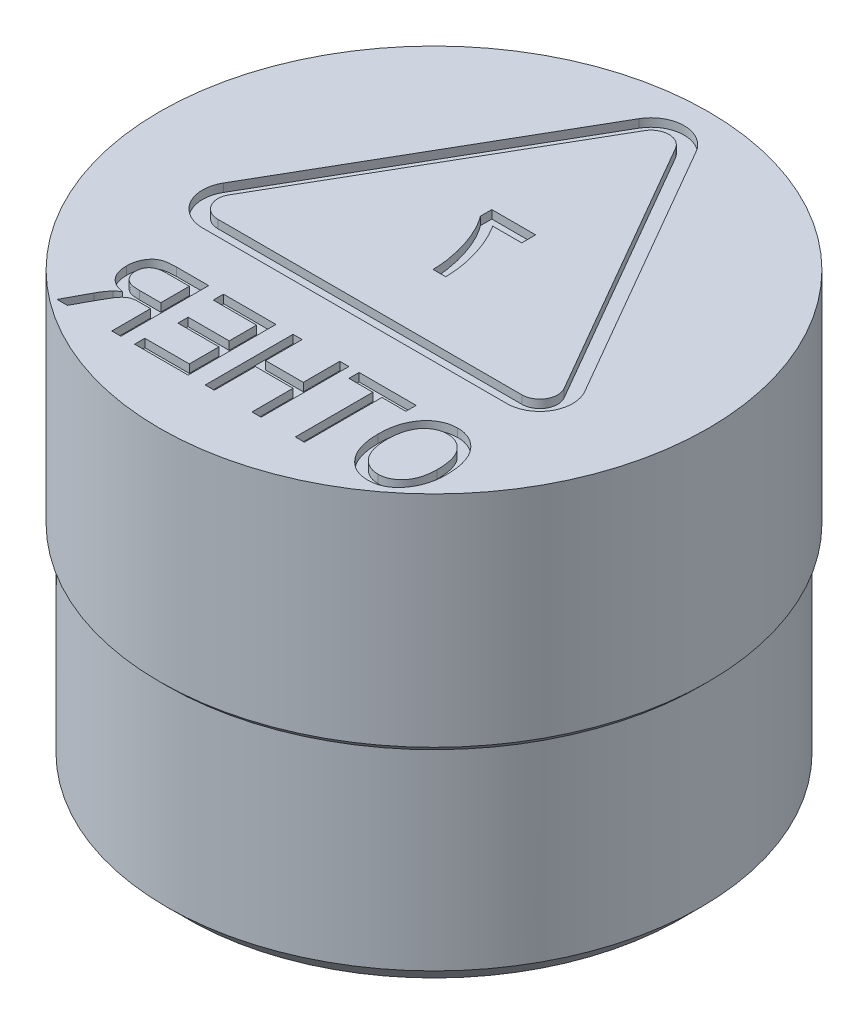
ISO-10303-21;
HEADER;
FILE_DESCRIPTION(('STEP AP214'),'2;1');
FILE_NAME('part.step','',(''),(''),'','','');
FILE_SCHEMA(('AUTOMOTIVE_DESIGN { 1 0 10303 214 1 1 1 1 }'));
ENDSEC;
DATA;
#1=APPLICATION_CONTEXT('core data for automotive mechanical design processes');
#2=APPLICATION_PROTOCOL_DEFINITION('international standard','automotive_design',2000,#1);
#3=PRODUCT_CONTEXT('',#1,'mechanical');
#4=PRODUCT('Part','Part','',(#3));
#5=PRODUCT_RELATED_PRODUCT_CATEGORY('part','',(#4));
#6=PRODUCT_DEFINITION_FORMATION('','',#4);
#7=PRODUCT_DEFINITION_CONTEXT('part definition',#1,'design');
#8=PRODUCT_DEFINITION('design','',#6,#7);
#9=PRODUCT_DEFINITION_SHAPE('','',#8);
#10=(LENGTH_UNIT() NAMED_UNIT(*) SI_UNIT(.MILLI.,.METRE.));
#11=(NAMED_UNIT(*) PLANE_ANGLE_UNIT() SI_UNIT($,.RADIAN.));
#12=(NAMED_UNIT(*) SI_UNIT($,.STERADIAN.) SOLID_ANGLE_UNIT());
#13=UNCERTAINTY_MEASURE_WITH_UNIT(LENGTH_MEASURE(1.E-05),#10,'distance_accuracy_value','');
#14=(GEOMETRIC_REPRESENTATION_CONTEXT(3) GLOBAL_UNCERTAINTY_ASSIGNED_CONTEXT((#13)) GLOBAL_UNIT_ASSIGNED_CONTEXT((#10,
#11,#12)) REPRESENTATION_CONTEXT('',''));
#15=CARTESIAN_POINT('',(0.,0.,0.));
#16=DIRECTION('',(0.,0.,1.));
#17=DIRECTION('',(1.,0.,0.));
#18=AXIS2_PLACEMENT_3D('',#15,#16,#17);
#19=CARTESIAN_POINT('',(0.,16.,0.));
#20=DIRECTION('',(0.,1.,0.));
#21=DIRECTION('',(0.,0.,1.));
#22=AXIS2_PLACEMENT_3D('',#19,#20,#21);
#23=PLANE('',#22);
#24=DIRECTION('',(1.,0.,0.));
#25=VECTOR('',#24,1.);
#26=CARTESIAN_POINT('',(-3.94675324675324,16.,7.8));
#27=LINE('',#26,#25);
#28=CARTESIAN_POINT('',(-3.94675324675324,16.,7.8));
#29=VERTEX_POINT('',#28);
#30=CARTESIAN_POINT('',(-3.61428571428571,16.,7.8));
#31=VERTEX_POINT('',#30);
#32=EDGE_CURVE('E51',#29,#31,#27,.T.);
#33=ORIENTED_EDGE('',*,*,#32,.F.);
#34=DIRECTION('',(0.,0.,1.));
#35=VECTOR('',#34,1.);
#36=CARTESIAN_POINT('',(-3.94675324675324,16.,6.38701298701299));
#37=LINE('',#36,#35);
#38=CARTESIAN_POINT('',(-3.94675324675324,16.,6.38701298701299));
#39=VERTEX_POINT('',#38);
#40=EDGE_CURVE('E683',#39,#29,#37,.T.);
#41=ORIENTED_EDGE('',*,*,#40,.F.);
#42=DIRECTION('',(1.,0.,0.));
#43=VECTOR('',#42,1.);
#44=CARTESIAN_POINT('',(-4.37077922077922,16.,6.38701298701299));
#45=LINE('',#44,#43);
#46=CARTESIAN_POINT('',(-4.37077922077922,16.,6.38701298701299));
#47=VERTEX_POINT('',#46);
#48=EDGE_CURVE('E677',#47,#39,#45,.T.);
#49=ORIENTED_EDGE('',*,*,#48,.F.);
#50=CARTESIAN_POINT('',(-5.19415584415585,16.,7.11558441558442));
#51=CARTESIAN_POINT('',(-5.17694376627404,16.,7.08349306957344));
#52=CARTESIAN_POINT('',(-5.14402117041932,16.,7.02210998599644));
#53=CARTESIAN_POINT('',(-5.09516062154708,16.,6.93495505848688));
#54=CARTESIAN_POINT('',(-5.04974132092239,16.,6.85635422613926));
#55=CARTESIAN_POINT('',(-5.00783997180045,16.,6.78623083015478));
#56=CARTESIAN_POINT('',(-4.96883561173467,16.,6.72532880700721));
#57=CARTESIAN_POINT('',(-4.9338040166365,16.,6.67281127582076));
#58=CARTESIAN_POINT('',(-4.90172158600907,16.,6.62927630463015));
#59=CARTESIAN_POINT('',(-4.86332399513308,16.,6.58442213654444));
#60=CARTESIAN_POINT('',(-4.81869303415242,16.,6.53792620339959));
#61=CARTESIAN_POINT('',(-4.76563767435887,16.,6.4912297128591));
#62=CARTESIAN_POINT('',(-4.71264393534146,16.,6.45502964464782));
#63=CARTESIAN_POINT('',(-4.65868904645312,16.,6.42746212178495));
#64=CARTESIAN_POINT('',(-4.59929630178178,16.,6.40930145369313));
#65=CARTESIAN_POINT('',(-4.53237236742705,16.,6.39570796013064));
#66=CARTESIAN_POINT('',(-4.45492369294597,16.,6.388314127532));
#67=CARTESIAN_POINT('',(-4.40001435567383,16.,6.38746505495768));
#68=CARTESIAN_POINT('',(-4.37077922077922,16.,6.38701298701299));
#69=B_SPLINE_CURVE_WITH_KNOTS('',3,(#50,#51,#52,#53,#54,#55,#56,#57,#58,#59,#60,#61,#62,#63,#64,
#65,#66,#67,#68),.UNSPECIFIED.,.F.,.F.,(4,1,1,1,1,1,1,1,1,1,1,1,1,1,1,1,4),(0.,
0.0927277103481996,0.177365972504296,0.254413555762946,0.323889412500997,0.38535414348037,
0.438552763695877,0.484630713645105,0.522951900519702,0.588827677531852,0.648611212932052,
0.702575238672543,0.751873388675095,0.802247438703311,0.860185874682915,0.925559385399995,1.),.UNSPECIFIED.);
#70=CARTESIAN_POINT('',(-5.19415584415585,16.,7.11558441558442));
#71=VERTEX_POINT('',#70);
#72=EDGE_CURVE('E672',#71,#47,#69,.T.);
#73=ORIENTED_EDGE('',*,*,#72,.F.);
#74=DIRECTION('',(0.475045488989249,0.,-0.879961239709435));
#75=VECTOR('',#74,1.);
#76=CARTESIAN_POINT('',(-5.56363636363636,16.,7.8));
#77=LINE('',#76,#75);
#78=CARTESIAN_POINT('',(-5.56363636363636,16.,7.8));
#79=VERTEX_POINT('',#78);
#80=EDGE_CURVE('E669',#79,#71,#77,.T.);
#81=ORIENTED_EDGE('',*,*,#80,.F.);
#82=DIRECTION('',(1.,0.,0.));
#83=VECTOR('',#82,1.);
#84=CARTESIAN_POINT('',(-5.94155844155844,16.,7.8));
#85=LINE('',#84,#83);
#86=CARTESIAN_POINT('',(-5.94155844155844,16.,7.8));
#87=VERTEX_POINT('',#86);
#88=EDGE_CURVE('E666',#87,#79,#85,.T.);
#89=ORIENTED_EDGE('',*,*,#88,.F.);
#90=DIRECTION('',(-0.471912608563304,0.,0.881645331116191));
#91=VECTOR('',#90,1.);
#92=CARTESIAN_POINT('',(-5.47337662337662,16.,6.92532467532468));
#93=LINE('',#92,#91);
#94=CARTESIAN_POINT('',(-5.47337662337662,16.,6.92532467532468));
#95=VERTEX_POINT('',#94);
#96=EDGE_CURVE('E660',#95,#87,#93,.T.);
#97=ORIENTED_EDGE('',*,*,#96,.F.);
#98=CARTESIAN_POINT('',(-5.19480519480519,16.,6.51558441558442));
#99=CARTESIAN_POINT('',(-5.22073632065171,16.,6.54688432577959));
#100=CARTESIAN_POINT('',(-5.27289016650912,16.,6.60983611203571));
#101=CARTESIAN_POINT('',(-5.34438479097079,16.,6.71026779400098));
#102=CARTESIAN_POINT('',(-5.4128672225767,16.,6.81474483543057));
#103=CARTESIAN_POINT('',(-5.45308333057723,16.,6.8882390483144));
#104=CARTESIAN_POINT('',(-5.47337662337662,16.,6.92532467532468));
#105=B_SPLINE_CURVE_WITH_KNOTS('',3,(#98,#99,#100,#101,#102,#103,#104),.UNSPECIFIED.,.F.,.F.,(4,
1,1,1,4),(0.,0.245563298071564,0.493887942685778,0.74461277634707,1.),.UNSPECIFIED.);
#106=CARTESIAN_POINT('',(-5.19480519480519,16.,6.51558441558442));
#107=VERTEX_POINT('',#106);
#108=EDGE_CURVE('E652',#107,#95,#105,.T.);
#109=ORIENTED_EDGE('',*,*,#108,.F.);
#110=CARTESIAN_POINT('',(-4.98571428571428,16.,6.36623376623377));
#111=CARTESIAN_POINT('',(-5.00752112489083,16.,6.37829896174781));
#112=CARTESIAN_POINT('',(-5.0490328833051,16.,6.40126641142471));
#113=CARTESIAN_POINT('',(-5.10584323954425,16.,6.43832219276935));
#114=CARTESIAN_POINT('',(-5.15439420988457,16.,6.47562066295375));
#115=CARTESIAN_POINT('',(-5.1818405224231,16.,6.50276322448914));
#116=CARTESIAN_POINT('',(-5.19480519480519,16.,6.51558441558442));
#117=B_SPLINE_CURVE_WITH_KNOTS('',3,(#110,#111,#112,#113,#114,#115,#116),.UNSPECIFIED.,.F.,.F.,
(4,1,1,1,4),(0.,0.28971077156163,0.551496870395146,0.788142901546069,1.),.UNSPECIFIED.);
#118=CARTESIAN_POINT('',(-4.98571428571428,16.,6.36623376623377));
#119=VERTEX_POINT('',#118);
#120=EDGE_CURVE('E644',#119,#107,#117,.T.);
#121=ORIENTED_EDGE('',*,*,#120,.F.);
#122=CARTESIAN_POINT('',(-5.73376623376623,16.,5.48181818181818));
#123=CARTESIAN_POINT('',(-5.73305980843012,16.,5.51170746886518));
#124=CARTESIAN_POINT('',(-5.73167993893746,16.,5.57009058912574));
#125=CARTESIAN_POINT('',(-5.7233210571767,16.,5.65566117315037));
#126=CARTESIAN_POINT('',(-5.70879525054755,16.,5.73682936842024));
#127=CARTESIAN_POINT('',(-5.68658052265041,16.,5.81338514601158));
#128=CARTESIAN_POINT('',(-5.66081688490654,16.,5.88627983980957));
#129=CARTESIAN_POINT('',(-5.62698591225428,16.,5.95423564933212));
#130=CARTESIAN_POINT('',(-5.58817131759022,16.,6.01813022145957));
#131=CARTESIAN_POINT('',(-5.54305774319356,16.,6.07745570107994));
#132=CARTESIAN_POINT('',(-5.49259655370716,16.,6.13207979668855));
#133=CARTESIAN_POINT('',(-5.435964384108,16.,6.18114388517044));
#134=CARTESIAN_POINT('',(-5.37426239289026,16.,6.22534465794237));
#135=CARTESIAN_POINT('',(-5.30700947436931,16.,6.2642940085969));
#136=CARTESIAN_POINT('',(-5.23462185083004,16.,6.29849049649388));
#137=CARTESIAN_POINT('',(-5.15624327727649,16.,6.32577784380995));
#138=CARTESIAN_POINT('',(-5.07309530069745,16.,6.34967408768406));
#139=CARTESIAN_POINT('',(-5.01525877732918,16.,6.36063475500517));
#140=CARTESIAN_POINT('',(-4.98571428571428,16.,6.36623376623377));
#141=B_SPLINE_CURVE_WITH_KNOTS('',3,(#122,#123,#124,#125,#126,#127,#128,#129,#130,#131,#132,
#133,#134,#135,#136,#137,#138,#139,#140),.UNSPECIFIED.,.F.,.F.,(4,1,1,1,1,1,1,1,1,1,1,1,1,1,1,1,
4),(0.,0.0701236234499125,0.136973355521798,0.20151505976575,0.263246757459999,
0.323812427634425,0.382632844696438,0.440984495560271,0.498977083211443,0.557187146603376,
0.615133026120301,0.674459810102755,0.734991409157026,0.797236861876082,0.861968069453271,
0.929489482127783,1.),.UNSPECIFIED.);
#142=CARTESIAN_POINT('',(-5.73376623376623,16.,5.48181818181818));
#143=VERTEX_POINT('',#142);
#144=EDGE_CURVE('E636',#143,#119,#141,.T.);
#145=ORIENTED_EDGE('',*,*,#144,.F.);
#146=CARTESIAN_POINT('',(-4.78961038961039,16.,4.6));
#147=CARTESIAN_POINT('',(-4.81927102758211,16.,4.60017073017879));
#148=CARTESIAN_POINT('',(-4.8766822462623,16.,4.60050119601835));
#149=CARTESIAN_POINT('',(-4.95985071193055,16.,4.60525513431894));
#150=CARTESIAN_POINT('',(-5.03718438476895,16.,4.61229246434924));
#151=CARTESIAN_POINT('',(-5.10858023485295,16.,4.62164937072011));
#152=CARTESIAN_POINT('',(-5.17362147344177,16.,4.63462174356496));
#153=CARTESIAN_POINT('',(-5.23256603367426,16.,4.65035816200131));
#154=CARTESIAN_POINT('',(-5.28589345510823,16.,4.66792329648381));
#155=CARTESIAN_POINT('',(-5.34849783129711,16.,4.69689714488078));
#156=CARTESIAN_POINT('',(-5.41992149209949,16.,4.74183845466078));
#157=CARTESIAN_POINT('',(-5.49695185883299,16.,4.8103088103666));
#158=CARTESIAN_POINT('',(-5.5644241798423,16.,4.8951005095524));
#159=CARTESIAN_POINT('',(-5.62446453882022,16.,4.99252282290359));
#160=CARTESIAN_POINT('',(-5.67377153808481,16.,5.10190501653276));
#161=CARTESIAN_POINT('',(-5.70869788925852,16.,5.22119294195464));
#162=CARTESIAN_POINT('',(-5.7297822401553,16.,5.34881930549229));
#163=CARTESIAN_POINT('',(-5.73241513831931,16.,5.43671414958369));
#164=CARTESIAN_POINT('',(-5.73376623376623,16.,5.48181818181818));
#165=B_SPLINE_CURVE_WITH_KNOTS('',3,(#146,#147,#148,#149,#150,#151,#152,#153,#154,#155,#156,
#157,#158,#159,#160,#161,#162,#163,#164),.UNSPECIFIED.,.F.,.F.,(4,1,1,1,1,1,1,1,1,1,1,1,1,1,1,1,
4),(0.,0.05986099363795,0.115867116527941,0.168079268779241,0.216582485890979,0.261137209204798,
0.301831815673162,0.339688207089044,0.374291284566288,0.440840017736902,0.509231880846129,
0.581286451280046,0.658766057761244,0.739723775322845,0.822664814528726,0.908998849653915,1.),.UNSPECIFIED.);
#166=CARTESIAN_POINT('',(-4.78961038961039,16.,4.6));
#167=VERTEX_POINT('',#166);
#168=EDGE_CURVE('E631',#167,#143,#165,.T.);
#169=ORIENTED_EDGE('',*,*,#168,.F.);
#170=DIRECTION('',(-1.,0.,0.));
#171=VECTOR('',#170,1.);
#172=CARTESIAN_POINT('',(-3.61428571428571,16.,4.6));
#173=LINE('',#172,#171);
#174=CARTESIAN_POINT('',(-3.61428571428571,16.,4.6));
#175=VERTEX_POINT('',#174);
#176=EDGE_CURVE('E628',#175,#167,#173,.T.);
#177=ORIENTED_EDGE('',*,*,#176,.F.);
#178=DIRECTION('',(0.,0.,-1.));
#179=VECTOR('',#178,1.);
#180=CARTESIAN_POINT('',(-3.61428571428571,16.,7.8));
#181=LINE('',#180,#179);
#182=EDGE_CURVE('E625',#31,#175,#181,.T.);
#183=ORIENTED_EDGE('',*,*,#182,.F.);
#184=EDGE_LOOP('',(#33,#41,#49,#73,#81,#89,#97,#109,#121,#145,#169,#177,#183));
#185=FACE_BOUND('',#184,.T.);
#186=DIRECTION('',(1.,0.,0.));
#187=VECTOR('',#186,1.);
#188=CARTESIAN_POINT('',(-3.11558441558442,16.,7.8));
#189=LINE('',#188,#187);
#190=CARTESIAN_POINT('',(-3.11558441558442,16.,7.8));
#191=VERTEX_POINT('',#190);
#192=CARTESIAN_POINT('',(-1.16233766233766,16.,7.8));
#193=VERTEX_POINT('',#192);
#194=EDGE_CURVE('E689',#191,#193,#189,.T.);
#195=ORIENTED_EDGE('',*,*,#194,.F.);
#196=DIRECTION('',(0.,0.,1.));
#197=VECTOR('',#196,1.);
#198=CARTESIAN_POINT('',(-3.11558441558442,16.,7.42597402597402));
#199=LINE('',#198,#197);
#200=CARTESIAN_POINT('',(-3.11558441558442,16.,7.42597402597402));
#201=VERTEX_POINT('',#200);
#202=EDGE_CURVE('E717',#201,#191,#199,.T.);
#203=ORIENTED_EDGE('',*,*,#202,.F.);
#204=DIRECTION('',(-1.,0.,0.));
#205=VECTOR('',#204,1.);
#206=CARTESIAN_POINT('',(-1.49480519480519,16.,7.42597402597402));
#207=LINE('',#206,#205);
#208=CARTESIAN_POINT('',(-1.49480519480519,16.,7.42597402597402));
#209=VERTEX_POINT('',#208);
#210=EDGE_CURVE('E779',#209,#201,#207,.T.);
#211=ORIENTED_EDGE('',*,*,#210,.F.);
#212=DIRECTION('',(0.,0.,1.));
#213=VECTOR('',#212,1.);
#214=CARTESIAN_POINT('',(-1.49480519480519,16.,6.34545454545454));
#215=LINE('',#214,#213);
#216=CARTESIAN_POINT('',(-1.49480519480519,16.,6.34545454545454));
#217=VERTEX_POINT('',#216);
#218=EDGE_CURVE('E776',#217,#209,#215,.T.);
#219=ORIENTED_EDGE('',*,*,#218,.F.);
#220=DIRECTION('',(1.,0.,0.));
#221=VECTOR('',#220,1.);
#222=CARTESIAN_POINT('',(-2.99090909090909,16.,6.34545454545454));
#223=LINE('',#222,#221);
#224=CARTESIAN_POINT('',(-2.99090909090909,16.,6.34545454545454));
#225=VERTEX_POINT('',#224);
#226=EDGE_CURVE('E773',#225,#217,#223,.T.);
#227=ORIENTED_EDGE('',*,*,#226,.F.);
#228=DIRECTION('',(0.,0.,1.));
#229=VECTOR('',#228,1.);
#230=CARTESIAN_POINT('',(-2.99090909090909,16.,5.97142857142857));
#231=LINE('',#230,#229);
#232=CARTESIAN_POINT('',(-2.99090909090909,16.,5.97142857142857));
#233=VERTEX_POINT('',#232);
#234=EDGE_CURVE('E770',#233,#225,#231,.T.);
#235=ORIENTED_EDGE('',*,*,#234,.F.);
#236=DIRECTION('',(-1.,0.,0.));
#237=VECTOR('',#236,1.);
#238=CARTESIAN_POINT('',(-1.49480519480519,16.,5.97142857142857));
#239=LINE('',#238,#237);
#240=CARTESIAN_POINT('',(-1.49480519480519,16.,5.97142857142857));
#241=VERTEX_POINT('',#240);
#242=EDGE_CURVE('E767',#241,#233,#239,.T.);
#243=ORIENTED_EDGE('',*,*,#242,.F.);
#244=DIRECTION('',(0.,0.,1.));
#245=VECTOR('',#244,1.);
#246=CARTESIAN_POINT('',(-1.49480519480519,16.,4.97402597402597));
#247=LINE('',#246,#245);
#248=CARTESIAN_POINT('',(-1.49480519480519,16.,4.97402597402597));
#249=VERTEX_POINT('',#248);
#250=EDGE_CURVE('E764',#249,#241,#247,.T.);
#251=ORIENTED_EDGE('',*,*,#250,.F.);
#252=DIRECTION('',(1.,0.,0.));
#253=VECTOR('',#252,1.);
#254=CARTESIAN_POINT('',(-3.07402597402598,16.,4.97402597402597));
#255=LINE('',#254,#253);
#256=CARTESIAN_POINT('',(-3.07402597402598,16.,4.97402597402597));
#257=VERTEX_POINT('',#256);
#258=EDGE_CURVE('E761',#257,#249,#255,.T.);
#259=ORIENTED_EDGE('',*,*,#258,.F.);
#260=DIRECTION('',(0.,0.,1.));
#261=VECTOR('',#260,1.);
#262=CARTESIAN_POINT('',(-3.07402597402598,16.,4.6));
#263=LINE('',#262,#261);
#264=CARTESIAN_POINT('',(-3.07402597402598,16.,4.6));
#265=VERTEX_POINT('',#264);
#266=EDGE_CURVE('E758',#265,#257,#263,.T.);
#267=ORIENTED_EDGE('',*,*,#266,.F.);
#268=DIRECTION('',(-1.,0.,0.));
#269=VECTOR('',#268,1.);
#270=CARTESIAN_POINT('',(-1.16233766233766,16.,4.6));
#271=LINE('',#270,#269);
#272=CARTESIAN_POINT('',(-1.16233766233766,16.,4.6));
#273=VERTEX_POINT('',#272);
#274=EDGE_CURVE('E755',#273,#265,#271,.T.);
#275=ORIENTED_EDGE('',*,*,#274,.F.);
#276=DIRECTION('',(0.,0.,-1.));
#277=VECTOR('',#276,1.);
#278=CARTESIAN_POINT('',(-1.16233766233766,16.,7.8));
#279=LINE('',#278,#277);
#280=EDGE_CURVE('E752',#193,#273,#279,.T.);
#281=ORIENTED_EDGE('',*,*,#280,.F.);
#282=EDGE_LOOP('',(#195,#203,#211,#219,#227,#235,#243,#251,#259,#267,#275,#281));
#283=FACE_BOUND('',#282,.T.);
#284=DIRECTION('',(1.,0.,0.));
#285=VECTOR('',#284,1.);
#286=CARTESIAN_POINT('',(1.16493506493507,16.,7.8));
#287=LINE('',#286,#285);
#288=CARTESIAN_POINT('',(1.16493506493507,16.,7.8));
#289=VERTEX_POINT('',#288);
#290=CARTESIAN_POINT('',(1.4974025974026,16.,7.8));
#291=VERTEX_POINT('',#290);
#292=EDGE_CURVE('E786',#289,#291,#287,.T.);
#293=ORIENTED_EDGE('',*,*,#292,.F.);
#294=DIRECTION('',(0.,0.,1.));
#295=VECTOR('',#294,1.);
#296=CARTESIAN_POINT('',(1.16493506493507,16.,6.3038961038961));
#297=LINE('',#296,#295);
#298=CARTESIAN_POINT('',(1.16493506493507,16.,6.3038961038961));
#299=VERTEX_POINT('',#298);
#300=EDGE_CURVE('E813',#299,#289,#297,.T.);
#301=ORIENTED_EDGE('',*,*,#300,.F.);
#302=DIRECTION('',(1.,0.,0.));
#303=VECTOR('',#302,1.);
#304=CARTESIAN_POINT('',(-0.206493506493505,16.,6.3038961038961));
#305=LINE('',#304,#303);
#306=CARTESIAN_POINT('',(-0.206493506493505,16.,6.3038961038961));
#307=VERTEX_POINT('',#306);
#308=EDGE_CURVE('E875',#307,#299,#305,.T.);
#309=ORIENTED_EDGE('',*,*,#308,.F.);
#310=DIRECTION('',(0.,0.,-1.));
#311=VECTOR('',#310,1.);
#312=CARTESIAN_POINT('',(-0.206493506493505,16.,7.8));
#313=LINE('',#312,#311);
#314=CARTESIAN_POINT('',(-0.206493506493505,16.,7.8));
#315=VERTEX_POINT('',#314);
#316=EDGE_CURVE('E872',#315,#307,#313,.T.);
#317=ORIENTED_EDGE('',*,*,#316,.F.);
#318=DIRECTION('',(1.,0.,0.));
#319=VECTOR('',#318,1.);
#320=CARTESIAN_POINT('',(-0.538961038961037,16.,7.8));
#321=LINE('',#320,#319);
#322=CARTESIAN_POINT('',(-0.538961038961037,16.,7.8));
#323=VERTEX_POINT('',#322);
#324=EDGE_CURVE('E869',#323,#315,#321,.T.);
#325=ORIENTED_EDGE('',*,*,#324,.F.);
#326=DIRECTION('',(0.,0.,1.));
#327=VECTOR('',#326,1.);
#328=CARTESIAN_POINT('',(-0.538961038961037,16.,4.6));
#329=LINE('',#328,#327);
#330=CARTESIAN_POINT('',(-0.538961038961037,16.,4.6));
#331=VERTEX_POINT('',#330);
#332=EDGE_CURVE('E866',#331,#323,#329,.T.);
#333=ORIENTED_EDGE('',*,*,#332,.F.);
#334=DIRECTION('',(-1.,0.,0.));
#335=VECTOR('',#334,1.);
#336=CARTESIAN_POINT('',(-0.206493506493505,16.,4.6));
#337=LINE('',#336,#335);
#338=CARTESIAN_POINT('',(-0.206493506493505,16.,4.6));
#339=VERTEX_POINT('',#338);
#340=EDGE_CURVE('E863',#339,#331,#337,.T.);
#341=ORIENTED_EDGE('',*,*,#340,.F.);
#342=DIRECTION('',(0.,0.,-1.));
#343=VECTOR('',#342,1.);
#344=CARTESIAN_POINT('',(-0.206493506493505,16.,5.92987012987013));
#345=LINE('',#344,#343);
#346=CARTESIAN_POINT('',(-0.206493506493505,16.,5.92987012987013));
#347=VERTEX_POINT('',#346);
#348=EDGE_CURVE('E860',#347,#339,#345,.T.);
#349=ORIENTED_EDGE('',*,*,#348,.F.);
#350=DIRECTION('',(-1.,0.,0.));
#351=VECTOR('',#350,1.);
#352=CARTESIAN_POINT('',(1.16493506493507,16.,5.92987012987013));
#353=LINE('',#352,#351);
#354=CARTESIAN_POINT('',(1.16493506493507,16.,5.92987012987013));
#355=VERTEX_POINT('',#354);
#356=EDGE_CURVE('E857',#355,#347,#353,.T.);
#357=ORIENTED_EDGE('',*,*,#356,.F.);
#358=DIRECTION('',(0.,0.,1.));
#359=VECTOR('',#358,1.);
#360=CARTESIAN_POINT('',(1.16493506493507,16.,4.6));
#361=LINE('',#360,#359);
#362=CARTESIAN_POINT('',(1.16493506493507,16.,4.6));
#363=VERTEX_POINT('',#362);
#364=EDGE_CURVE('E854',#363,#355,#361,.T.);
#365=ORIENTED_EDGE('',*,*,#364,.F.);
#366=DIRECTION('',(-1.,0.,0.));
#367=VECTOR('',#366,1.);
#368=CARTESIAN_POINT('',(1.4974025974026,16.,4.6));
#369=LINE('',#368,#367);
#370=CARTESIAN_POINT('',(1.4974025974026,16.,4.6));
#371=VERTEX_POINT('',#370);
#372=EDGE_CURVE('E851',#371,#363,#369,.T.);
#373=ORIENTED_EDGE('',*,*,#372,.F.);
#374=DIRECTION('',(0.,0.,-1.));
#375=VECTOR('',#374,1.);
#376=CARTESIAN_POINT('',(1.4974025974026,16.,7.8));
#377=LINE('',#376,#375);
#378=EDGE_CURVE('E848',#291,#371,#377,.T.);
#379=ORIENTED_EDGE('',*,*,#378,.F.);
#380=EDGE_LOOP('',(#293,#301,#309,#317,#325,#333,#341,#349,#357,#365,#373,#379));
#381=FACE_BOUND('',#380,.T.);
#382=DIRECTION('',(1.,0.,0.));
#383=VECTOR('',#382,1.);
#384=CARTESIAN_POINT('',(2.74415584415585,16.,7.8));
#385=LINE('',#384,#383);
#386=CARTESIAN_POINT('',(2.74415584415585,16.,7.8));
#387=VERTEX_POINT('',#386);
#388=CARTESIAN_POINT('',(3.07662337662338,16.,7.8));
#389=VERTEX_POINT('',#388);
#390=EDGE_CURVE('E882',#387,#389,#385,.T.);
#391=ORIENTED_EDGE('',*,*,#390,.F.);
#392=DIRECTION('',(0.,0.,1.));
#393=VECTOR('',#392,1.);
#394=CARTESIAN_POINT('',(2.74415584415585,16.,4.97402597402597));
#395=LINE('',#394,#393);
#396=CARTESIAN_POINT('',(2.74415584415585,16.,4.97402597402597));
#397=VERTEX_POINT('',#396);
#398=EDGE_CURVE('E909',#397,#387,#395,.T.);
#399=ORIENTED_EDGE('',*,*,#398,.F.);
#400=DIRECTION('',(1.,0.,0.));
#401=VECTOR('',#400,1.);
#402=CARTESIAN_POINT('',(1.87142857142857,16.,4.97402597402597));
#403=LINE('',#402,#401);
#404=CARTESIAN_POINT('',(1.87142857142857,16.,4.97402597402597));
#405=VERTEX_POINT('',#404);
#406=EDGE_CURVE('E947',#405,#397,#403,.T.);
#407=ORIENTED_EDGE('',*,*,#406,.F.);
#408=DIRECTION('',(0.,0.,1.));
#409=VECTOR('',#408,1.);
#410=CARTESIAN_POINT('',(1.87142857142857,16.,4.6));
#411=LINE('',#410,#409);
#412=CARTESIAN_POINT('',(1.87142857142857,16.,4.6));
#413=VERTEX_POINT('',#412);
#414=EDGE_CURVE('E944',#413,#405,#411,.T.);
#415=ORIENTED_EDGE('',*,*,#414,.F.);
#416=DIRECTION('',(-1.,0.,0.));
#417=VECTOR('',#416,1.);
#418=CARTESIAN_POINT('',(3.94935064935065,16.,4.6));
#419=LINE('',#418,#417);
#420=CARTESIAN_POINT('',(3.94935064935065,16.,4.6));
#421=VERTEX_POINT('',#420);
#422=EDGE_CURVE('E941',#421,#413,#419,.T.);
#423=ORIENTED_EDGE('',*,*,#422,.F.);
#424=DIRECTION('',(0.,0.,-1.));
#425=VECTOR('',#424,1.);
#426=CARTESIAN_POINT('',(3.94935064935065,16.,4.97402597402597));
#427=LINE('',#426,#425);
#428=CARTESIAN_POINT('',(3.94935064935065,16.,4.97402597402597));
#429=VERTEX_POINT('',#428);
#430=EDGE_CURVE('E938',#429,#421,#427,.T.);
#431=ORIENTED_EDGE('',*,*,#430,.F.);
#432=DIRECTION('',(1.,0.,0.));
#433=VECTOR('',#432,1.);
#434=CARTESIAN_POINT('',(3.07662337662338,16.,4.97402597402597));
#435=LINE('',#434,#433);
#436=CARTESIAN_POINT('',(3.07662337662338,16.,4.97402597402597));
#437=VERTEX_POINT('',#436);
#438=EDGE_CURVE('E935',#437,#429,#435,.T.);
#439=ORIENTED_EDGE('',*,*,#438,.F.);
#440=DIRECTION('',(0.,0.,-1.));
#441=VECTOR('',#440,1.);
#442=CARTESIAN_POINT('',(3.07662337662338,16.,7.8));
#443=LINE('',#442,#441);
#444=EDGE_CURVE('E932',#389,#437,#443,.T.);
#445=ORIENTED_EDGE('',*,*,#444,.F.);
#446=EDGE_LOOP('',(#391,#399,#407,#415,#423,#431,#439,#445));
#447=FACE_BOUND('',#446,.T.);
#448=CARTESIAN_POINT('',(6.36818181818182,16.,7.33961038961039));
#449=CARTESIAN_POINT('',(6.39420861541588,16.,7.30108127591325));
#450=CARTESIAN_POINT('',(6.44610815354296,16.,7.22425110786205));
#451=CARTESIAN_POINT('',(6.51157922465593,16.,7.1009281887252));
#452=CARTESIAN_POINT('',(6.56773711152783,16.,6.97229525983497));
#453=CARTESIAN_POINT('',(6.61286579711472,16.,6.83742940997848));
#454=CARTESIAN_POINT('',(6.64902883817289,16.,6.69711481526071));
#455=CARTESIAN_POINT('',(6.67400949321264,16.,6.5507317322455));
#456=CARTESIAN_POINT('',(6.68918213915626,16.,6.3983738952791));
#457=CARTESIAN_POINT('',(6.69118805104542,16.,6.2948407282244));
#458=CARTESIAN_POINT('',(6.69220779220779,16.,6.24220779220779));
#459=B_SPLINE_CURVE_WITH_KNOTS('',3,(#448,#449,#450,#451,#452,#453,#454,#455,#456,#457,#458),
.UNSPECIFIED.,.F.,.F.,(4,1,1,1,1,1,1,1,4),(0.,0.119866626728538,0.239023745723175,
0.359553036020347,0.481559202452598,0.605468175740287,0.732968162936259,0.864249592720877,1.),.UNSPECIFIED.);
#460=CARTESIAN_POINT('',(6.36818181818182,16.,7.33961038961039));
#461=VERTEX_POINT('',#460);
#462=CARTESIAN_POINT('',(6.69220779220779,16.,6.24220779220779));
#463=VERTEX_POINT('',#462);
#464=EDGE_CURVE('E1018',#461,#463,#459,.T.);
#465=ORIENTED_EDGE('',*,*,#464,.F.);
#466=CARTESIAN_POINT('',(5.42467532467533,16.,7.84155844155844));
#467=CARTESIAN_POINT('',(5.47239020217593,16.,7.8401140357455));
#468=CARTESIAN_POINT('',(5.56603347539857,16.,7.83727930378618));
#469=CARTESIAN_POINT('',(5.70311190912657,16.,7.81334432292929));
#470=CARTESIAN_POINT('',(5.83277466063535,16.,7.77358216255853));
#471=CARTESIAN_POINT('',(5.95572143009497,16.,7.7187455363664));
#472=CARTESIAN_POINT('',(6.07070244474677,16.,7.64711631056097));
#473=CARTESIAN_POINT('',(6.17834170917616,16.,7.55987587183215));
#474=CARTESIAN_POINT('',(6.27932393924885,16.,7.45745371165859));
#475=CARTESIAN_POINT('',(6.33809504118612,16.,7.37951147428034));
#476=CARTESIAN_POINT('',(6.36818181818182,16.,7.33961038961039));
#477=B_SPLINE_CURVE_WITH_KNOTS('',3,(#466,#467,#468,#469,#470,#471,#472,#473,#474,#475,#476),
.UNSPECIFIED.,.F.,.F.,(4,1,1,1,1,1,1,1,4),(0.,0.128464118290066,0.252118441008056,
0.373476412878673,0.49300393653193,0.613708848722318,0.737276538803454,0.865503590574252,1.),.UNSPECIFIED.);
#478=CARTESIAN_POINT('',(5.42467532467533,16.,7.84155844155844));
#479=VERTEX_POINT('',#478);
#480=EDGE_CURVE('E1058',#479,#461,#477,.T.);
#481=ORIENTED_EDGE('',*,*,#480,.F.);
#482=CARTESIAN_POINT('',(4.48311688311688,16.,7.3525974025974));
#483=CARTESIAN_POINT('',(4.51348993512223,16.,7.3913752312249));
#484=CARTESIAN_POINT('',(4.57285767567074,16.,7.46717110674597));
#485=CARTESIAN_POINT('',(4.67383455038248,16.,7.56738668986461));
#486=CARTESIAN_POINT('',(4.78179631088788,16.,7.65201459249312));
#487=CARTESIAN_POINT('',(4.89655073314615,16.,7.72217261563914));
#488=CARTESIAN_POINT('',(5.01889289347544,16.,7.77530956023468));
#489=CARTESIAN_POINT('',(5.1478498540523,16.,7.8140052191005));
#490=CARTESIAN_POINT('',(5.28401952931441,16.,7.83712579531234));
#491=CARTESIAN_POINT('',(5.37718345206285,16.,7.84006177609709));
#492=CARTESIAN_POINT('',(5.42467532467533,16.,7.84155844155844));
#493=B_SPLINE_CURVE_WITH_KNOTS('',3,(#482,#483,#484,#485,#486,#487,#488,#489,#490,#491,#492),
.UNSPECIFIED.,.F.,.F.,(4,1,1,1,1,1,1,1,4),(0.,0.13376490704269,0.261459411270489,
0.385485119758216,0.505836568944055,0.62594627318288,0.746912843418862,0.87098457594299,1.),.UNSPECIFIED.);
#494=CARTESIAN_POINT('',(4.48311688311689,16.,7.3525974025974));
#495=VERTEX_POINT('',#494);
#496=EDGE_CURVE('E1050',#495,#479,#493,.T.);
#497=ORIENTED_EDGE('',*,*,#496,.F.);
#498=CARTESIAN_POINT('',(4.15714285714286,16.,6.20324675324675));
#499=CARTESIAN_POINT('',(4.15818768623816,16.,6.26063261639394));
#500=CARTESIAN_POINT('',(4.16023368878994,16.,6.37300661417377));
#501=CARTESIAN_POINT('',(4.17484174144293,16.,6.53759694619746));
#502=CARTESIAN_POINT('',(4.20140703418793,16.,6.69382525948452));
#503=CARTESIAN_POINT('',(4.23556241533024,16.,6.84249053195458));
#504=CARTESIAN_POINT('',(4.28207571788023,16.,6.98242907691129));
#505=CARTESIAN_POINT('',(4.33807457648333,16.,7.11434819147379));
#506=CARTESIAN_POINT('',(4.40376809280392,16.,7.23862593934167));
#507=CARTESIAN_POINT('',(4.45678776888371,16.,7.31477996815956));
#508=CARTESIAN_POINT('',(4.48311688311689,16.,7.3525974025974));
#509=B_SPLINE_CURVE_WITH_KNOTS('',3,(#498,#499,#500,#501,#502,#503,#504,#505,#506,#507,#508),
.UNSPECIFIED.,.F.,.F.,(4,1,1,1,1,1,1,1,4),(0.,0.141690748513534,0.277461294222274,
0.407495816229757,0.532718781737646,0.653726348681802,0.771059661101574,0.886310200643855,1.),.UNSPECIFIED.);
#510=CARTESIAN_POINT('',(4.15714285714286,16.,6.20324675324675));
#511=VERTEX_POINT('',#510);
#512=EDGE_CURVE('E1042',#511,#495,#509,.T.);
#513=ORIENTED_EDGE('',*,*,#512,.F.);
#514=CARTESIAN_POINT('',(5.42272727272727,16.,4.55844155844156));
#515=CARTESIAN_POINT('',(5.3936964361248,16.,4.55908437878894));
#516=CARTESIAN_POINT('',(5.33635820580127,16.,4.56035400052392));
#517=CARTESIAN_POINT('',(5.25132703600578,16.,4.56991486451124));
#518=CARTESIAN_POINT('',(5.16826853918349,16.,4.58436586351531));
#519=CARTESIAN_POINT('',(5.08725529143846,16.,4.60635153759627));
#520=CARTESIAN_POINT('',(5.00784409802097,16.,4.63336000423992));
#521=CARTESIAN_POINT('',(4.9306260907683,16.,4.6672386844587));
#522=CARTESIAN_POINT('',(4.85554849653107,16.,4.70733571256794));
#523=CARTESIAN_POINT('',(4.78230553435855,16.,4.75237621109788));
#524=CARTESIAN_POINT('',(4.71202021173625,16.,4.80391311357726));
#525=CARTESIAN_POINT('',(4.64524043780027,16.,4.86106438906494));
#526=CARTESIAN_POINT('',(4.5818701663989,16.,4.92359558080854));
#527=CARTESIAN_POINT('',(4.52291981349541,16.,4.99200095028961));
#528=CARTESIAN_POINT('',(4.46740711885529,16.,5.06563037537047));
#529=CARTESIAN_POINT('',(4.41625718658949,16.,5.14499203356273));
#530=CARTESIAN_POINT('',(4.3687706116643,16.,5.22988775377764));
#531=CARTESIAN_POINT('',(4.32473544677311,16.,5.31974826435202));
#532=CARTESIAN_POINT('',(4.28510197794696,16.,5.41465296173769));
#533=CARTESIAN_POINT('',(4.25046241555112,16.,5.51409506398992));
#534=CARTESIAN_POINT('',(4.22239085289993,16.,5.6184286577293));
#535=CARTESIAN_POINT('',(4.19794645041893,16.,5.72663106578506));
#536=CARTESIAN_POINT('',(4.18025523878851,16.,5.83971288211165));
#537=CARTESIAN_POINT('',(4.16633272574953,16.,5.95685159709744));
#538=CARTESIAN_POINT('',(4.15862869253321,16.,6.07868362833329));
#539=CARTESIAN_POINT('',(4.15764386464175,16.,6.16124542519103));
#540=CARTESIAN_POINT('',(4.15714285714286,16.,6.20324675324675));
#541=B_SPLINE_CURVE_WITH_KNOTS('',3,(#514,#515,#516,#517,#518,#519,#520,#521,#522,#523,#524,
#525,#526,#527,#528,#529,#530,#531,#532,#533,#534,#535,#536,#537,#538,#539,#540),.UNSPECIFIED.,
.F.,.F.,(4,1,1,1,1,1,1,1,1,1,1,1,1,1,1,1,1,1,1,1,1,1,1,1,4),(0.,0.0374926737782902,
0.074051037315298,0.110413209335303,0.146290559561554,0.182366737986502,0.21867727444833,
0.255074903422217,0.292240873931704,0.329654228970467,0.367532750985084,0.405690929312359,
0.444540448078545,0.48407613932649,0.52471465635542,0.566401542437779,0.609667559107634,
0.653909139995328,0.699182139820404,0.745579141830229,0.793404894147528,0.842405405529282,
0.893352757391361,0.945745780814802,1.),.UNSPECIFIED.);
#542=CARTESIAN_POINT('',(5.42272727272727,16.,4.55844155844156));
#543=VERTEX_POINT('',#542);
#544=EDGE_CURVE('E1034',#543,#511,#541,.T.);
#545=ORIENTED_EDGE('',*,*,#544,.F.);
#546=CARTESIAN_POINT('',(6.69220779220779,16.,6.24220779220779));
#547=CARTESIAN_POINT('',(6.691077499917,16.,6.17658877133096));
#548=CARTESIAN_POINT('',(6.68887640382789,16.,6.04880432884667));
#549=CARTESIAN_POINT('',(6.67209816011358,16.,5.86301729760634));
#550=CARTESIAN_POINT('',(6.64359699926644,16.,5.68897849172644));
#551=CARTESIAN_POINT('',(6.60445287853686,16.,5.52652084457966));
#552=CARTESIAN_POINT('',(6.55302161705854,16.,5.3759364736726));
#553=CARTESIAN_POINT('',(6.49083223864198,16.,5.23664075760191));
#554=CARTESIAN_POINT('',(6.41654194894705,16.,5.10928239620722));
#555=CARTESIAN_POINT('',(6.33123682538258,16.,4.99441976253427));
#556=CARTESIAN_POINT('',(6.23818356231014,16.,4.89184251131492));
#557=CARTESIAN_POINT('',(6.13801615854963,16.,4.80293586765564));
#558=CARTESIAN_POINT('',(6.03284374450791,16.,4.72690606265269));
#559=CARTESIAN_POINT('',(5.92136262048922,16.,4.66575741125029));
#560=CARTESIAN_POINT('',(5.80500815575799,16.,4.61656947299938));
#561=CARTESIAN_POINT('',(5.68215356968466,16.,4.58364738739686));
#562=CARTESIAN_POINT('',(5.55425439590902,16.,4.56163887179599));
#563=CARTESIAN_POINT('',(5.46697766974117,16.,4.55951724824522));
#564=CARTESIAN_POINT('',(5.42272727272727,16.,4.55844155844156));
#565=B_SPLINE_CURVE_WITH_KNOTS('',3,(#546,#547,#548,#549,#550,#551,#552,#553,#554,#555,#556,
#557,#558,#559,#560,#561,#562,#563,#564),.UNSPECIFIED.,.F.,.F.,(4,1,1,1,1,1,1,1,1,1,1,1,1,1,1,1,
4),(0.,0.0831919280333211,0.162005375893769,0.236269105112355,0.306625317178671,
0.37362573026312,0.437744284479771,0.499734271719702,0.560167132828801,0.618835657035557,
0.675015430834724,0.729697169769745,0.783009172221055,0.835912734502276,0.889444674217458,
0.943947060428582,1.),.UNSPECIFIED.);
#566=EDGE_CURVE('E1025',#463,#543,#565,.T.);
#567=ORIENTED_EDGE('',*,*,#566,.F.);
#568=EDGE_LOOP('',(#465,#481,#497,#513,#545,#567));
#569=FACE_BOUND('',#568,.T.);
#570=CARTESIAN_POINT('',(0.,16.,-7.91679269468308));
#571=DIRECTION('',(0.,1.,0.));
#572=DIRECTION('',(0.,0.,1.));
#573=AXIS2_PLACEMENT_3D('',#570,#571,#572);
#574=CIRCLE('',#573,1.2);
#575=CARTESIAN_POINT('',(1.03923048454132,16.,-8.51679269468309));
#576=VERTEX_POINT('',#575);
#577=CARTESIAN_POINT('',(-1.03923048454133,16.,-8.51679269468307));
#578=VERTEX_POINT('',#577);
#579=EDGE_CURVE('E1617',#576,#578,#574,.T.);
#580=ORIENTED_EDGE('',*,*,#579,.F.);
#581=DIRECTION('',(-0.500000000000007,0.,-0.866025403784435));
#582=VECTOR('',#581,1.);
#583=CARTESIAN_POINT('',(1.03923048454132,16.,-8.51679269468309));
#584=LINE('',#583,#582);
#585=CARTESIAN_POINT('',(6.58551018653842,16.,1.08964554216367));
#586=VERTEX_POINT('',#585);
#587=EDGE_CURVE('E1632',#586,#576,#584,.T.);
#588=ORIENTED_EDGE('',*,*,#587,.F.);
#589=CARTESIAN_POINT('',(5.54627978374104,16.,1.68964568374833));
#590=DIRECTION('',(0.,1.,0.));
#591=DIRECTION('',(0.,0.,1.));
#592=AXIS2_PLACEMENT_3D('',#589,#590,#591);
#593=CIRCLE('',#592,1.20000000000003);
#594=CARTESIAN_POINT('',(5.54627994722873,16.,2.88964568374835));
#595=VERTEX_POINT('',#594);
#596=EDGE_CURVE('E1658',#595,#586,#593,.T.);
#597=ORIENTED_EDGE('',*,*,#596,.F.);
#598=DIRECTION('',(0.999999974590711,0.,-0.000225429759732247));
#599=VECTOR('',#598,1.);
#600=CARTESIAN_POINT('',(5.54627994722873,16.,2.88964568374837));
#601=LINE('',#600,#599);
#602=CARTESIAN_POINT('',(-5.54536984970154,16.,2.89214607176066));
#603=VERTEX_POINT('',#602);
#604=EDGE_CURVE('E1655',#603,#595,#601,.T.);
#605=ORIENTED_EDGE('',*,*,#604,.F.);
#606=CARTESIAN_POINT('',(-5.54536984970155,16.,1.69214607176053));
#607=DIRECTION('',(0.,1.,0.));
#608=DIRECTION('',(0.,0.,1.));
#609=AXIS2_PLACEMENT_3D('',#606,#607,#608);
#610=CIRCLE('',#609,1.20000000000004);
#611=CARTESIAN_POINT('',(-6.58460033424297,16.,1.0921460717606));
#612=VERTEX_POINT('',#611);
#613=EDGE_CURVE('E1652',#612,#603,#610,.T.);
#614=ORIENTED_EDGE('',*,*,#613,.F.);
#615=DIRECTION('',(-0.499840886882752,0.,0.866117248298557));
#616=VECTOR('',#615,1.);
#617=CARTESIAN_POINT('',(-6.58460033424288,16.,1.09214607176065));
#618=LINE('',#617,#616);
#619=EDGE_CURVE('E1649',#578,#612,#618,.T.);
#620=ORIENTED_EDGE('',*,*,#619,.F.);
#621=EDGE_LOOP('',(#580,#588,#597,#605,#614,#620));
#622=FACE_BOUND('',#621,.T.);
#623=CARTESIAN_POINT('',(0.,16.,0.));
#624=DIRECTION('',(0.,1.,0.));
#625=DIRECTION('',(0.,0.,1.));
#626=AXIS2_PLACEMENT_3D('',#623,#624,#625);
#627=CIRCLE('',#626,10.);
#628=CARTESIAN_POINT('',(0.,16.,10.));
#629=VERTEX_POINT('',#628);
#630=EDGE_CURVE('E1687',#629,#629,#627,.T.);
#631=ORIENTED_EDGE('',*,*,#630,.T.);
#632=EDGE_LOOP('',(#631));
#633=FACE_BOUND('',#632,.T.);
#634=ADVANCED_FACE('F36',(#185,#283,#381,#447,#569,#622,#633),#23,.T.);
#635=CARTESIAN_POINT('',(0.,36.769771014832,0.));
#636=DIRECTION('',(0.,1.,0.));
#637=DIRECTION('',(0.,0.,1.));
#638=AXIS2_PLACEMENT_3D('',#635,#636,#637);
#639=CYLINDRICAL_SURFACE('',#638,10.);
#640=CARTESIAN_POINT('',(0.,8.,0.));
#641=DIRECTION('',(0.,1.,0.));
#642=DIRECTION('',(0.,0.,1.));
#643=AXIS2_PLACEMENT_3D('',#640,#641,#642);
#644=CIRCLE('',#643,10.);
#645=CARTESIAN_POINT('',(0.,8.,10.));
#646=VERTEX_POINT('',#645);
#647=EDGE_CURVE('E1684',#646,#646,#644,.T.);
#648=ORIENTED_EDGE('',*,*,#647,.T.);
#649=EDGE_LOOP('',(#648));
#650=FACE_BOUND('',#649,.T.);
#651=ORIENTED_EDGE('',*,*,#630,.F.);
#652=EDGE_LOOP('',(#651));
#653=FACE_BOUND('',#652,.T.);
#654=ADVANCED_FACE('F1204',(#650,#653),#639,.T.);
#655=CARTESIAN_POINT('',(0.,8.,0.));
#656=DIRECTION('',(0.,1.,0.));
#657=DIRECTION('',(0.,0.,1.));
#658=AXIS2_PLACEMENT_3D('',#655,#656,#657);
#659=CONICAL_SURFACE('',#658,10.,0.785398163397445);
#660=CARTESIAN_POINT('',(0.,7.74499999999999,0.));
#661=DIRECTION('',(0.,1.,0.));
#662=DIRECTION('',(0.,0.,1.));
#663=AXIS2_PLACEMENT_3D('',#660,#661,#662);
#664=CIRCLE('',#663,9.74499999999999);
#665=CARTESIAN_POINT('',(0.,7.74499999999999,9.74499999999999));
#666=VERTEX_POINT('',#665);
#667=EDGE_CURVE('E1681',#666,#666,#664,.T.);
#668=ORIENTED_EDGE('',*,*,#667,.T.);
#669=EDGE_LOOP('',(#668));
#670=FACE_BOUND('',#669,.T.);
#671=ORIENTED_EDGE('',*,*,#647,.F.);
#672=EDGE_LOOP('',(#671));
#673=FACE_BOUND('',#672,.T.);
#674=ADVANCED_FACE('F1200',(#670,#673),#659,.T.);
#675=CARTESIAN_POINT('',(0.,36.769771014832,0.));
#676=DIRECTION('',(0.,1.,0.));
#677=DIRECTION('',(0.,0.,1.));
#678=AXIS2_PLACEMENT_3D('',#675,#676,#677);
#679=CYLINDRICAL_SURFACE('',#678,9.74499999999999);
#680=CARTESIAN_POINT('',(0.,0.760000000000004,0.));
#681=DIRECTION('',(0.,-1.,0.));
#682=DIRECTION('',(0.,0.,-1.));
#683=AXIS2_PLACEMENT_3D('',#680,#681,#682);
#684=CIRCLE('',#683,9.74499999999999);
#685=CARTESIAN_POINT('',(0.,0.760000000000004,-9.74499999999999));
#686=VERTEX_POINT('',#685);
#687=EDGE_CURVE('E44',#686,#686,#684,.F.);
#688=ORIENTED_EDGE('',*,*,#687,.T.);
#689=EDGE_LOOP('',(#688));
#690=FACE_BOUND('',#689,.T.);
#691=ORIENTED_EDGE('',*,*,#667,.F.);
#692=EDGE_LOOP('',(#691));
#693=FACE_BOUND('',#692,.T.);
#694=ADVANCED_FACE('F1196',(#690,#693),#679,.T.);
#695=CARTESIAN_POINT('',(-9.74499999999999,0.,0.));
#696=DIRECTION('',(0.,-1.,0.));
#697=DIRECTION('',(0.,0.,-1.));
#698=AXIS2_PLACEMENT_3D('',#695,#696,#697);
#699=PLANE('',#698);
#700=CARTESIAN_POINT('',(0.,0.,0.));
#701=DIRECTION('',(0.,-1.,0.));
#702=DIRECTION('',(0.,0.,-1.));
#703=AXIS2_PLACEMENT_3D('',#700,#701,#702);
#704=CIRCLE('',#703,2.5);
#705=CARTESIAN_POINT('',(0.,0.,-2.5));
#706=VERTEX_POINT('',#705);
#707=EDGE_CURVE('E1665',#706,#706,#704,.T.);
#708=ORIENTED_EDGE('',*,*,#707,.F.);
#709=EDGE_LOOP('',(#708));
#710=FACE_BOUND('',#709,.T.);
#711=CARTESIAN_POINT('',(0.,0.,0.));
#712=DIRECTION('',(0.,-1.,0.));
#713=DIRECTION('',(0.,0.,-1.));
#714=AXIS2_PLACEMENT_3D('',#711,#712,#713);
#715=CIRCLE('',#714,8.98499999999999);
#716=CARTESIAN_POINT('',(0.,0.,-8.98499999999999));
#717=VERTEX_POINT('',#716);
#718=EDGE_CURVE('E11',#717,#717,#715,.T.);
#719=ORIENTED_EDGE('',*,*,#718,.T.);
#720=EDGE_LOOP('',(#719));
#721=FACE_BOUND('',#720,.T.);
#722=ADVANCED_FACE('F1193',(#710,#721),#699,.T.);
#723=CARTESIAN_POINT('',(0.,0.760000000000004,0.));
#724=DIRECTION('',(0.,1.,0.));
#725=DIRECTION('',(0.,0.,1.));
#726=AXIS2_PLACEMENT_3D('',#723,#724,#725);
#727=CONICAL_SURFACE('',#726,9.74499999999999,0.785398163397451);
#728=ORIENTED_EDGE('',*,*,#718,.F.);
#729=EDGE_LOOP('',(#728));
#730=FACE_BOUND('',#729,.T.);
#731=ORIENTED_EDGE('',*,*,#687,.F.);
#732=EDGE_LOOP('',(#731));
#733=FACE_BOUND('',#732,.T.);
#734=ADVANCED_FACE('F38',(#730,#733),#727,.T.);
#735=CARTESIAN_POINT('',(0.,6.,0.));
#736=DIRECTION('',(0.,1.,0.));
#737=DIRECTION('',(0.,0.,1.));
#738=AXIS2_PLACEMENT_3D('',#735,#736,#737);
#739=PLANE('',#738);
#740=CARTESIAN_POINT('',(0.,6.,0.));
#741=DIRECTION('',(0.,-1.,0.));
#742=DIRECTION('',(0.,0.,-1.));
#743=AXIS2_PLACEMENT_3D('',#740,#741,#742);
#744=CIRCLE('',#743,2.5);
#745=CARTESIAN_POINT('',(0.,6.,-2.5));
#746=VERTEX_POINT('',#745);
#747=EDGE_CURVE('E1678',#746,#746,#744,.T.);
#748=ORIENTED_EDGE('',*,*,#747,.T.);
#749=EDGE_LOOP('',(#748));
#750=FACE_BOUND('',#749,.T.);
#751=ADVANCED_FACE('F1188',(#750),#739,.F.);
#752=CARTESIAN_POINT('',(0.,0.,0.));
#753=DIRECTION('',(0.,-1.,0.));
#754=DIRECTION('',(0.,0.,-1.));
#755=AXIS2_PLACEMENT_3D('',#752,#753,#754);
#756=CYLINDRICAL_SURFACE('',#755,2.5);
#757=ORIENTED_EDGE('',*,*,#747,.F.);
#758=EDGE_LOOP('',(#757));
#759=FACE_BOUND('',#758,.T.);
#760=ORIENTED_EDGE('',*,*,#707,.T.);
#761=EDGE_LOOP('',(#760));
#762=FACE_BOUND('',#761,.T.);
#763=ADVANCED_FACE('F1184',(#759,#762),#756,.F.);
#764=CARTESIAN_POINT('',(0.,15.7,-7.91679269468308));
#765=DIRECTION('',(0.,1.,0.));
#766=DIRECTION('',(0.,0.,1.));
#767=AXIS2_PLACEMENT_3D('',#764,#765,#766);
#768=CYLINDRICAL_SURFACE('',#767,1.2);
#769=ORIENTED_EDGE('',*,*,#579,.T.);
#770=DIRECTION('',(0.,1.,0.));
#771=VECTOR('',#770,1.);
#772=CARTESIAN_POINT('',(-1.03923048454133,15.7,-8.51679269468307));
#773=LINE('',#772,#771);
#774=CARTESIAN_POINT('',(-1.03923048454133,15.7,-8.51679269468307));
#775=VERTEX_POINT('',#774);
#776=EDGE_CURVE('E1647',#775,#578,#773,.T.);
#777=ORIENTED_EDGE('',*,*,#776,.F.);
#778=CARTESIAN_POINT('',(0.,15.7,-7.91679269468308));
#779=DIRECTION('',(0.,1.,0.));
#780=DIRECTION('',(0.,0.,1.));
#781=AXIS2_PLACEMENT_3D('',#778,#779,#780);
#782=CIRCLE('',#781,1.2);
#783=CARTESIAN_POINT('',(1.03923048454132,15.7,-8.51679269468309));
#784=VERTEX_POINT('',#783);
#785=EDGE_CURVE('E1628',#784,#775,#782,.T.);
#786=ORIENTED_EDGE('',*,*,#785,.F.);
#787=DIRECTION('',(0.,1.,0.));
#788=VECTOR('',#787,1.);
#789=CARTESIAN_POINT('',(1.03923048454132,15.7,-8.51679269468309));
#790=LINE('',#789,#788);
#791=EDGE_CURVE('E1663',#784,#576,#790,.T.);
#792=ORIENTED_EDGE('',*,*,#791,.T.);
#793=EDGE_LOOP('',(#769,#777,#786,#792));
#794=FACE_BOUND('',#793,.T.);
#795=ADVANCED_FACE('F1166',(#794),#768,.F.);
#796=CARTESIAN_POINT('',(1.03923048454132,15.7,-8.51679269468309));
#797=DIRECTION('',(0.866025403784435,0.,-0.500000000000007));
#798=DIRECTION('',(-0.500000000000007,0.,-0.866025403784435));
#799=AXIS2_PLACEMENT_3D('',#796,#797,#798);
#800=PLANE('',#799);
#801=ORIENTED_EDGE('',*,*,#587,.T.);
#802=ORIENTED_EDGE('',*,*,#791,.F.);
#803=DIRECTION('',(-0.500000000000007,0.,-0.866025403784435));
#804=VECTOR('',#803,1.);
#805=CARTESIAN_POINT('',(1.03923048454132,15.7,-8.51679269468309));
#806=LINE('',#805,#804);
#807=CARTESIAN_POINT('',(6.58551018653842,15.7,1.08964554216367));
#808=VERTEX_POINT('',#807);
#809=EDGE_CURVE('E1644',#808,#784,#806,.T.);
#810=ORIENTED_EDGE('',*,*,#809,.F.);
#811=DIRECTION('',(0.,1.,0.));
#812=VECTOR('',#811,1.);
#813=CARTESIAN_POINT('',(6.58551018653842,15.7,1.08964554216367));
#814=LINE('',#813,#812);
#815=EDGE_CURVE('E1666',#808,#586,#814,.T.);
#816=ORIENTED_EDGE('',*,*,#815,.T.);
#817=EDGE_LOOP('',(#801,#802,#810,#816));
#818=FACE_BOUND('',#817,.T.);
#819=ADVANCED_FACE('F1162',(#818),#800,.F.);
#820=CARTESIAN_POINT('',(5.54627978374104,15.7,1.68964568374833));
#821=DIRECTION('',(0.,1.,0.));
#822=DIRECTION('',(0.,0.,1.));
#823=AXIS2_PLACEMENT_3D('',#820,#821,#822);
#824=CYLINDRICAL_SURFACE('',#823,1.20000000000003);
#825=ORIENTED_EDGE('',*,*,#596,.T.);
#826=ORIENTED_EDGE('',*,*,#815,.F.);
#827=CARTESIAN_POINT('',(5.54627978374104,15.7,1.68964568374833));
#828=DIRECTION('',(0.,1.,0.));
#829=DIRECTION('',(0.,0.,1.));
#830=AXIS2_PLACEMENT_3D('',#827,#828,#829);
#831=CIRCLE('',#830,1.20000000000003);
#832=CARTESIAN_POINT('',(5.54627994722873,15.7,2.88964568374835));
#833=VERTEX_POINT('',#832);
#834=EDGE_CURVE('E1641',#833,#808,#831,.T.);
#835=ORIENTED_EDGE('',*,*,#834,.F.);
#836=DIRECTION('',(0.,1.,0.));
#837=VECTOR('',#836,1.);
#838=CARTESIAN_POINT('',(5.54627994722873,15.7,2.88964568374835));
#839=LINE('',#838,#837);
#840=EDGE_CURVE('E1668',#833,#595,#839,.T.);
#841=ORIENTED_EDGE('',*,*,#840,.T.);
#842=EDGE_LOOP('',(#825,#826,#835,#841));
#843=FACE_BOUND('',#842,.T.);
#844=ADVANCED_FACE('F1165',(#843),#824,.F.);
#845=CARTESIAN_POINT('',(5.54627994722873,15.7,2.88964568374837));
#846=DIRECTION('',(0.000225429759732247,0.,0.999999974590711));
#847=DIRECTION('',(0.999999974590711,0.,-0.000225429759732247));
#848=AXIS2_PLACEMENT_3D('',#845,#846,#847);
#849=PLANE('',#848);
#850=ORIENTED_EDGE('',*,*,#604,.T.);
#851=ORIENTED_EDGE('',*,*,#840,.F.);
#852=DIRECTION('',(0.999999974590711,0.,-0.000225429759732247));
#853=VECTOR('',#852,1.);
#854=CARTESIAN_POINT('',(5.54627994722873,15.7,2.88964568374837));
#855=LINE('',#854,#853);
#856=CARTESIAN_POINT('',(-5.54536984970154,15.7,2.89214607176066));
#857=VERTEX_POINT('',#856);
#858=EDGE_CURVE('E1638',#857,#833,#855,.T.);
#859=ORIENTED_EDGE('',*,*,#858,.F.);
#860=DIRECTION('',(0.,1.,0.));
#861=VECTOR('',#860,1.);
#862=CARTESIAN_POINT('',(-5.54536984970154,15.7,2.89214607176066));
#863=LINE('',#862,#861);
#864=EDGE_CURVE('E1670',#857,#603,#863,.T.);
#865=ORIENTED_EDGE('',*,*,#864,.T.);
#866=EDGE_LOOP('',(#850,#851,#859,#865));
#867=FACE_BOUND('',#866,.T.);
#868=ADVANCED_FACE('F1170',(#867),#849,.F.);
#869=CARTESIAN_POINT('',(-5.54536984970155,15.7,1.69214607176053));
#870=DIRECTION('',(0.,1.,0.));
#871=DIRECTION('',(0.,0.,1.));
#872=AXIS2_PLACEMENT_3D('',#869,#870,#871);
#873=CYLINDRICAL_SURFACE('',#872,1.20000000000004);
#874=ORIENTED_EDGE('',*,*,#613,.T.);
#875=ORIENTED_EDGE('',*,*,#864,.F.);
#876=CARTESIAN_POINT('',(-5.54536984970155,15.7,1.69214607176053));
#877=DIRECTION('',(0.,1.,0.));
#878=DIRECTION('',(0.,0.,1.));
#879=AXIS2_PLACEMENT_3D('',#876,#877,#878);
#880=CIRCLE('',#879,1.20000000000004);
#881=CARTESIAN_POINT('',(-6.58460033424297,15.7,1.0921460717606));
#882=VERTEX_POINT('',#881);
#883=EDGE_CURVE('E1635',#882,#857,#880,.T.);
#884=ORIENTED_EDGE('',*,*,#883,.F.);
#885=DIRECTION('',(0.,1.,0.));
#886=VECTOR('',#885,1.);
#887=CARTESIAN_POINT('',(-6.58460033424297,15.7,1.0921460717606));
#888=LINE('',#887,#886);
#889=EDGE_CURVE('E1672',#882,#612,#888,.T.);
#890=ORIENTED_EDGE('',*,*,#889,.T.);
#891=EDGE_LOOP('',(#874,#875,#884,#890));
#892=FACE_BOUND('',#891,.T.);
#893=ADVANCED_FACE('F1174',(#892),#873,.F.);
#894=CARTESIAN_POINT('',(-6.58460033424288,15.7,1.09214607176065));
#895=DIRECTION('',(-0.866117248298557,0.,-0.499840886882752));
#896=DIRECTION('',(-0.499840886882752,0.,0.866117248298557));
#897=AXIS2_PLACEMENT_3D('',#894,#895,#896);
#898=PLANE('',#897);
#899=ORIENTED_EDGE('',*,*,#619,.T.);
#900=ORIENTED_EDGE('',*,*,#889,.F.);
#901=DIRECTION('',(-0.499840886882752,0.,0.866117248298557));
#902=VECTOR('',#901,1.);
#903=CARTESIAN_POINT('',(-6.58460033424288,15.7,1.09214607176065));
#904=LINE('',#903,#902);
#905=EDGE_CURVE('E1631',#775,#882,#904,.T.);
#906=ORIENTED_EDGE('',*,*,#905,.F.);
#907=ORIENTED_EDGE('',*,*,#776,.T.);
#908=EDGE_LOOP('',(#899,#900,#906,#907));
#909=FACE_BOUND('',#908,.T.);
#910=ADVANCED_FACE('F1160',(#909),#898,.F.);
#911=CARTESIAN_POINT('',(0.,15.7,-7.91679269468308));
#912=DIRECTION('',(0.,1.,0.));
#913=DIRECTION('',(0.,0.,1.));
#914=AXIS2_PLACEMENT_3D('',#911,#912,#913);
#915=PLANE('',#914);
#916=DIRECTION('',(-0.500000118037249,0.,-0.86602533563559));
#917=VECTOR('',#916,1.);
#918=CARTESIAN_POINT('',(6.10919839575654,15.7,1.36464629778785));
#919=LINE('',#918,#917);
#920=CARTESIAN_POINT('',(6.10919839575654,15.7,1.36464629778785));
#921=VERTEX_POINT('',#920);
#922=CARTESIAN_POINT('',(0.565270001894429,15.7,-8.23771633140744));
#923=VERTEX_POINT('',#922);
#924=EDGE_CURVE('E1595',#921,#923,#919,.T.);
#925=ORIENTED_EDGE('',*,*,#924,.F.);
#926=CARTESIAN_POINT('',(5.54628188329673,15.7,1.68964629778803));
#927=DIRECTION('',(0.,1.,0.));
#928=DIRECTION('',(0.,0.,1.));
#929=AXIS2_PLACEMENT_3D('',#926,#927,#928);
#930=CIRCLE('',#929,0.649999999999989);
#931=CARTESIAN_POINT('',(5.54628188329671,15.7,2.33964629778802));
#932=VERTEX_POINT('',#931);
#933=EDGE_CURVE('E1592',#932,#921,#930,.T.);
#934=ORIENTED_EDGE('',*,*,#933,.F.);
#935=DIRECTION('',(0.999999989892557,0.,0.000142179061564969));
#936=VECTOR('',#935,1.);
#937=CARTESIAN_POINT('',(-5.54301631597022,15.7,2.33806963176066));
#938=LINE('',#937,#936);
#939=CARTESIAN_POINT('',(-5.54301631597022,15.7,2.33806963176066));
#940=VERTEX_POINT('',#939);
#941=EDGE_CURVE('E1589',#940,#932,#938,.T.);
#942=ORIENTED_EDGE('',*,*,#941,.F.);
#943=CARTESIAN_POINT('',(-5.54301631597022,15.7,1.68806963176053));
#944=DIRECTION('',(0.,1.,0.));
#945=DIRECTION('',(0.,0.,1.));
#946=AXIS2_PLACEMENT_3D('',#943,#944,#945);
#947=CIRCLE('',#946,0.650000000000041);
#948=CARTESIAN_POINT('',(-6.10593282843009,15.7,1.3630696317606));
#949=VERTEX_POINT('',#948);
#950=EDGE_CURVE('E1586',#949,#940,#947,.T.);
#951=ORIENTED_EDGE('',*,*,#950,.F.);
#952=DIRECTION('',(-0.500159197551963,0.,0.865933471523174));
#953=VECTOR('',#952,1.);
#954=CARTESIAN_POINT('',(-0.560562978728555,15.7,-8.23771625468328));
#955=LINE('',#954,#953);
#956=CARTESIAN_POINT('',(-0.560562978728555,15.7,-8.23771625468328));
#957=VERTEX_POINT('',#956);
#958=EDGE_CURVE('E1582',#957,#949,#955,.T.);
#959=ORIENTED_EDGE('',*,*,#958,.F.);
#960=CARTESIAN_POINT('',(0.00235353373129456,15.7,-7.91271625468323));
#961=DIRECTION('',(0.,1.,0.));
#962=DIRECTION('',(0.,0.,1.));
#963=AXIS2_PLACEMENT_3D('',#960,#961,#962);
#964=CIRCLE('',#963,0.65);
#965=EDGE_CURVE('E1579',#923,#957,#964,.T.);
#966=ORIENTED_EDGE('',*,*,#965,.F.);
#967=EDGE_LOOP('',(#925,#934,#942,#951,#959,#966));
#968=FACE_BOUND('',#967,.T.);
#969=ORIENTED_EDGE('',*,*,#785,.T.);
#970=ORIENTED_EDGE('',*,*,#905,.T.);
#971=ORIENTED_EDGE('',*,*,#883,.T.);
#972=ORIENTED_EDGE('',*,*,#858,.T.);
#973=ORIENTED_EDGE('',*,*,#834,.T.);
#974=ORIENTED_EDGE('',*,*,#809,.T.);
#975=EDGE_LOOP('',(#969,#970,#971,#972,#973,#974));
#976=FACE_BOUND('',#975,.T.);
#977=ADVANCED_FACE('F1156',(#968,#976),#915,.T.);
#978=CARTESIAN_POINT('',(0.00235353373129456,15.7,-7.91271625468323));
#979=DIRECTION('',(0.,1.,0.));
#980=DIRECTION('',(0.,0.,1.));
#981=AXIS2_PLACEMENT_3D('',#978,#979,#980);
#982=CYLINDRICAL_SURFACE('',#981,0.65);
#983=CARTESIAN_POINT('',(0.00235353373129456,16.,-7.91271625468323));
#984=DIRECTION('',(0.,1.,0.));
#985=DIRECTION('',(0.,0.,1.));
#986=AXIS2_PLACEMENT_3D('',#983,#984,#985);
#987=CIRCLE('',#986,0.65);
#988=CARTESIAN_POINT('',(0.565270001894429,16.,-8.23771633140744));
#989=VERTEX_POINT('',#988);
#990=CARTESIAN_POINT('',(-0.560562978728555,16.,-8.23771625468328));
#991=VERTEX_POINT('',#990);
#992=EDGE_CURVE('E1566',#989,#991,#987,.T.);
#993=ORIENTED_EDGE('',*,*,#992,.F.);
#994=DIRECTION('',(0.,1.,0.));
#995=VECTOR('',#994,1.);
#996=CARTESIAN_POINT('',(0.565270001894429,15.7,-8.23771633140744));
#997=LINE('',#996,#995);
#998=EDGE_CURVE('E1615',#923,#989,#997,.T.);
#999=ORIENTED_EDGE('',*,*,#998,.F.);
#1000=ORIENTED_EDGE('',*,*,#965,.T.);
#1001=DIRECTION('',(0.,1.,0.));
#1002=VECTOR('',#1001,1.);
#1003=CARTESIAN_POINT('',(-0.560562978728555,15.7,-8.23771625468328));
#1004=LINE('',#1003,#1002);
#1005=EDGE_CURVE('E1598',#957,#991,#1004,.T.);
#1006=ORIENTED_EDGE('',*,*,#1005,.T.);
#1007=EDGE_LOOP('',(#993,#999,#1000,#1006));
#1008=FACE_BOUND('',#1007,.T.);
#1009=ADVANCED_FACE('F1137',(#1008),#982,.T.);
#1010=CARTESIAN_POINT('',(6.10919839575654,15.7,1.36464629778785));
#1011=DIRECTION('',(0.86602533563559,0.,-0.500000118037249));
#1012=DIRECTION('',(-0.500000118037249,0.,-0.86602533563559));
#1013=AXIS2_PLACEMENT_3D('',#1010,#1011,#1012);
#1014=PLANE('',#1013);
#1015=DIRECTION('',(-0.500000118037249,0.,-0.86602533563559));
#1016=VECTOR('',#1015,1.);
#1017=CARTESIAN_POINT('',(6.10919839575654,16.,1.36464629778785));
#1018=LINE('',#1017,#1016);
#1019=CARTESIAN_POINT('',(6.10919839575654,16.,1.36464629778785));
#1020=VERTEX_POINT('',#1019);
#1021=EDGE_CURVE('E1583',#1020,#989,#1018,.T.);
#1022=ORIENTED_EDGE('',*,*,#1021,.F.);
#1023=DIRECTION('',(0.,1.,0.));
#1024=VECTOR('',#1023,1.);
#1025=CARTESIAN_POINT('',(6.10919839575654,15.7,1.36464629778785));
#1026=LINE('',#1025,#1024);
#1027=EDGE_CURVE('E1618',#921,#1020,#1026,.T.);
#1028=ORIENTED_EDGE('',*,*,#1027,.F.);
#1029=ORIENTED_EDGE('',*,*,#924,.T.);
#1030=ORIENTED_EDGE('',*,*,#998,.T.);
#1031=EDGE_LOOP('',(#1022,#1028,#1029,#1030));
#1032=FACE_BOUND('',#1031,.T.);
#1033=ADVANCED_FACE('F1133',(#1032),#1014,.T.);
#1034=CARTESIAN_POINT('',(5.54628188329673,15.7,1.68964629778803));
#1035=DIRECTION('',(0.,1.,0.));
#1036=DIRECTION('',(0.,0.,1.));
#1037=AXIS2_PLACEMENT_3D('',#1034,#1035,#1036);
#1038=CYLINDRICAL_SURFACE('',#1037,0.649999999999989);
#1039=CARTESIAN_POINT('',(5.54628188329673,16.,1.68964629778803));
#1040=DIRECTION('',(0.,1.,0.));
#1041=DIRECTION('',(0.,0.,1.));
#1042=AXIS2_PLACEMENT_3D('',#1039,#1040,#1041);
#1043=CIRCLE('',#1042,0.649999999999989);
#1044=CARTESIAN_POINT('',(5.54628188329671,16.,2.33964629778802));
#1045=VERTEX_POINT('',#1044);
#1046=EDGE_CURVE('E1610',#1045,#1020,#1043,.T.);
#1047=ORIENTED_EDGE('',*,*,#1046,.F.);
#1048=DIRECTION('',(0.,1.,0.));
#1049=VECTOR('',#1048,1.);
#1050=CARTESIAN_POINT('',(5.54628188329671,15.7,2.33964629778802));
#1051=LINE('',#1050,#1049);
#1052=EDGE_CURVE('E1620',#932,#1045,#1051,.T.);
#1053=ORIENTED_EDGE('',*,*,#1052,.F.);
#1054=ORIENTED_EDGE('',*,*,#933,.T.);
#1055=ORIENTED_EDGE('',*,*,#1027,.T.);
#1056=EDGE_LOOP('',(#1047,#1053,#1054,#1055));
#1057=FACE_BOUND('',#1056,.T.);
#1058=ADVANCED_FACE('F1136',(#1057),#1038,.T.);
#1059=CARTESIAN_POINT('',(-5.54301631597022,15.7,2.33806963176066));
#1060=DIRECTION('',(-0.000142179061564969,0.,0.999999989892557));
#1061=DIRECTION('',(0.999999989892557,0.,0.000142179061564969));
#1062=AXIS2_PLACEMENT_3D('',#1059,#1060,#1061);
#1063=PLANE('',#1062);
#1064=DIRECTION('',(0.999999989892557,0.,0.000142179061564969));
#1065=VECTOR('',#1064,1.);
#1066=CARTESIAN_POINT('',(-5.54301631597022,16.,2.33806963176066));
#1067=LINE('',#1066,#1065);
#1068=CARTESIAN_POINT('',(-5.54301631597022,16.,2.33806963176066));
#1069=VERTEX_POINT('',#1068);
#1070=EDGE_CURVE('E1607',#1069,#1045,#1067,.T.);
#1071=ORIENTED_EDGE('',*,*,#1070,.F.);
#1072=DIRECTION('',(0.,1.,0.));
#1073=VECTOR('',#1072,1.);
#1074=CARTESIAN_POINT('',(-5.54301631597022,15.7,2.33806963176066));
#1075=LINE('',#1074,#1073);
#1076=EDGE_CURVE('E1622',#940,#1069,#1075,.T.);
#1077=ORIENTED_EDGE('',*,*,#1076,.F.);
#1078=ORIENTED_EDGE('',*,*,#941,.T.);
#1079=ORIENTED_EDGE('',*,*,#1052,.T.);
#1080=EDGE_LOOP('',(#1071,#1077,#1078,#1079));
#1081=FACE_BOUND('',#1080,.T.);
#1082=ADVANCED_FACE('F1141',(#1081),#1063,.T.);
#1083=CARTESIAN_POINT('',(-5.54301631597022,15.7,1.68806963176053));
#1084=DIRECTION('',(0.,1.,0.));
#1085=DIRECTION('',(0.,0.,1.));
#1086=AXIS2_PLACEMENT_3D('',#1083,#1084,#1085);
#1087=CYLINDRICAL_SURFACE('',#1086,0.650000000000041);
#1088=CARTESIAN_POINT('',(-5.54301631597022,16.,1.68806963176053));
#1089=DIRECTION('',(0.,1.,0.));
#1090=DIRECTION('',(0.,0.,1.));
#1091=AXIS2_PLACEMENT_3D('',#1088,#1089,#1090);
#1092=CIRCLE('',#1091,0.650000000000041);
#1093=CARTESIAN_POINT('',(-6.10593282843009,16.,1.3630696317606));
#1094=VERTEX_POINT('',#1093);
#1095=EDGE_CURVE('E1604',#1094,#1069,#1092,.T.);
#1096=ORIENTED_EDGE('',*,*,#1095,.F.);
#1097=DIRECTION('',(0.,1.,0.));
#1098=VECTOR('',#1097,1.);
#1099=CARTESIAN_POINT('',(-6.10593282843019,15.7,1.3630696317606));
#1100=LINE('',#1099,#1098);
#1101=EDGE_CURVE('E1624',#949,#1094,#1100,.T.);
#1102=ORIENTED_EDGE('',*,*,#1101,.F.);
#1103=ORIENTED_EDGE('',*,*,#950,.T.);
#1104=ORIENTED_EDGE('',*,*,#1076,.T.);
#1105=EDGE_LOOP('',(#1096,#1102,#1103,#1104));
#1106=FACE_BOUND('',#1105,.T.);
#1107=ADVANCED_FACE('F1145',(#1106),#1087,.T.);
#1108=CARTESIAN_POINT('',(-0.560562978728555,15.7,-8.23771625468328));
#1109=DIRECTION('',(-0.865933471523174,0.,-0.500159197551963));
#1110=DIRECTION('',(-0.500159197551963,0.,0.865933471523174));
#1111=AXIS2_PLACEMENT_3D('',#1108,#1109,#1110);
#1112=PLANE('',#1111);
#1113=DIRECTION('',(-0.500159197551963,0.,0.865933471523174));
#1114=VECTOR('',#1113,1.);
#1115=CARTESIAN_POINT('',(-0.560562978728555,16.,-8.23771625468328));
#1116=LINE('',#1115,#1114);
#1117=EDGE_CURVE('E1601',#991,#1094,#1116,.T.);
#1118=ORIENTED_EDGE('',*,*,#1117,.F.);
#1119=ORIENTED_EDGE('',*,*,#1005,.F.);
#1120=ORIENTED_EDGE('',*,*,#958,.T.);
#1121=ORIENTED_EDGE('',*,*,#1101,.T.);
#1122=EDGE_LOOP('',(#1118,#1119,#1120,#1121));
#1123=FACE_BOUND('',#1122,.T.);
#1124=ADVANCED_FACE('F1149',(#1123),#1112,.T.);
#1125=DIRECTION('',(1.,0.,0.));
#1126=VECTOR('',#1125,1.);
#1127=CARTESIAN_POINT('',(-0.312053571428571,16.,-2.45454545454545));
#1128=LINE('',#1127,#1126);
#1129=CARTESIAN_POINT('',(-0.312053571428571,16.,-2.45454545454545));
#1130=VERTEX_POINT('',#1129);
#1131=CARTESIAN_POINT('',(0.744155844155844,16.,-2.45454545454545));
#1132=VERTEX_POINT('',#1131);
#1133=EDGE_CURVE('E1072',#1130,#1132,#1128,.T.);
#1134=ORIENTED_EDGE('',*,*,#1133,.F.);
#1135=CARTESIAN_POINT('',(0.432467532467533,16.,0.));
#1136=CARTESIAN_POINT('',(0.430667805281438,16.,-0.0537974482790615));
#1137=CARTESIAN_POINT('',(0.427057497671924,16.,-0.161716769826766));
#1138=CARTESIAN_POINT('',(0.413800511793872,16.,-0.323311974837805));
#1139=CARTESIAN_POINT('',(0.395628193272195,16.,-0.484931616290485));
#1140=CARTESIAN_POINT('',(0.371777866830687,16.,-0.646330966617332));
#1141=CARTESIAN_POINT('',(0.342713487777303,16.,-0.807818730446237));
#1142=CARTESIAN_POINT('',(0.307290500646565,16.,-0.968978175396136));
#1143=CARTESIAN_POINT('',(0.266231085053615,16.,-1.13010666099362));
#1144=CARTESIAN_POINT('',(0.220564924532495,16.,-1.29069149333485));
#1145=CARTESIAN_POINT('',(0.168454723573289,16.,-1.44894278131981));
#1146=CARTESIAN_POINT('',(0.113521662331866,16.,-1.60457746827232));
#1147=CARTESIAN_POINT('',(0.0529620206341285,16.,-1.75578275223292));
#1148=CARTESIAN_POINT('',(-0.0107856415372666,16.,-1.90365134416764));
#1149=CARTESIAN_POINT('',(-0.0795439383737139,16.,-2.04717099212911));
#1150=CARTESIAN_POINT('',(-0.152966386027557,16.,-2.18656484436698));
#1151=CARTESIAN_POINT('',(-0.229205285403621,16.,-2.32294633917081));
#1152=CARTESIAN_POINT('',(-0.284476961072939,16.,-2.41074180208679));
#1153=CARTESIAN_POINT('',(-0.312053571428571,16.,-2.45454545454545));
#1154=B_SPLINE_CURVE_WITH_KNOTS('',3,(#1135,#1136,#1137,#1138,#1139,#1140,#1141,#1142,#1143,
#1144,#1145,#1146,#1147,#1148,#1149,#1150,#1151,#1152,#1153),.UNSPECIFIED.,.F.,.F.,(4,1,1,1,1,1,
1,1,1,1,1,1,1,1,1,1,4),(0.,0.0622074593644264,0.12479006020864,0.187341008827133,
0.25016443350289,0.313329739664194,0.376954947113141,0.440837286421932,0.505496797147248,
0.569877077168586,0.633379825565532,0.69622776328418,0.758099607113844,0.819469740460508,
0.880107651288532,0.940182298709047,1.),.UNSPECIFIED.);
#1155=CARTESIAN_POINT('',(0.432467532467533,16.,0.));
#1156=VERTEX_POINT('',#1155);
#1157=EDGE_CURVE('E1087',#1156,#1130,#1154,.T.);
#1158=ORIENTED_EDGE('',*,*,#1157,.F.);
#1159=DIRECTION('',(1.,0.,0.));
#1160=VECTOR('',#1159,1.);
#1161=CARTESIAN_POINT('',(-0.035064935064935,16.,0.));
#1162=LINE('',#1161,#1160);
#1163=CARTESIAN_POINT('',(-0.035064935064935,16.,0.));
#1164=VERTEX_POINT('',#1163);
#1165=EDGE_CURVE('E1551',#1164,#1156,#1162,.T.);
#1166=ORIENTED_EDGE('',*,*,#1165,.F.);
#1167=CARTESIAN_POINT('',(-0.853246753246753,16.,-2.54342532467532));
#1168=CARTESIAN_POINT('',(-0.836556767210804,16.,-2.5225095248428));
#1169=CARTESIAN_POINT('',(-0.802233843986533,16.,-2.47949622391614));
#1170=CARTESIAN_POINT('',(-0.754065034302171,16.,-2.40920017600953));
#1171=CARTESIAN_POINT('',(-0.703569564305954,16.,-2.33422692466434));
#1172=CARTESIAN_POINT('',(-0.654901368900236,16.,-2.25153433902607));
#1173=CARTESIAN_POINT('',(-0.604599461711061,16.,-2.16366428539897));
#1174=CARTESIAN_POINT('',(-0.555677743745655,16.,-2.06853337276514));
#1175=CARTESIAN_POINT('',(-0.504889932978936,16.,-1.96808630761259));
#1176=CARTESIAN_POINT('',(-0.438381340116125,16.,-1.8243516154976));
#1177=CARTESIAN_POINT('',(-0.358698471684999,16.,-1.63749744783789));
#1178=CARTESIAN_POINT('',(-0.2754316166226,16.,-1.40448111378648));
#1179=CARTESIAN_POINT('',(-0.203702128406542,16.,-1.16358062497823));
#1180=CARTESIAN_POINT('',(-0.143605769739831,16.,-0.918100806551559));
#1181=CARTESIAN_POINT('',(-0.0961454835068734,16.,-0.674432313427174));
#1182=CARTESIAN_POINT('',(-0.0611238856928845,16.,-0.439476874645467));
#1183=CARTESIAN_POINT('',(-0.0391066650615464,16.,-0.215926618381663));
#1184=CARTESIAN_POINT('',(-0.0363876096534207,16.,-0.0706629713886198));
#1185=CARTESIAN_POINT('',(-0.035064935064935,16.,0.));
#1186=B_SPLINE_CURVE_WITH_KNOTS('',3,(#1167,#1168,#1169,#1170,#1171,#1172,#1173,#1174,#1175,
#1176,#1177,#1178,#1179,#1180,#1181,#1182,#1183,#1184,#1185),.UNSPECIFIED.,.F.,.F.,(4,1,1,1,1,1,
1,1,1,1,1,1,1,1,1,1,4),(0.,0.0295846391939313,0.0608407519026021,0.0942045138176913,
0.129537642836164,0.166923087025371,0.206173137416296,0.247825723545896,0.291401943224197,
0.381312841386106,0.472391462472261,0.564912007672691,0.659189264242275,0.751796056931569,
0.839365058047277,0.921859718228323,1.),.UNSPECIFIED.);
#1187=CARTESIAN_POINT('',(-0.853246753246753,16.,-2.54342532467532));
#1188=VERTEX_POINT('',#1187);
#1189=EDGE_CURVE('E1546',#1188,#1164,#1186,.T.);
#1190=ORIENTED_EDGE('',*,*,#1189,.F.);
#1191=DIRECTION('',(0.,0.,1.));
#1192=VECTOR('',#1191,1.);
#1193=CARTESIAN_POINT('',(-0.853246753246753,16.,-2.96103896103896));
#1194=LINE('',#1193,#1192);
#1195=CARTESIAN_POINT('',(-0.853246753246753,16.,-2.96103896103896));
#1196=VERTEX_POINT('',#1195);
#1197=EDGE_CURVE('E1543',#1196,#1188,#1194,.T.);
#1198=ORIENTED_EDGE('',*,*,#1197,.F.);
#1199=DIRECTION('',(-1.,0.,0.));
#1200=VECTOR('',#1199,1.);
#1201=CARTESIAN_POINT('',(0.744155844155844,16.,-2.96103896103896));
#1202=LINE('',#1201,#1200);
#1203=CARTESIAN_POINT('',(0.744155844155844,16.,-2.96103896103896));
#1204=VERTEX_POINT('',#1203);
#1205=EDGE_CURVE('E1540',#1204,#1196,#1202,.T.);
#1206=ORIENTED_EDGE('',*,*,#1205,.F.);
#1207=DIRECTION('',(0.,0.,-1.));
#1208=VECTOR('',#1207,1.);
#1209=CARTESIAN_POINT('',(0.744155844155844,16.,-2.45454545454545));
#1210=LINE('',#1209,#1208);
#1211=EDGE_CURVE('E1537',#1132,#1204,#1210,.T.);
#1212=ORIENTED_EDGE('',*,*,#1211,.F.);
#1213=EDGE_LOOP('',(#1134,#1158,#1166,#1190,#1198,#1206,#1212));
#1214=FACE_BOUND('',#1213,.T.);
#1215=ORIENTED_EDGE('',*,*,#1021,.T.);
#1216=ORIENTED_EDGE('',*,*,#992,.T.);
#1217=ORIENTED_EDGE('',*,*,#1117,.T.);
#1218=ORIENTED_EDGE('',*,*,#1095,.T.);
#1219=ORIENTED_EDGE('',*,*,#1070,.T.);
#1220=ORIENTED_EDGE('',*,*,#1046,.T.);
#1221=EDGE_LOOP('',(#1215,#1216,#1217,#1218,#1219,#1220));
#1222=FACE_BOUND('',#1221,.T.);
#1223=ADVANCED_FACE('F1131',(#1214,#1222),#23,.T.);
#1224=CARTESIAN_POINT('',(-0.312053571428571,15.7,-2.45454545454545));
#1225=DIRECTION('',(0.,0.,1.));
#1226=DIRECTION('',(1.,0.,0.));
#1227=AXIS2_PLACEMENT_3D('',#1224,#1225,#1226);
#1228=PLANE('',#1227);
#1229=ORIENTED_EDGE('',*,*,#1133,.T.);
#1230=DIRECTION('',(0.,1.,0.));
#1231=VECTOR('',#1230,1.);
#1232=CARTESIAN_POINT('',(0.744155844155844,15.7,-2.45454545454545));
#1233=LINE('',#1232,#1231);
#1234=CARTESIAN_POINT('',(0.744155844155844,15.7,-2.45454545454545));
#1235=VERTEX_POINT('',#1234);
#1236=EDGE_CURVE('E1532',#1235,#1132,#1233,.T.);
#1237=ORIENTED_EDGE('',*,*,#1236,.F.);
#1238=DIRECTION('',(1.,0.,0.));
#1239=VECTOR('',#1238,1.);
#1240=CARTESIAN_POINT('',(-0.312053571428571,15.7,-2.45454545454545));
#1241=LINE('',#1240,#1239);
#1242=CARTESIAN_POINT('',(-0.312053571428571,15.7,-2.45454545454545));
#1243=VERTEX_POINT('',#1242);
#1244=EDGE_CURVE('E1083',#1243,#1235,#1241,.T.);
#1245=ORIENTED_EDGE('',*,*,#1244,.F.);
#1246=DIRECTION('',(0.,1.,0.));
#1247=VECTOR('',#1246,1.);
#1248=CARTESIAN_POINT('',(-0.312053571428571,15.7,-2.45454545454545));
#1249=LINE('',#1248,#1247);
#1250=EDGE_CURVE('E1561',#1243,#1130,#1249,.T.);
#1251=ORIENTED_EDGE('',*,*,#1250,.T.);
#1252=EDGE_LOOP('',(#1229,#1237,#1245,#1251));
#1253=FACE_BOUND('',#1252,.T.);
#1254=ADVANCED_FACE('F1127',(#1253),#1228,.F.);
#1255=CARTESIAN_POINT('',(0.432467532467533,15.7,0.));
#1256=CARTESIAN_POINT('',(0.430667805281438,15.7,-0.0537974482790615));
#1257=CARTESIAN_POINT('',(0.427057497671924,15.7,-0.161716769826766));
#1258=CARTESIAN_POINT('',(0.413800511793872,15.7,-0.323311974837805));
#1259=CARTESIAN_POINT('',(0.395628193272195,15.7,-0.484931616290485));
#1260=CARTESIAN_POINT('',(0.371777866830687,15.7,-0.646330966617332));
#1261=CARTESIAN_POINT('',(0.342713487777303,15.7,-0.807818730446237));
#1262=CARTESIAN_POINT('',(0.307290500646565,15.7,-0.968978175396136));
#1263=CARTESIAN_POINT('',(0.266231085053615,15.7,-1.13010666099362));
#1264=CARTESIAN_POINT('',(0.220564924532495,15.7,-1.29069149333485));
#1265=CARTESIAN_POINT('',(0.168454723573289,15.7,-1.44894278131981));
#1266=CARTESIAN_POINT('',(0.113521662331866,15.7,-1.60457746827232));
#1267=CARTESIAN_POINT('',(0.0529620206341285,15.7,-1.75578275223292));
#1268=CARTESIAN_POINT('',(-0.0107856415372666,15.7,-1.90365134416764));
#1269=CARTESIAN_POINT('',(-0.0795439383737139,15.7,-2.04717099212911));
#1270=CARTESIAN_POINT('',(-0.152966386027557,15.7,-2.18656484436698));
#1271=CARTESIAN_POINT('',(-0.229205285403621,15.7,-2.32294633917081));
#1272=CARTESIAN_POINT('',(-0.284476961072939,15.7,-2.41074180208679));
#1273=CARTESIAN_POINT('',(-0.312053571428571,15.7,-2.45454545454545));
#1274=B_SPLINE_CURVE_WITH_KNOTS('',3,(#1255,#1256,#1257,#1258,#1259,#1260,#1261,#1262,#1263,
#1264,#1265,#1266,#1267,#1268,#1269,#1270,#1271,#1272,#1273),.UNSPECIFIED.,.F.,.F.,(4,1,1,1,1,1,
1,1,1,1,1,1,1,1,1,1,4),(0.,0.0622074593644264,0.12479006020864,0.187341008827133,
0.25016443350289,0.313329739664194,0.376954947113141,0.440837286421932,0.505496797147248,
0.569877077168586,0.633379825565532,0.69622776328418,0.758099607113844,0.819469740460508,
0.880107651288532,0.940182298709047,1.),.UNSPECIFIED.);
#1275=DIRECTION('',(0.,1.,0.));
#1276=VECTOR('',#1275,1.);
#1277=SURFACE_OF_LINEAR_EXTRUSION('',#1274,#1276);
#1278=ORIENTED_EDGE('',*,*,#1157,.T.);
#1279=ORIENTED_EDGE('',*,*,#1250,.F.);
#1280=CARTESIAN_POINT('',(0.432467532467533,15.7,0.));
#1281=VERTEX_POINT('',#1280);
#1282=EDGE_CURVE('E1526',#1281,#1243,#1274,.T.);
#1283=ORIENTED_EDGE('',*,*,#1282,.F.);
#1284=DIRECTION('',(0.,1.,0.));
#1285=VECTOR('',#1284,1.);
#1286=CARTESIAN_POINT('',(0.432467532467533,15.7,0.));
#1287=LINE('',#1286,#1285);
#1288=EDGE_CURVE('E1567',#1281,#1156,#1287,.T.);
#1289=ORIENTED_EDGE('',*,*,#1288,.T.);
#1290=EDGE_LOOP('',(#1278,#1279,#1283,#1289));
#1291=FACE_BOUND('',#1290,.T.);
#1292=ADVANCED_FACE('F1130',(#1291),#1277,.F.);
#1293=CARTESIAN_POINT('',(-0.035064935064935,15.7,0.));
#1294=DIRECTION('',(0.,0.,1.));
#1295=DIRECTION('',(1.,0.,0.));
#1296=AXIS2_PLACEMENT_3D('',#1293,#1294,#1295);
#1297=PLANE('',#1296);
#1298=ORIENTED_EDGE('',*,*,#1165,.T.);
#1299=ORIENTED_EDGE('',*,*,#1288,.F.);
#1300=DIRECTION('',(1.,0.,0.));
#1301=VECTOR('',#1300,1.);
#1302=CARTESIAN_POINT('',(-0.035064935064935,15.7,0.));
#1303=LINE('',#1302,#1301);
#1304=CARTESIAN_POINT('',(-0.035064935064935,15.7,0.));
#1305=VERTEX_POINT('',#1304);
#1306=EDGE_CURVE('E1102',#1305,#1281,#1303,.T.);
#1307=ORIENTED_EDGE('',*,*,#1306,.F.);
#1308=DIRECTION('',(0.,1.,0.));
#1309=VECTOR('',#1308,1.);
#1310=CARTESIAN_POINT('',(-0.035064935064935,15.7,0.));
#1311=LINE('',#1310,#1309);
#1312=EDGE_CURVE('E1569',#1305,#1164,#1311,.T.);
#1313=ORIENTED_EDGE('',*,*,#1312,.T.);
#1314=EDGE_LOOP('',(#1298,#1299,#1307,#1313));
#1315=FACE_BOUND('',#1314,.T.);
#1316=ADVANCED_FACE('F1113',(#1315),#1297,.F.);
#1317=CARTESIAN_POINT('',(-0.853246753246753,15.7,-2.54342532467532));
#1318=CARTESIAN_POINT('',(-0.836556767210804,15.7,-2.5225095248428));
#1319=CARTESIAN_POINT('',(-0.802233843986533,15.7,-2.47949622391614));
#1320=CARTESIAN_POINT('',(-0.754065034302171,15.7,-2.40920017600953));
#1321=CARTESIAN_POINT('',(-0.703569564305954,15.7,-2.33422692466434));
#1322=CARTESIAN_POINT('',(-0.654901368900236,15.7,-2.25153433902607));
#1323=CARTESIAN_POINT('',(-0.604599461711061,15.7,-2.16366428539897));
#1324=CARTESIAN_POINT('',(-0.555677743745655,15.7,-2.06853337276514));
#1325=CARTESIAN_POINT('',(-0.504889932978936,15.7,-1.96808630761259));
#1326=CARTESIAN_POINT('',(-0.438381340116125,15.7,-1.8243516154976));
#1327=CARTESIAN_POINT('',(-0.358698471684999,15.7,-1.63749744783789));
#1328=CARTESIAN_POINT('',(-0.2754316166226,15.7,-1.40448111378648));
#1329=CARTESIAN_POINT('',(-0.203702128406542,15.7,-1.16358062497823));
#1330=CARTESIAN_POINT('',(-0.143605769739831,15.7,-0.918100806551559));
#1331=CARTESIAN_POINT('',(-0.0961454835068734,15.7,-0.674432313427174));
#1332=CARTESIAN_POINT('',(-0.0611238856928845,15.7,-0.439476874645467));
#1333=CARTESIAN_POINT('',(-0.0391066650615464,15.7,-0.215926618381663));
#1334=CARTESIAN_POINT('',(-0.0363876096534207,15.7,-0.0706629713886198));
#1335=CARTESIAN_POINT('',(-0.035064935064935,15.7,0.));
#1336=B_SPLINE_CURVE_WITH_KNOTS('',3,(#1317,#1318,#1319,#1320,#1321,#1322,#1323,#1324,#1325,
#1326,#1327,#1328,#1329,#1330,#1331,#1332,#1333,#1334,#1335),.UNSPECIFIED.,.F.,.F.,(4,1,1,1,1,1,
1,1,1,1,1,1,1,1,1,1,4),(0.,0.0295846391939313,0.0608407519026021,0.0942045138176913,
0.129537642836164,0.166923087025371,0.206173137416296,0.247825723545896,0.291401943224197,
0.381312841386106,0.472391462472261,0.564912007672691,0.659189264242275,0.751796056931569,
0.839365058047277,0.921859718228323,1.),.UNSPECIFIED.);
#1337=DIRECTION('',(0.,1.,0.));
#1338=VECTOR('',#1337,1.);
#1339=SURFACE_OF_LINEAR_EXTRUSION('',#1336,#1338);
#1340=ORIENTED_EDGE('',*,*,#1189,.T.);
#1341=ORIENTED_EDGE('',*,*,#1312,.F.);
#1342=CARTESIAN_POINT('',(-0.853246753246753,15.7,-2.54342532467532));
#1343=VERTEX_POINT('',#1342);
#1344=EDGE_CURVE('E1096',#1343,#1305,#1336,.T.);
#1345=ORIENTED_EDGE('',*,*,#1344,.F.);
#1346=DIRECTION('',(0.,1.,0.));
#1347=VECTOR('',#1346,1.);
#1348=CARTESIAN_POINT('',(-0.853246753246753,15.7,-2.54342532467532));
#1349=LINE('',#1348,#1347);
#1350=EDGE_CURVE('E1571',#1343,#1188,#1349,.T.);
#1351=ORIENTED_EDGE('',*,*,#1350,.T.);
#1352=EDGE_LOOP('',(#1340,#1341,#1345,#1351));
#1353=FACE_BOUND('',#1352,.T.);
#1354=ADVANCED_FACE('F1108',(#1353),#1339,.F.);
#1355=CARTESIAN_POINT('',(-0.853246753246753,15.7,-2.96103896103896));
#1356=DIRECTION('',(-1.,0.,0.));
#1357=DIRECTION('',(0.,0.,1.));
#1358=AXIS2_PLACEMENT_3D('',#1355,#1356,#1357);
#1359=PLANE('',#1358);
#1360=ORIENTED_EDGE('',*,*,#1197,.T.);
#1361=ORIENTED_EDGE('',*,*,#1350,.F.);
#1362=DIRECTION('',(0.,0.,1.));
#1363=VECTOR('',#1362,1.);
#1364=CARTESIAN_POINT('',(-0.853246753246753,15.7,-2.96103896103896));
#1365=LINE('',#1364,#1363);
#1366=CARTESIAN_POINT('',(-0.853246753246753,15.7,-2.96103896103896));
#1367=VERTEX_POINT('',#1366);
#1368=EDGE_CURVE('E1093',#1367,#1343,#1365,.T.);
#1369=ORIENTED_EDGE('',*,*,#1368,.F.);
#1370=DIRECTION('',(0.,1.,0.));
#1371=VECTOR('',#1370,1.);
#1372=CARTESIAN_POINT('',(-0.853246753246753,15.7,-2.96103896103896));
#1373=LINE('',#1372,#1371);
#1374=EDGE_CURVE('E1573',#1367,#1196,#1373,.T.);
#1375=ORIENTED_EDGE('',*,*,#1374,.T.);
#1376=EDGE_LOOP('',(#1360,#1361,#1369,#1375));
#1377=FACE_BOUND('',#1376,.T.);
#1378=ADVANCED_FACE('F1112',(#1377),#1359,.F.);
#1379=CARTESIAN_POINT('',(0.744155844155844,15.7,-2.96103896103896));
#1380=DIRECTION('',(0.,0.,-1.));
#1381=DIRECTION('',(-1.,0.,0.));
#1382=AXIS2_PLACEMENT_3D('',#1379,#1380,#1381);
#1383=PLANE('',#1382);
#1384=ORIENTED_EDGE('',*,*,#1205,.T.);
#1385=ORIENTED_EDGE('',*,*,#1374,.F.);
#1386=DIRECTION('',(-1.,0.,0.));
#1387=VECTOR('',#1386,1.);
#1388=CARTESIAN_POINT('',(0.744155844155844,15.7,-2.96103896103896));
#1389=LINE('',#1388,#1387);
#1390=CARTESIAN_POINT('',(0.744155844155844,15.7,-2.96103896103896));
#1391=VERTEX_POINT('',#1390);
#1392=EDGE_CURVE('E1090',#1391,#1367,#1389,.T.);
#1393=ORIENTED_EDGE('',*,*,#1392,.F.);
#1394=DIRECTION('',(0.,1.,0.));
#1395=VECTOR('',#1394,1.);
#1396=CARTESIAN_POINT('',(0.744155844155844,15.7,-2.96103896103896));
#1397=LINE('',#1396,#1395);
#1398=EDGE_CURVE('E1575',#1391,#1204,#1397,.T.);
#1399=ORIENTED_EDGE('',*,*,#1398,.T.);
#1400=EDGE_LOOP('',(#1384,#1385,#1393,#1399));
#1401=FACE_BOUND('',#1400,.T.);
#1402=ADVANCED_FACE('F1118',(#1401),#1383,.F.);
#1403=CARTESIAN_POINT('',(0.744155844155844,15.7,-2.45454545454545));
#1404=DIRECTION('',(1.,0.,0.));
#1405=DIRECTION('',(0.,0.,-1.));
#1406=AXIS2_PLACEMENT_3D('',#1403,#1404,#1405);
#1407=PLANE('',#1406);
#1408=ORIENTED_EDGE('',*,*,#1211,.T.);
#1409=ORIENTED_EDGE('',*,*,#1398,.F.);
#1410=DIRECTION('',(0.,0.,-1.));
#1411=VECTOR('',#1410,1.);
#1412=CARTESIAN_POINT('',(0.744155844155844,15.7,-2.45454545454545));
#1413=LINE('',#1412,#1411);
#1414=EDGE_CURVE('E1086',#1235,#1391,#1413,.T.);
#1415=ORIENTED_EDGE('',*,*,#1414,.F.);
#1416=ORIENTED_EDGE('',*,*,#1236,.T.);
#1417=EDGE_LOOP('',(#1408,#1409,#1415,#1416));
#1418=FACE_BOUND('',#1417,.T.);
#1419=ADVANCED_FACE('F1122',(#1418),#1407,.F.);
#1420=CARTESIAN_POINT('',(-0.255221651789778,15.7,-1.33367135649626));
#1421=DIRECTION('',(0.,1.,0.));
#1422=DIRECTION('',(0.,0.,1.));
#1423=AXIS2_PLACEMENT_3D('',#1420,#1421,#1422);
#1424=PLANE('',#1423);
#1425=ORIENTED_EDGE('',*,*,#1244,.T.);
#1426=ORIENTED_EDGE('',*,*,#1414,.T.);
#1427=ORIENTED_EDGE('',*,*,#1392,.T.);
#1428=ORIENTED_EDGE('',*,*,#1368,.T.);
#1429=ORIENTED_EDGE('',*,*,#1344,.T.);
#1430=ORIENTED_EDGE('',*,*,#1306,.T.);
#1431=ORIENTED_EDGE('',*,*,#1282,.T.);
#1432=EDGE_LOOP('',(#1425,#1426,#1427,#1428,#1429,#1430,#1431));
#1433=FACE_BOUND('',#1432,.T.);
#1434=ADVANCED_FACE('F996',(#1433),#1424,.T.);
#1435=CARTESIAN_POINT('',(6.61701988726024,15.7,6.81705780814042));
#1436=DIRECTION('',(-1.01056852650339E-12,-1.,-5.92601619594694E-13));
#1437=DIRECTION('',(1.,-1.01056852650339E-12,0.));
#1438=AXIS2_PLACEMENT_3D('',#1435,#1436,#1437);
#1439=PLANE('',#1438);
#1440=CARTESIAN_POINT('',(6.36818181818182,15.7,7.33961038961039));
#1441=CARTESIAN_POINT('',(6.39420861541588,15.7,7.30108127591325));
#1442=CARTESIAN_POINT('',(6.44610815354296,15.7,7.22425110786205));
#1443=CARTESIAN_POINT('',(6.51157922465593,15.7,7.1009281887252));
#1444=CARTESIAN_POINT('',(6.56773711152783,15.7,6.97229525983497));
#1445=CARTESIAN_POINT('',(6.61286579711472,15.7,6.83742940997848));
#1446=CARTESIAN_POINT('',(6.64902883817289,15.7,6.69711481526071));
#1447=CARTESIAN_POINT('',(6.67400949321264,15.7,6.5507317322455));
#1448=CARTESIAN_POINT('',(6.68918213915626,15.7,6.3983738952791));
#1449=CARTESIAN_POINT('',(6.69118805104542,15.7,6.2948407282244));
#1450=CARTESIAN_POINT('',(6.69220779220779,15.7,6.24220779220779));
#1451=B_SPLINE_CURVE_WITH_KNOTS('',3,(#1440,#1441,#1442,#1443,#1444,#1445,#1446,#1447,#1448,
#1449,#1450),.UNSPECIFIED.,.F.,.F.,(4,1,1,1,1,1,1,1,4),(0.,0.119866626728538,0.239023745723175,
0.359553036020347,0.481559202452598,0.605468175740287,0.732968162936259,0.864249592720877,1.),.UNSPECIFIED.);
#1452=CARTESIAN_POINT('',(6.36818181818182,15.7,7.33961038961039));
#1453=VERTEX_POINT('',#1452);
#1454=CARTESIAN_POINT('',(6.69220779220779,15.7,6.24220779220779));
#1455=VERTEX_POINT('',#1454);
#1456=EDGE_CURVE('E1066',#1453,#1455,#1451,.T.);
#1457=ORIENTED_EDGE('',*,*,#1456,.T.);
#1458=CARTESIAN_POINT('',(6.69220779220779,15.7,6.24220779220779));
#1459=CARTESIAN_POINT('',(6.691077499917,15.7,6.17658877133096));
#1460=CARTESIAN_POINT('',(6.68887640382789,15.7,6.04880432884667));
#1461=CARTESIAN_POINT('',(6.67209816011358,15.7,5.86301729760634));
#1462=CARTESIAN_POINT('',(6.64359699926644,15.7,5.68897849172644));
#1463=CARTESIAN_POINT('',(6.60445287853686,15.7,5.52652084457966));
#1464=CARTESIAN_POINT('',(6.55302161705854,15.7,5.3759364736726));
#1465=CARTESIAN_POINT('',(6.49083223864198,15.7,5.23664075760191));
#1466=CARTESIAN_POINT('',(6.41654194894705,15.7,5.10928239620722));
#1467=CARTESIAN_POINT('',(6.33123682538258,15.7,4.99441976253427));
#1468=CARTESIAN_POINT('',(6.23818356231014,15.7,4.89184251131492));
#1469=CARTESIAN_POINT('',(6.13801615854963,15.7,4.80293586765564));
#1470=CARTESIAN_POINT('',(6.03284374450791,15.7,4.72690606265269));
#1471=CARTESIAN_POINT('',(5.92136262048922,15.7,4.66575741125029));
#1472=CARTESIAN_POINT('',(5.80500815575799,15.7,4.61656947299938));
#1473=CARTESIAN_POINT('',(5.68215356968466,15.7,4.58364738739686));
#1474=CARTESIAN_POINT('',(5.55425439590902,15.7,4.56163887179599));
#1475=CARTESIAN_POINT('',(5.46697766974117,15.7,4.55951724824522));
#1476=CARTESIAN_POINT('',(5.42272727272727,15.7,4.55844155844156));
#1477=B_SPLINE_CURVE_WITH_KNOTS('',3,(#1458,#1459,#1460,#1461,#1462,#1463,#1464,#1465,#1466,
#1467,#1468,#1469,#1470,#1471,#1472,#1473,#1474,#1475,#1476),.UNSPECIFIED.,.F.,.F.,(4,1,1,1,1,1,
1,1,1,1,1,1,1,1,1,1,4),(0.,0.0831919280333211,0.162005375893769,0.236269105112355,
0.306625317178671,0.37362573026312,0.437744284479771,0.499734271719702,0.560167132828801,
0.618835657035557,0.675015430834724,0.729697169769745,0.783009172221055,0.835912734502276,
0.889444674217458,0.943947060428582,1.),.UNSPECIFIED.);
#1478=CARTESIAN_POINT('',(5.42272727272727,15.7,4.55844155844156));
#1479=VERTEX_POINT('',#1478);
#1480=EDGE_CURVE('E1508',#1455,#1479,#1477,.T.);
#1481=ORIENTED_EDGE('',*,*,#1480,.T.);
#1482=CARTESIAN_POINT('',(5.42272727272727,15.7,4.55844155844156));
#1483=CARTESIAN_POINT('',(5.3936964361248,15.7,4.55908437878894));
#1484=CARTESIAN_POINT('',(5.33635820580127,15.7,4.56035400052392));
#1485=CARTESIAN_POINT('',(5.25132703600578,15.7,4.56991486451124));
#1486=CARTESIAN_POINT('',(5.16826853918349,15.7,4.58436586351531));
#1487=CARTESIAN_POINT('',(5.08725529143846,15.7,4.60635153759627));
#1488=CARTESIAN_POINT('',(5.00784409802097,15.7,4.63336000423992));
#1489=CARTESIAN_POINT('',(4.9306260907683,15.7,4.6672386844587));
#1490=CARTESIAN_POINT('',(4.85554849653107,15.7,4.70733571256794));
#1491=CARTESIAN_POINT('',(4.78230553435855,15.7,4.75237621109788));
#1492=CARTESIAN_POINT('',(4.71202021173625,15.7,4.80391311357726));
#1493=CARTESIAN_POINT('',(4.64524043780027,15.7,4.86106438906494));
#1494=CARTESIAN_POINT('',(4.5818701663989,15.7,4.92359558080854));
#1495=CARTESIAN_POINT('',(4.52291981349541,15.7,4.99200095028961));
#1496=CARTESIAN_POINT('',(4.46740711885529,15.7,5.06563037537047));
#1497=CARTESIAN_POINT('',(4.41625718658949,15.7,5.14499203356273));
#1498=CARTESIAN_POINT('',(4.3687706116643,15.7,5.22988775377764));
#1499=CARTESIAN_POINT('',(4.32473544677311,15.7,5.31974826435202));
#1500=CARTESIAN_POINT('',(4.28510197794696,15.7,5.41465296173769));
#1501=CARTESIAN_POINT('',(4.25046241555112,15.7,5.51409506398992));
#1502=CARTESIAN_POINT('',(4.22239085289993,15.7,5.6184286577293));
#1503=CARTESIAN_POINT('',(4.19794645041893,15.7,5.72663106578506));
#1504=CARTESIAN_POINT('',(4.18025523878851,15.7,5.83971288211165));
#1505=CARTESIAN_POINT('',(4.16633272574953,15.7,5.95685159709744));
#1506=CARTESIAN_POINT('',(4.15862869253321,15.7,6.07868362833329));
#1507=CARTESIAN_POINT('',(4.15764386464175,15.7,6.16124542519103));
#1508=CARTESIAN_POINT('',(4.15714285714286,15.7,6.20324675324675));
#1509=B_SPLINE_CURVE_WITH_KNOTS('',3,(#1482,#1483,#1484,#1485,#1486,#1487,#1488,#1489,#1490,
#1491,#1492,#1493,#1494,#1495,#1496,#1497,#1498,#1499,#1500,#1501,#1502,#1503,#1504,#1505,#1506,
#1507,#1508),.UNSPECIFIED.,.F.,.F.,(4,1,1,1,1,1,1,1,1,1,1,1,1,1,1,1,1,1,1,1,1,1,1,1,4),(0.,
0.0374926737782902,0.074051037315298,0.110413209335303,0.146290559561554,0.182366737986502,
0.21867727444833,0.255074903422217,0.292240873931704,0.329654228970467,0.367532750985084,
0.405690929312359,0.444540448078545,0.48407613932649,0.52471465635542,0.566401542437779,
0.609667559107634,0.653909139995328,0.699182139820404,0.745579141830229,0.793404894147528,
0.842405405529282,0.893352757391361,0.945745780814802,1.),.UNSPECIFIED.);
#1510=CARTESIAN_POINT('',(4.15714285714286,15.7,6.20324675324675));
#1511=VERTEX_POINT('',#1510);
#1512=EDGE_CURVE('E2365',#1479,#1511,#1509,.T.);
#1513=ORIENTED_EDGE('',*,*,#1512,.T.);
#1514=CARTESIAN_POINT('',(4.15714285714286,15.7,6.20324675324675));
#1515=CARTESIAN_POINT('',(4.15818768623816,15.7,6.26063261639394));
#1516=CARTESIAN_POINT('',(4.16023368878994,15.7,6.37300661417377));
#1517=CARTESIAN_POINT('',(4.17484174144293,15.7,6.53759694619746));
#1518=CARTESIAN_POINT('',(4.20140703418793,15.7,6.69382525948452));
#1519=CARTESIAN_POINT('',(4.23556241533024,15.7,6.84249053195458));
#1520=CARTESIAN_POINT('',(4.28207571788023,15.7,6.98242907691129));
#1521=CARTESIAN_POINT('',(4.33807457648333,15.7,7.11434819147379));
#1522=CARTESIAN_POINT('',(4.40376809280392,15.7,7.23862593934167));
#1523=CARTESIAN_POINT('',(4.45678776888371,15.7,7.31477996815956));
#1524=CARTESIAN_POINT('',(4.48311688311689,15.7,7.3525974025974));
#1525=B_SPLINE_CURVE_WITH_KNOTS('',3,(#1514,#1515,#1516,#1517,#1518,#1519,#1520,#1521,#1522,
#1523,#1524),.UNSPECIFIED.,.F.,.F.,(4,1,1,1,1,1,1,1,4),(0.,0.141690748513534,0.277461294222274,
0.407495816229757,0.532718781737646,0.653726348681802,0.771059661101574,0.886310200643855,1.),.UNSPECIFIED.);
#1526=CARTESIAN_POINT('',(4.48311688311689,15.7,7.3525974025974));
#1527=VERTEX_POINT('',#1526);
#1528=EDGE_CURVE('E2373',#1511,#1527,#1525,.T.);
#1529=ORIENTED_EDGE('',*,*,#1528,.T.);
#1530=CARTESIAN_POINT('',(4.48311688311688,15.7,7.3525974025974));
#1531=CARTESIAN_POINT('',(4.51348993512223,15.7,7.3913752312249));
#1532=CARTESIAN_POINT('',(4.57285767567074,15.7,7.46717110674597));
#1533=CARTESIAN_POINT('',(4.67383455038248,15.7,7.56738668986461));
#1534=CARTESIAN_POINT('',(4.78179631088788,15.7,7.65201459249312));
#1535=CARTESIAN_POINT('',(4.89655073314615,15.7,7.72217261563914));
#1536=CARTESIAN_POINT('',(5.01889289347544,15.7,7.77530956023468));
#1537=CARTESIAN_POINT('',(5.1478498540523,15.7,7.8140052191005));
#1538=CARTESIAN_POINT('',(5.28401952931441,15.7,7.83712579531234));
#1539=CARTESIAN_POINT('',(5.37718345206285,15.7,7.84006177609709));
#1540=CARTESIAN_POINT('',(5.42467532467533,15.7,7.84155844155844));
#1541=B_SPLINE_CURVE_WITH_KNOTS('',3,(#1530,#1531,#1532,#1533,#1534,#1535,#1536,#1537,#1538,
#1539,#1540),.UNSPECIFIED.,.F.,.F.,(4,1,1,1,1,1,1,1,4),(0.,0.13376490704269,0.261459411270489,
0.385485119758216,0.505836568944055,0.62594627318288,0.746912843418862,0.87098457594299,1.),.UNSPECIFIED.);
#1542=CARTESIAN_POINT('',(5.42467532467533,15.7,7.84155844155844));
#1543=VERTEX_POINT('',#1542);
#1544=EDGE_CURVE('E1013',#1527,#1543,#1541,.T.);
#1545=ORIENTED_EDGE('',*,*,#1544,.T.);
#1546=CARTESIAN_POINT('',(5.42467532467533,15.7,7.84155844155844));
#1547=CARTESIAN_POINT('',(5.47239020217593,15.7,7.8401140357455));
#1548=CARTESIAN_POINT('',(5.56603347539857,15.7,7.83727930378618));
#1549=CARTESIAN_POINT('',(5.70311190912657,15.7,7.81334432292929));
#1550=CARTESIAN_POINT('',(5.83277466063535,15.7,7.77358216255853));
#1551=CARTESIAN_POINT('',(5.95572143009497,15.7,7.7187455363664));
#1552=CARTESIAN_POINT('',(6.07070244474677,15.7,7.64711631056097));
#1553=CARTESIAN_POINT('',(6.17834170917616,15.7,7.55987587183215));
#1554=CARTESIAN_POINT('',(6.27932393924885,15.7,7.45745371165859));
#1555=CARTESIAN_POINT('',(6.33809504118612,15.7,7.37951147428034));
#1556=CARTESIAN_POINT('',(6.36818181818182,15.7,7.33961038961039));
#1557=B_SPLINE_CURVE_WITH_KNOTS('',3,(#1546,#1547,#1548,#1549,#1550,#1551,#1552,#1553,#1554,
#1555,#1556),.UNSPECIFIED.,.F.,.F.,(4,1,1,1,1,1,1,1,4),(0.,0.128464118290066,0.252118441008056,
0.373476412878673,0.49300393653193,0.613708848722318,0.737276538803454,0.865503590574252,1.),.UNSPECIFIED.);
#1558=EDGE_CURVE('E1006',#1543,#1453,#1557,.T.);
#1559=ORIENTED_EDGE('',*,*,#1558,.T.);
#1560=EDGE_LOOP('',(#1457,#1481,#1513,#1529,#1545,#1559));
#1561=FACE_BOUND('',#1560,.T.);
#1562=CARTESIAN_POINT('',(6.35974025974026,15.7,6.2474025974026));
#1563=CARTESIAN_POINT('',(6.35879630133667,15.7,6.29439722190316));
#1564=CARTESIAN_POINT('',(6.35696155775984,15.7,6.38573926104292));
#1565=CARTESIAN_POINT('',(6.34481757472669,15.7,6.51883661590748));
#1566=CARTESIAN_POINT('',(6.32346624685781,15.7,6.64389273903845));
#1567=CARTESIAN_POINT('',(6.29359062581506,15.7,6.76089565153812));
#1568=CARTESIAN_POINT('',(6.25637496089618,15.7,6.87018804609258));
#1569=CARTESIAN_POINT('',(6.20918165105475,15.7,6.97076227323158));
#1570=CARTESIAN_POINT('',(6.15388301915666,15.7,7.06357412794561));
#1571=CARTESIAN_POINT('',(6.09031665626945,15.7,7.14788724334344));
#1572=CARTESIAN_POINT('',(6.02040029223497,15.7,7.22262643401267));
#1573=CARTESIAN_POINT('',(5.94689432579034,15.7,7.2884768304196));
#1574=CARTESIAN_POINT('',(5.86887831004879,15.7,7.34301124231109));
#1575=CARTESIAN_POINT('',(5.78820664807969,15.7,7.3892472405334));
#1576=CARTESIAN_POINT('',(5.70310932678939,15.7,7.42457221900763));
#1577=CARTESIAN_POINT('',(5.61428991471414,15.7,7.4490040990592));
#1578=CARTESIAN_POINT('',(5.52197128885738,15.7,7.46455128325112));
#1579=CARTESIAN_POINT('',(5.45915320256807,15.7,7.46652884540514));
#1580=CARTESIAN_POINT('',(5.42727272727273,15.7,7.46753246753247));
#1581=B_SPLINE_CURVE_WITH_KNOTS('',3,(#1562,#1563,#1564,#1565,#1566,#1567,#1568,#1569,#1570,
#1571,#1572,#1573,#1574,#1575,#1576,#1577,#1578,#1579,#1580),.UNSPECIFIED.,.F.,.F.,(4,1,1,1,1,1,
1,1,1,1,1,1,1,1,1,1,4),(0.,0.0820167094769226,0.159413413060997,0.233006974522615,
0.303189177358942,0.369971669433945,0.434190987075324,0.496708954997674,0.558208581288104,
0.618080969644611,0.675082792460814,0.730107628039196,0.783898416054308,0.837075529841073,
0.89041876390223,0.944387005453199,1.),.UNSPECIFIED.);
#1582=CARTESIAN_POINT('',(6.35974025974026,15.7,6.2474025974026));
#1583=VERTEX_POINT('',#1582);
#1584=CARTESIAN_POINT('',(5.42727272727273,15.7,7.46753246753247));
#1585=VERTEX_POINT('',#1584);
#1586=EDGE_CURVE('E974',#1583,#1585,#1581,.T.);
#1587=ORIENTED_EDGE('',*,*,#1586,.T.);
#1588=CARTESIAN_POINT('',(5.42727272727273,15.7,7.46753246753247));
#1589=CARTESIAN_POINT('',(5.39474961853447,15.7,7.46649737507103));
#1590=CARTESIAN_POINT('',(5.3304396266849,15.7,7.46445062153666));
#1591=CARTESIAN_POINT('',(5.23604722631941,15.7,7.44930121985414));
#1592=CARTESIAN_POINT('',(5.14571167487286,15.7,7.42406259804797));
#1593=CARTESIAN_POINT('',(5.05992862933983,15.7,7.38760576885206));
#1594=CARTESIAN_POINT('',(4.97786408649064,15.7,7.34221934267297));
#1595=CARTESIAN_POINT('',(4.89991806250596,15.7,7.28638292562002));
#1596=CARTESIAN_POINT('',(4.82636862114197,15.7,7.22020633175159));
#1597=CARTESIAN_POINT('',(4.75687244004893,15.7,7.14450642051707));
#1598=CARTESIAN_POINT('',(4.6939461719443,15.7,7.05852981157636));
#1599=CARTESIAN_POINT('',(4.6382542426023,15.7,6.96328304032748));
#1600=CARTESIAN_POINT('',(4.59229487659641,15.7,6.85785325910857));
#1601=CARTESIAN_POINT('',(4.55507696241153,15.7,6.74310624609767));
#1602=CARTESIAN_POINT('',(4.52479009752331,15.7,6.61926074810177));
#1603=CARTESIAN_POINT('',(4.50494066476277,15.7,6.48557265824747));
#1604=CARTESIAN_POINT('',(4.49128465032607,15.7,6.34270811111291));
#1605=CARTESIAN_POINT('',(4.49017914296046,15.7,6.24419090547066));
#1606=CARTESIAN_POINT('',(4.48961038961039,15.7,6.19350649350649));
#1607=B_SPLINE_CURVE_WITH_KNOTS('',3,(#1588,#1589,#1590,#1591,#1592,#1593,#1594,#1595,#1596,
#1597,#1598,#1599,#1600,#1601,#1602,#1603,#1604,#1605,#1606),.UNSPECIFIED.,.F.,.F.,(4,1,1,1,1,1,
1,1,1,1,1,1,1,1,1,1,4),(0.,0.05492315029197,0.108603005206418,0.161036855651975,
0.212985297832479,0.265687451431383,0.319157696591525,0.374572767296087,0.432544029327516,
0.492437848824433,0.5542084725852,0.618545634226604,0.686301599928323,0.757779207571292,
0.833642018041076,0.914413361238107,1.),.UNSPECIFIED.);
#1608=CARTESIAN_POINT('',(4.48961038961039,15.7,6.19350649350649));
#1609=VERTEX_POINT('',#1608);
#1610=EDGE_CURVE('E2390',#1585,#1609,#1607,.T.);
#1611=ORIENTED_EDGE('',*,*,#1610,.T.);
#1612=CARTESIAN_POINT('',(4.48961038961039,15.7,6.19350649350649));
#1613=CARTESIAN_POINT('',(4.48992771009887,15.7,6.16016303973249));
#1614=CARTESIAN_POINT('',(4.4905526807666,15.7,6.09449227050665));
#1615=CARTESIAN_POINT('',(4.49721644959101,15.7,5.99717747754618));
#1616=CARTESIAN_POINT('',(4.50838783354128,15.7,5.90276161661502));
#1617=CARTESIAN_POINT('',(4.52278700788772,15.7,5.81067302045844));
#1618=CARTESIAN_POINT('',(4.54365158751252,15.7,5.72189908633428));
#1619=CARTESIAN_POINT('',(4.56636332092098,15.7,5.63505838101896));
#1620=CARTESIAN_POINT('',(4.59517276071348,15.7,5.55131855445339));
#1621=CARTESIAN_POINT('',(4.61748433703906,15.7,5.4970814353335));
#1622=CARTESIAN_POINT('',(4.62857142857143,15.7,5.47012987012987));
#1623=B_SPLINE_CURVE_WITH_KNOTS('',3,(#1612,#1613,#1614,#1615,#1616,#1617,#1618,#1619,#1620,
#1621,#1622),.UNSPECIFIED.,.F.,.F.,(4,1,1,1,1,1,1,1,4),(0.,0.134830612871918,0.265552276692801,
0.394217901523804,0.519274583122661,0.64223036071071,0.762842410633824,0.882151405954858,1.),.UNSPECIFIED.);
#1624=CARTESIAN_POINT('',(4.62857142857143,15.7,5.47012987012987));
#1625=VERTEX_POINT('',#1624);
#1626=EDGE_CURVE('E1450',#1609,#1625,#1623,.T.);
#1627=ORIENTED_EDGE('',*,*,#1626,.T.);
#1628=CARTESIAN_POINT('',(4.62857142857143,15.7,5.47012987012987));
#1629=CARTESIAN_POINT('',(4.64730614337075,15.7,5.43071136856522));
#1630=CARTESIAN_POINT('',(4.68432876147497,15.7,5.35281447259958));
#1631=CARTESIAN_POINT('',(4.76002154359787,15.7,5.24857607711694));
#1632=CARTESIAN_POINT('',(4.84764220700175,15.7,5.15543897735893));
#1633=CARTESIAN_POINT('',(4.9488033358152,15.7,5.07732561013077));
#1634=CARTESIAN_POINT('',(5.05794989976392,15.7,5.01254305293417));
#1635=CARTESIAN_POINT('',(5.17412165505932,15.7,4.96589056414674));
#1636=CARTESIAN_POINT('',(5.2956169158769,15.7,4.93761722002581));
#1637=CARTESIAN_POINT('',(5.37842319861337,15.7,4.93419246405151));
#1638=CARTESIAN_POINT('',(5.42012987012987,15.7,4.93246753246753));
#1639=B_SPLINE_CURVE_WITH_KNOTS('',3,(#1628,#1629,#1630,#1631,#1632,#1633,#1634,#1635,#1636,
#1637,#1638),.UNSPECIFIED.,.F.,.F.,(4,1,1,1,1,1,1,1,4),(0.,0.129089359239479,0.255100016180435,
0.379865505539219,0.506890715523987,0.632518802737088,0.754841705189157,0.876522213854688,1.),.UNSPECIFIED.);
#1640=CARTESIAN_POINT('',(5.42012987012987,15.7,4.93246753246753));
#1641=VERTEX_POINT('',#1640);
#1642=EDGE_CURVE('E1444',#1625,#1641,#1639,.T.);
#1643=ORIENTED_EDGE('',*,*,#1642,.T.);
#1644=CARTESIAN_POINT('',(5.42012987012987,15.7,4.93246753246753));
#1645=CARTESIAN_POINT('',(5.45351576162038,15.7,4.93350183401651));
#1646=CARTESIAN_POINT('',(5.51932820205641,15.7,4.93554071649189));
#1647=CARTESIAN_POINT('',(5.61569903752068,15.7,4.95056955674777));
#1648=CARTESIAN_POINT('',(5.70736590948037,15.7,4.97608527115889));
#1649=CARTESIAN_POINT('',(5.79440225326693,15.7,5.01156832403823));
#1650=CARTESIAN_POINT('',(5.87738826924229,15.7,5.05623214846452));
#1651=CARTESIAN_POINT('',(5.9552048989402,15.7,5.11240533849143));
#1652=CARTESIAN_POINT('',(6.0286530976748,15.7,5.17804582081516));
#1653=CARTESIAN_POINT('',(6.09703227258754,15.7,5.25394037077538));
#1654=CARTESIAN_POINT('',(6.16012235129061,15.7,5.33948987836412));
#1655=CARTESIAN_POINT('',(6.21283831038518,15.7,5.43771944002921));
#1656=CARTESIAN_POINT('',(6.25935772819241,15.7,5.54544687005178));
#1657=CARTESIAN_POINT('',(6.29581607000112,15.7,5.66493546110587));
#1658=CARTESIAN_POINT('',(6.32531438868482,15.7,5.79487319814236));
#1659=CARTESIAN_POINT('',(6.3442230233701,15.7,5.93615745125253));
#1660=CARTESIAN_POINT('',(6.35818260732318,15.7,6.08803399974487));
#1661=CARTESIAN_POINT('',(6.35920889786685,15.7,6.19303719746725));
#1662=CARTESIAN_POINT('',(6.35974025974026,15.7,6.2474025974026));
#1663=B_SPLINE_CURVE_WITH_KNOTS('',3,(#1644,#1645,#1646,#1647,#1648,#1649,#1650,#1651,#1652,
#1653,#1654,#1655,#1656,#1657,#1658,#1659,#1660,#1661,#1662),.UNSPECIFIED.,.F.,.F.,(4,1,1,1,1,1,
1,1,1,1,1,1,1,1,1,1,4),(0.,0.0549693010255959,0.108359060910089,0.160164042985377,
0.211332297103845,0.262853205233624,0.314982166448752,0.369007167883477,0.424780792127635,
0.482961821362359,0.543586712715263,0.607944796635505,0.675928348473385,0.749003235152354,
0.827141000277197,0.910502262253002,1.),.UNSPECIFIED.);
#1664=EDGE_CURVE('E969',#1641,#1583,#1663,.T.);
#1665=ORIENTED_EDGE('',*,*,#1664,.T.);
#1666=EDGE_LOOP('',(#1587,#1611,#1627,#1643,#1665));
#1667=FACE_BOUND('',#1666,.T.);
#1668=ADVANCED_FACE('F992',(#1561,#1667),#1439,.F.);
#1669=DIRECTION('',(0.,1.,0.));
#1670=VECTOR('',#1669,1.);
#1671=SURFACE_OF_LINEAR_EXTRUSION('',#1451,#1670);
#1672=ORIENTED_EDGE('',*,*,#464,.T.);
#1673=DIRECTION('',(0.,1.,0.));
#1674=VECTOR('',#1673,1.);
#1675=CARTESIAN_POINT('',(6.69220779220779,15.7,6.24220779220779));
#1676=LINE('',#1675,#1674);
#1677=EDGE_CURVE('E1012',#1455,#463,#1676,.T.);
#1678=ORIENTED_EDGE('',*,*,#1677,.F.);
#1679=ORIENTED_EDGE('',*,*,#1456,.F.);
#1680=DIRECTION('',(0.,1.,0.));
#1681=VECTOR('',#1680,1.);
#1682=CARTESIAN_POINT('',(6.36818181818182,15.7,7.33961038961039));
#1683=LINE('',#1682,#1681);
#1684=EDGE_CURVE('E1067',#1453,#461,#1683,.T.);
#1685=ORIENTED_EDGE('',*,*,#1684,.T.);
#1686=EDGE_LOOP('',(#1672,#1678,#1679,#1685));
#1687=FACE_BOUND('',#1686,.T.);
#1688=ADVANCED_FACE('F995',(#1687),#1671,.F.);
#1689=DIRECTION('',(0.,1.,0.));
#1690=VECTOR('',#1689,1.);
#1691=SURFACE_OF_LINEAR_EXTRUSION('',#1557,#1690);
#1692=ORIENTED_EDGE('',*,*,#480,.T.);
#1693=ORIENTED_EDGE('',*,*,#1684,.F.);
#1694=ORIENTED_EDGE('',*,*,#1558,.F.);
#1695=DIRECTION('',(0.,1.,0.));
#1696=VECTOR('',#1695,1.);
#1697=CARTESIAN_POINT('',(5.42467532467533,15.7,7.84155844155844));
#1698=LINE('',#1697,#1696);
#1699=EDGE_CURVE('E1073',#1543,#479,#1698,.T.);
#1700=ORIENTED_EDGE('',*,*,#1699,.T.);
#1701=EDGE_LOOP('',(#1692,#1693,#1694,#1700));
#1702=FACE_BOUND('',#1701,.T.);
#1703=ADVANCED_FACE('F998',(#1702),#1691,.F.);
#1704=DIRECTION('',(0.,1.,0.));
#1705=VECTOR('',#1704,1.);
#1706=SURFACE_OF_LINEAR_EXTRUSION('',#1541,#1705);
#1707=ORIENTED_EDGE('',*,*,#496,.T.);
#1708=ORIENTED_EDGE('',*,*,#1699,.F.);
#1709=ORIENTED_EDGE('',*,*,#1544,.F.);
#1710=DIRECTION('',(0.,1.,0.));
#1711=VECTOR('',#1710,1.);
#1712=CARTESIAN_POINT('',(4.48311688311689,15.7,7.3525974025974));
#1713=LINE('',#1712,#1711);
#1714=EDGE_CURVE('E1075',#1527,#495,#1713,.T.);
#1715=ORIENTED_EDGE('',*,*,#1714,.T.);
#1716=EDGE_LOOP('',(#1707,#1708,#1709,#1715));
#1717=FACE_BOUND('',#1716,.T.);
#1718=ADVANCED_FACE('F1002',(#1717),#1706,.F.);
#1719=DIRECTION('',(0.,1.,0.));
#1720=VECTOR('',#1719,1.);
#1721=SURFACE_OF_LINEAR_EXTRUSION('',#1525,#1720);
#1722=ORIENTED_EDGE('',*,*,#512,.T.);
#1723=ORIENTED_EDGE('',*,*,#1714,.F.);
#1724=ORIENTED_EDGE('',*,*,#1528,.F.);
#1725=DIRECTION('',(0.,1.,0.));
#1726=VECTOR('',#1725,1.);
#1727=CARTESIAN_POINT('',(4.15714285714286,15.7,6.20324675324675));
#1728=LINE('',#1727,#1726);
#1729=EDGE_CURVE('E1077',#1511,#511,#1728,.T.);
#1730=ORIENTED_EDGE('',*,*,#1729,.T.);
#1731=EDGE_LOOP('',(#1722,#1723,#1724,#1730));
#1732=FACE_BOUND('',#1731,.T.);
#1733=ADVANCED_FACE('F1855',(#1732),#1721,.F.);
#1734=DIRECTION('',(0.,1.,0.));
#1735=VECTOR('',#1734,1.);
#1736=SURFACE_OF_LINEAR_EXTRUSION('',#1509,#1735);
#1737=ORIENTED_EDGE('',*,*,#544,.T.);
#1738=ORIENTED_EDGE('',*,*,#1729,.F.);
#1739=ORIENTED_EDGE('',*,*,#1512,.F.);
#1740=DIRECTION('',(0.,1.,0.));
#1741=VECTOR('',#1740,1.);
#1742=CARTESIAN_POINT('',(5.42272727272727,15.7,4.55844155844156));
#1743=LINE('',#1742,#1741);
#1744=EDGE_CURVE('E1079',#1479,#543,#1743,.T.);
#1745=ORIENTED_EDGE('',*,*,#1744,.T.);
#1746=EDGE_LOOP('',(#1737,#1738,#1739,#1745));
#1747=FACE_BOUND('',#1746,.T.);
#1748=ADVANCED_FACE('F1864',(#1747),#1736,.F.);
#1749=DIRECTION('',(0.,1.,0.));
#1750=VECTOR('',#1749,1.);
#1751=SURFACE_OF_LINEAR_EXTRUSION('',#1477,#1750);
#1752=ORIENTED_EDGE('',*,*,#566,.T.);
#1753=ORIENTED_EDGE('',*,*,#1744,.F.);
#1754=ORIENTED_EDGE('',*,*,#1480,.F.);
#1755=ORIENTED_EDGE('',*,*,#1677,.T.);
#1756=EDGE_LOOP('',(#1752,#1753,#1754,#1755));
#1757=FACE_BOUND('',#1756,.T.);
#1758=ADVANCED_FACE('F989',(#1757),#1751,.F.);
#1759=DIRECTION('',(0.,1.,0.));
#1760=VECTOR('',#1759,1.);
#1761=SURFACE_OF_LINEAR_EXTRUSION('',#1663,#1760);
#1762=CARTESIAN_POINT('',(5.42012987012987,16.,4.93246753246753));
#1763=CARTESIAN_POINT('',(5.45351576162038,16.,4.93350183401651));
#1764=CARTESIAN_POINT('',(5.51932820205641,16.,4.93554071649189));
#1765=CARTESIAN_POINT('',(5.61569903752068,16.,4.95056955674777));
#1766=CARTESIAN_POINT('',(5.70736590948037,16.,4.97608527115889));
#1767=CARTESIAN_POINT('',(5.79440225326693,16.,5.01156832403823));
#1768=CARTESIAN_POINT('',(5.87738826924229,16.,5.05623214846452));
#1769=CARTESIAN_POINT('',(5.9552048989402,16.,5.11240533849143));
#1770=CARTESIAN_POINT('',(6.0286530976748,16.,5.17804582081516));
#1771=CARTESIAN_POINT('',(6.09703227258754,16.,5.25394037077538));
#1772=CARTESIAN_POINT('',(6.16012235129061,16.,5.33948987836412));
#1773=CARTESIAN_POINT('',(6.21283831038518,16.,5.43771944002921));
#1774=CARTESIAN_POINT('',(6.25935772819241,16.,5.54544687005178));
#1775=CARTESIAN_POINT('',(6.29581607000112,16.,5.66493546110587));
#1776=CARTESIAN_POINT('',(6.32531438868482,16.,5.79487319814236));
#1777=CARTESIAN_POINT('',(6.3442230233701,16.,5.93615745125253));
#1778=CARTESIAN_POINT('',(6.35818260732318,16.,6.08803399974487));
#1779=CARTESIAN_POINT('',(6.35920889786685,16.,6.19303719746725));
#1780=CARTESIAN_POINT('',(6.35974025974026,16.,6.2474025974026));
#1781=B_SPLINE_CURVE_WITH_KNOTS('',3,(#1762,#1763,#1764,#1765,#1766,#1767,#1768,#1769,#1770,
#1771,#1772,#1773,#1774,#1775,#1776,#1777,#1778,#1779,#1780),.UNSPECIFIED.,.F.,.F.,(4,1,1,1,1,1,
1,1,1,1,1,1,1,1,1,1,4),(0.,0.0549693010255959,0.108359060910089,0.160164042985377,
0.211332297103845,0.262853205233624,0.314982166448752,0.369007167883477,0.424780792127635,
0.482961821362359,0.543586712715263,0.607944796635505,0.675928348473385,0.749003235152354,
0.827141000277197,0.910502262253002,1.),.UNSPECIFIED.);
#1782=CARTESIAN_POINT('',(5.42012987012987,16.,4.93246753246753));
#1783=VERTEX_POINT('',#1782);
#1784=CARTESIAN_POINT('',(6.35974025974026,16.,6.2474025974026));
#1785=VERTEX_POINT('',#1784);
#1786=EDGE_CURVE('E954',#1783,#1785,#1781,.T.);
#1787=ORIENTED_EDGE('',*,*,#1786,.T.);
#1788=DIRECTION('',(0.,1.,0.));
#1789=VECTOR('',#1788,1.);
#1790=CARTESIAN_POINT('',(6.35974025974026,15.7,6.2474025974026));
#1791=LINE('',#1790,#1789);
#1792=EDGE_CURVE('E1026',#1583,#1785,#1791,.T.);
#1793=ORIENTED_EDGE('',*,*,#1792,.F.);
#1794=ORIENTED_EDGE('',*,*,#1664,.F.);
#1795=DIRECTION('',(0.,1.,0.));
#1796=VECTOR('',#1795,1.);
#1797=CARTESIAN_POINT('',(5.42012987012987,15.7,4.93246753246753));
#1798=LINE('',#1797,#1796);
#1799=EDGE_CURVE('E1449',#1641,#1783,#1798,.T.);
#1800=ORIENTED_EDGE('',*,*,#1799,.T.);
#1801=EDGE_LOOP('',(#1787,#1793,#1794,#1800));
#1802=FACE_BOUND('',#1801,.T.);
#1803=ADVANCED_FACE('F984',(#1802),#1761,.F.);
#1804=DIRECTION('',(0.,1.,0.));
#1805=VECTOR('',#1804,1.);
#1806=SURFACE_OF_LINEAR_EXTRUSION('',#1581,#1805);
#1807=CARTESIAN_POINT('',(6.35974025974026,16.,6.2474025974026));
#1808=CARTESIAN_POINT('',(6.35879630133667,16.,6.29439722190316));
#1809=CARTESIAN_POINT('',(6.35696155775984,16.,6.38573926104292));
#1810=CARTESIAN_POINT('',(6.34481757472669,16.,6.51883661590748));
#1811=CARTESIAN_POINT('',(6.32346624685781,16.,6.64389273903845));
#1812=CARTESIAN_POINT('',(6.29359062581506,16.,6.76089565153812));
#1813=CARTESIAN_POINT('',(6.25637496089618,16.,6.87018804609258));
#1814=CARTESIAN_POINT('',(6.20918165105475,16.,6.97076227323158));
#1815=CARTESIAN_POINT('',(6.15388301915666,16.,7.06357412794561));
#1816=CARTESIAN_POINT('',(6.09031665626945,16.,7.14788724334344));
#1817=CARTESIAN_POINT('',(6.02040029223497,16.,7.22262643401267));
#1818=CARTESIAN_POINT('',(5.94689432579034,16.,7.2884768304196));
#1819=CARTESIAN_POINT('',(5.86887831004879,16.,7.34301124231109));
#1820=CARTESIAN_POINT('',(5.78820664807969,16.,7.3892472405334));
#1821=CARTESIAN_POINT('',(5.70310932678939,16.,7.42457221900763));
#1822=CARTESIAN_POINT('',(5.61428991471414,16.,7.4490040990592));
#1823=CARTESIAN_POINT('',(5.52197128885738,16.,7.46455128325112));
#1824=CARTESIAN_POINT('',(5.45915320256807,16.,7.46652884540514));
#1825=CARTESIAN_POINT('',(5.42727272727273,16.,7.46753246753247));
#1826=B_SPLINE_CURVE_WITH_KNOTS('',3,(#1807,#1808,#1809,#1810,#1811,#1812,#1813,#1814,#1815,
#1816,#1817,#1818,#1819,#1820,#1821,#1822,#1823,#1824,#1825),.UNSPECIFIED.,.F.,.F.,(4,1,1,1,1,1,
1,1,1,1,1,1,1,1,1,1,4),(0.,0.0820167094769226,0.159413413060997,0.233006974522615,
0.303189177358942,0.369971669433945,0.434190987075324,0.496708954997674,0.558208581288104,
0.618080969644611,0.675082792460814,0.730107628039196,0.783898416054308,0.837075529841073,
0.89041876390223,0.944387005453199,1.),.UNSPECIFIED.);
#1827=CARTESIAN_POINT('',(5.42727272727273,16.,7.46753246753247));
#1828=VERTEX_POINT('',#1827);
#1829=EDGE_CURVE('E1461',#1785,#1828,#1826,.T.);
#1830=ORIENTED_EDGE('',*,*,#1829,.T.);
#1831=DIRECTION('',(0.,1.,0.));
#1832=VECTOR('',#1831,1.);
#1833=CARTESIAN_POINT('',(5.42727272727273,15.7,7.46753246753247));
#1834=LINE('',#1833,#1832);
#1835=EDGE_CURVE('E1500',#1585,#1828,#1834,.T.);
#1836=ORIENTED_EDGE('',*,*,#1835,.F.);
#1837=ORIENTED_EDGE('',*,*,#1586,.F.);
#1838=ORIENTED_EDGE('',*,*,#1792,.T.);
#1839=EDGE_LOOP('',(#1830,#1836,#1837,#1838));
#1840=FACE_BOUND('',#1839,.T.);
#1841=ADVANCED_FACE('F988',(#1840),#1806,.F.);
#1842=DIRECTION('',(0.,1.,0.));
#1843=VECTOR('',#1842,1.);
#1844=SURFACE_OF_LINEAR_EXTRUSION('',#1607,#1843);
#1845=CARTESIAN_POINT('',(5.42727272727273,16.,7.46753246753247));
#1846=CARTESIAN_POINT('',(5.39474961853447,16.,7.46649737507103));
#1847=CARTESIAN_POINT('',(5.3304396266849,16.,7.46445062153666));
#1848=CARTESIAN_POINT('',(5.23604722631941,16.,7.44930121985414));
#1849=CARTESIAN_POINT('',(5.14571167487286,16.,7.42406259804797));
#1850=CARTESIAN_POINT('',(5.05992862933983,16.,7.38760576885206));
#1851=CARTESIAN_POINT('',(4.97786408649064,16.,7.34221934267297));
#1852=CARTESIAN_POINT('',(4.89991806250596,16.,7.28638292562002));
#1853=CARTESIAN_POINT('',(4.82636862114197,16.,7.22020633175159));
#1854=CARTESIAN_POINT('',(4.75687244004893,16.,7.14450642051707));
#1855=CARTESIAN_POINT('',(4.6939461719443,16.,7.05852981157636));
#1856=CARTESIAN_POINT('',(4.6382542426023,16.,6.96328304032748));
#1857=CARTESIAN_POINT('',(4.59229487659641,16.,6.85785325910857));
#1858=CARTESIAN_POINT('',(4.55507696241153,16.,6.74310624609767));
#1859=CARTESIAN_POINT('',(4.52479009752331,16.,6.61926074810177));
#1860=CARTESIAN_POINT('',(4.50494066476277,16.,6.48557265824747));
#1861=CARTESIAN_POINT('',(4.49128465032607,16.,6.34270811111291));
#1862=CARTESIAN_POINT('',(4.49017914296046,16.,6.24419090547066));
#1863=CARTESIAN_POINT('',(4.48961038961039,16.,6.19350649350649));
#1864=B_SPLINE_CURVE_WITH_KNOTS('',3,(#1845,#1846,#1847,#1848,#1849,#1850,#1851,#1852,#1853,
#1854,#1855,#1856,#1857,#1858,#1859,#1860,#1861,#1862,#1863),.UNSPECIFIED.,.F.,.F.,(4,1,1,1,1,1,
1,1,1,1,1,1,1,1,1,1,4),(0.,0.05492315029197,0.108603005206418,0.161036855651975,
0.212985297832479,0.265687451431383,0.319157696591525,0.374572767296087,0.432544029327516,
0.492437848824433,0.5542084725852,0.618545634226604,0.686301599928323,0.757779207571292,
0.833642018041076,0.914413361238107,1.),.UNSPECIFIED.);
#1865=CARTESIAN_POINT('',(4.48961038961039,16.,6.19350649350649));
#1866=VERTEX_POINT('',#1865);
#1867=EDGE_CURVE('E1469',#1828,#1866,#1864,.T.);
#1868=ORIENTED_EDGE('',*,*,#1867,.T.);
#1869=DIRECTION('',(0.,1.,0.));
#1870=VECTOR('',#1869,1.);
#1871=CARTESIAN_POINT('',(4.48961038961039,15.7,6.19350649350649));
#1872=LINE('',#1871,#1870);
#1873=EDGE_CURVE('E1498',#1609,#1866,#1872,.T.);
#1874=ORIENTED_EDGE('',*,*,#1873,.F.);
#1875=ORIENTED_EDGE('',*,*,#1610,.F.);
#1876=ORIENTED_EDGE('',*,*,#1835,.T.);
#1877=EDGE_LOOP('',(#1868,#1874,#1875,#1876));
#1878=FACE_BOUND('',#1877,.T.);
#1879=ADVANCED_FACE('F1895',(#1878),#1844,.F.);
#1880=DIRECTION('',(0.,1.,0.));
#1881=VECTOR('',#1880,1.);
#1882=SURFACE_OF_LINEAR_EXTRUSION('',#1623,#1881);
#1883=CARTESIAN_POINT('',(4.48961038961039,16.,6.19350649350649));
#1884=CARTESIAN_POINT('',(4.48992771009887,16.,6.16016303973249));
#1885=CARTESIAN_POINT('',(4.4905526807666,16.,6.09449227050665));
#1886=CARTESIAN_POINT('',(4.49721644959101,16.,5.99717747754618));
#1887=CARTESIAN_POINT('',(4.50838783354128,16.,5.90276161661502));
#1888=CARTESIAN_POINT('',(4.52278700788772,16.,5.81067302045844));
#1889=CARTESIAN_POINT('',(4.54365158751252,16.,5.72189908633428));
#1890=CARTESIAN_POINT('',(4.56636332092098,16.,5.63505838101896));
#1891=CARTESIAN_POINT('',(4.59517276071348,16.,5.55131855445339));
#1892=CARTESIAN_POINT('',(4.61748433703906,16.,5.4970814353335));
#1893=CARTESIAN_POINT('',(4.62857142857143,16.,5.47012987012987));
#1894=B_SPLINE_CURVE_WITH_KNOTS('',3,(#1883,#1884,#1885,#1886,#1887,#1888,#1889,#1890,#1891,
#1892,#1893),.UNSPECIFIED.,.F.,.F.,(4,1,1,1,1,1,1,1,4),(0.,0.134830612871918,0.265552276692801,
0.394217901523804,0.519274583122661,0.64223036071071,0.762842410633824,0.882151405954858,1.),.UNSPECIFIED.);
#1895=CARTESIAN_POINT('',(4.62857142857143,16.,5.47012987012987));
#1896=VERTEX_POINT('',#1895);
#1897=EDGE_CURVE('E1477',#1866,#1896,#1894,.T.);
#1898=ORIENTED_EDGE('',*,*,#1897,.T.);
#1899=DIRECTION('',(0.,1.,0.));
#1900=VECTOR('',#1899,1.);
#1901=CARTESIAN_POINT('',(4.62857142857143,15.7,5.47012987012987));
#1902=LINE('',#1901,#1900);
#1903=EDGE_CURVE('E1495',#1625,#1896,#1902,.T.);
#1904=ORIENTED_EDGE('',*,*,#1903,.F.);
#1905=ORIENTED_EDGE('',*,*,#1626,.F.);
#1906=ORIENTED_EDGE('',*,*,#1873,.T.);
#1907=EDGE_LOOP('',(#1898,#1904,#1905,#1906));
#1908=FACE_BOUND('',#1907,.T.);
#1909=ADVANCED_FACE('F1220',(#1908),#1882,.F.);
#1910=DIRECTION('',(0.,1.,0.));
#1911=VECTOR('',#1910,1.);
#1912=SURFACE_OF_LINEAR_EXTRUSION('',#1639,#1911);
#1913=CARTESIAN_POINT('',(4.62857142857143,16.,5.47012987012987));
#1914=CARTESIAN_POINT('',(4.64730614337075,16.,5.43071136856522));
#1915=CARTESIAN_POINT('',(4.68432876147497,16.,5.35281447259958));
#1916=CARTESIAN_POINT('',(4.76002154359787,16.,5.24857607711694));
#1917=CARTESIAN_POINT('',(4.84764220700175,16.,5.15543897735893));
#1918=CARTESIAN_POINT('',(4.9488033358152,16.,5.07732561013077));
#1919=CARTESIAN_POINT('',(5.05794989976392,16.,5.01254305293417));
#1920=CARTESIAN_POINT('',(5.17412165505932,16.,4.96589056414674));
#1921=CARTESIAN_POINT('',(5.2956169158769,16.,4.93761722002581));
#1922=CARTESIAN_POINT('',(5.37842319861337,16.,4.93419246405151));
#1923=CARTESIAN_POINT('',(5.42012987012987,16.,4.93246753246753));
#1924=B_SPLINE_CURVE_WITH_KNOTS('',3,(#1913,#1914,#1915,#1916,#1917,#1918,#1919,#1920,#1921,
#1922,#1923),.UNSPECIFIED.,.F.,.F.,(4,1,1,1,1,1,1,1,4),(0.,0.129089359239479,0.255100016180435,
0.379865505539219,0.506890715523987,0.632518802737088,0.754841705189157,0.876522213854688,1.),.UNSPECIFIED.);
#1925=EDGE_CURVE('E975',#1896,#1783,#1924,.T.);
#1926=ORIENTED_EDGE('',*,*,#1925,.T.);
#1927=ORIENTED_EDGE('',*,*,#1799,.F.);
#1928=ORIENTED_EDGE('',*,*,#1642,.F.);
#1929=ORIENTED_EDGE('',*,*,#1903,.T.);
#1930=EDGE_LOOP('',(#1926,#1927,#1928,#1929));
#1931=FACE_BOUND('',#1930,.T.);
#1932=ADVANCED_FACE('F1211',(#1931),#1912,.F.);
#1933=ORIENTED_EDGE('',*,*,#1786,.F.);
#1934=ORIENTED_EDGE('',*,*,#1925,.F.);
#1935=ORIENTED_EDGE('',*,*,#1897,.F.);
#1936=ORIENTED_EDGE('',*,*,#1867,.F.);
#1937=ORIENTED_EDGE('',*,*,#1829,.F.);
#1938=EDGE_LOOP('',(#1933,#1934,#1935,#1936,#1937));
#1939=FACE_BOUND('',#1938,.T.);
#1940=ADVANCED_FACE('F1208',(#1939),#23,.T.);
#1941=CARTESIAN_POINT('',(2.74415584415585,15.7,7.8));
#1942=DIRECTION('',(0.,0.,1.));
#1943=DIRECTION('',(1.,0.,0.));
#1944=AXIS2_PLACEMENT_3D('',#1941,#1942,#1943);
#1945=PLANE('',#1944);
#1946=ORIENTED_EDGE('',*,*,#390,.T.);
#1947=DIRECTION('',(0.,1.,0.));
#1948=VECTOR('',#1947,1.);
#1949=CARTESIAN_POINT('',(3.07662337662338,15.7,7.8));
#1950=LINE('',#1949,#1948);
#1951=CARTESIAN_POINT('',(3.07662337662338,15.7,7.8));
#1952=VERTEX_POINT('',#1951);
#1953=EDGE_CURVE('E930',#1952,#389,#1950,.T.);
#1954=ORIENTED_EDGE('',*,*,#1953,.F.);
#1955=DIRECTION('',(1.,0.,0.));
#1956=VECTOR('',#1955,1.);
#1957=CARTESIAN_POINT('',(2.74415584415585,15.7,7.8));
#1958=LINE('',#1957,#1956);
#1959=CARTESIAN_POINT('',(2.74415584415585,15.7,7.8));
#1960=VERTEX_POINT('',#1959);
#1961=EDGE_CURVE('E905',#1960,#1952,#1958,.T.);
#1962=ORIENTED_EDGE('',*,*,#1961,.F.);
#1963=DIRECTION('',(0.,1.,0.));
#1964=VECTOR('',#1963,1.);
#1965=CARTESIAN_POINT('',(2.74415584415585,15.7,7.8));
#1966=LINE('',#1965,#1964);
#1967=EDGE_CURVE('E952',#1960,#387,#1966,.T.);
#1968=ORIENTED_EDGE('',*,*,#1967,.T.);
#1969=EDGE_LOOP('',(#1946,#1954,#1962,#1968));
#1970=FACE_BOUND('',#1969,.T.);
#1971=ADVANCED_FACE('F1210',(#1970),#1945,.F.);
#1972=CARTESIAN_POINT('',(2.74415584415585,15.7,4.97402597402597));
#1973=DIRECTION('',(-1.,0.,0.));
#1974=DIRECTION('',(0.,0.,1.));
#1975=AXIS2_PLACEMENT_3D('',#1972,#1973,#1974);
#1976=PLANE('',#1975);
#1977=ORIENTED_EDGE('',*,*,#398,.T.);
#1978=ORIENTED_EDGE('',*,*,#1967,.F.);
#1979=DIRECTION('',(0.,0.,1.));
#1980=VECTOR('',#1979,1.);
#1981=CARTESIAN_POINT('',(2.74415584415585,15.7,4.97402597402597));
#1982=LINE('',#1981,#1980);
#1983=CARTESIAN_POINT('',(2.74415584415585,15.7,4.97402597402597));
#1984=VERTEX_POINT('',#1983);
#1985=EDGE_CURVE('E927',#1984,#1960,#1982,.T.);
#1986=ORIENTED_EDGE('',*,*,#1985,.F.);
#1987=DIRECTION('',(0.,1.,0.));
#1988=VECTOR('',#1987,1.);
#1989=CARTESIAN_POINT('',(2.74415584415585,15.7,4.97402597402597));
#1990=LINE('',#1989,#1988);
#1991=EDGE_CURVE('E955',#1984,#397,#1990,.T.);
#1992=ORIENTED_EDGE('',*,*,#1991,.T.);
#1993=EDGE_LOOP('',(#1977,#1978,#1986,#1992));
#1994=FACE_BOUND('',#1993,.T.);
#1995=ADVANCED_FACE('F1217',(#1994),#1976,.F.);
#1996=CARTESIAN_POINT('',(1.87142857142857,15.7,4.97402597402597));
#1997=DIRECTION('',(0.,0.,1.));
#1998=DIRECTION('',(1.,0.,0.));
#1999=AXIS2_PLACEMENT_3D('',#1996,#1997,#1998);
#2000=PLANE('',#1999);
#2001=ORIENTED_EDGE('',*,*,#406,.T.);
#2002=ORIENTED_EDGE('',*,*,#1991,.F.);
#2003=DIRECTION('',(1.,0.,0.));
#2004=VECTOR('',#2003,1.);
#2005=CARTESIAN_POINT('',(1.87142857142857,15.7,4.97402597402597));
#2006=LINE('',#2005,#2004);
#2007=CARTESIAN_POINT('',(1.87142857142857,15.7,4.97402597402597));
#2008=VERTEX_POINT('',#2007);
#2009=EDGE_CURVE('E924',#2008,#1984,#2006,.T.);
#2010=ORIENTED_EDGE('',*,*,#2009,.F.);
#2011=DIRECTION('',(0.,1.,0.));
#2012=VECTOR('',#2011,1.);
#2013=CARTESIAN_POINT('',(1.87142857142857,15.7,4.97402597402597));
#2014=LINE('',#2013,#2012);
#2015=EDGE_CURVE('E957',#2008,#405,#2014,.T.);
#2016=ORIENTED_EDGE('',*,*,#2015,.T.);
#2017=EDGE_LOOP('',(#2001,#2002,#2010,#2016));
#2018=FACE_BOUND('',#2017,.T.);
#2019=ADVANCED_FACE('F1418',(#2018),#2000,.F.);
#2020=CARTESIAN_POINT('',(1.87142857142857,15.7,4.6));
#2021=DIRECTION('',(-1.,0.,0.));
#2022=DIRECTION('',(0.,0.,1.));
#2023=AXIS2_PLACEMENT_3D('',#2020,#2021,#2022);
#2024=PLANE('',#2023);
#2025=ORIENTED_EDGE('',*,*,#414,.T.);
#2026=ORIENTED_EDGE('',*,*,#2015,.F.);
#2027=DIRECTION('',(0.,0.,1.));
#2028=VECTOR('',#2027,1.);
#2029=CARTESIAN_POINT('',(1.87142857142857,15.7,4.6));
#2030=LINE('',#2029,#2028);
#2031=CARTESIAN_POINT('',(1.87142857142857,15.7,4.6));
#2032=VERTEX_POINT('',#2031);
#2033=EDGE_CURVE('E921',#2032,#2008,#2030,.T.);
#2034=ORIENTED_EDGE('',*,*,#2033,.F.);
#2035=DIRECTION('',(0.,1.,0.));
#2036=VECTOR('',#2035,1.);
#2037=CARTESIAN_POINT('',(1.87142857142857,15.7,4.6));
#2038=LINE('',#2037,#2036);
#2039=EDGE_CURVE('E959',#2032,#413,#2038,.T.);
#2040=ORIENTED_EDGE('',*,*,#2039,.T.);
#2041=EDGE_LOOP('',(#2025,#2026,#2034,#2040));
#2042=FACE_BOUND('',#2041,.T.);
#2043=ADVANCED_FACE('F1422',(#2042),#2024,.F.);
#2044=CARTESIAN_POINT('',(3.94935064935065,15.7,4.6));
#2045=DIRECTION('',(0.,0.,-1.));
#2046=DIRECTION('',(-1.,0.,0.));
#2047=AXIS2_PLACEMENT_3D('',#2044,#2045,#2046);
#2048=PLANE('',#2047);
#2049=ORIENTED_EDGE('',*,*,#422,.T.);
#2050=ORIENTED_EDGE('',*,*,#2039,.F.);
#2051=DIRECTION('',(-1.,0.,0.));
#2052=VECTOR('',#2051,1.);
#2053=CARTESIAN_POINT('',(3.94935064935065,15.7,4.6));
#2054=LINE('',#2053,#2052);
#2055=CARTESIAN_POINT('',(3.94935064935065,15.7,4.6));
#2056=VERTEX_POINT('',#2055);
#2057=EDGE_CURVE('E918',#2056,#2032,#2054,.T.);
#2058=ORIENTED_EDGE('',*,*,#2057,.F.);
#2059=DIRECTION('',(0.,1.,0.));
#2060=VECTOR('',#2059,1.);
#2061=CARTESIAN_POINT('',(3.94935064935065,15.7,4.6));
#2062=LINE('',#2061,#2060);
#2063=EDGE_CURVE('E961',#2056,#421,#2062,.T.);
#2064=ORIENTED_EDGE('',*,*,#2063,.T.);
#2065=EDGE_LOOP('',(#2049,#2050,#2058,#2064));
#2066=FACE_BOUND('',#2065,.T.);
#2067=ADVANCED_FACE('F1426',(#2066),#2048,.F.);
#2068=CARTESIAN_POINT('',(3.94935064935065,15.7,4.97402597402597));
#2069=DIRECTION('',(1.,0.,0.));
#2070=DIRECTION('',(0.,0.,-1.));
#2071=AXIS2_PLACEMENT_3D('',#2068,#2069,#2070);
#2072=PLANE('',#2071);
#2073=ORIENTED_EDGE('',*,*,#430,.T.);
#2074=ORIENTED_EDGE('',*,*,#2063,.F.);
#2075=DIRECTION('',(0.,0.,-1.));
#2076=VECTOR('',#2075,1.);
#2077=CARTESIAN_POINT('',(3.94935064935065,15.7,4.97402597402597));
#2078=LINE('',#2077,#2076);
#2079=CARTESIAN_POINT('',(3.94935064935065,15.7,4.97402597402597));
#2080=VERTEX_POINT('',#2079);
#2081=EDGE_CURVE('E915',#2080,#2056,#2078,.T.);
#2082=ORIENTED_EDGE('',*,*,#2081,.F.);
#2083=DIRECTION('',(0.,1.,0.));
#2084=VECTOR('',#2083,1.);
#2085=CARTESIAN_POINT('',(3.94935064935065,15.7,4.97402597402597));
#2086=LINE('',#2085,#2084);
#2087=EDGE_CURVE('E963',#2080,#429,#2086,.T.);
#2088=ORIENTED_EDGE('',*,*,#2087,.T.);
#2089=EDGE_LOOP('',(#2073,#2074,#2082,#2088));
#2090=FACE_BOUND('',#2089,.T.);
#2091=ADVANCED_FACE('F1430',(#2090),#2072,.F.);
#2092=CARTESIAN_POINT('',(3.07662337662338,15.7,4.97402597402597));
#2093=DIRECTION('',(0.,0.,1.));
#2094=DIRECTION('',(1.,0.,0.));
#2095=AXIS2_PLACEMENT_3D('',#2092,#2093,#2094);
#2096=PLANE('',#2095);
#2097=ORIENTED_EDGE('',*,*,#438,.T.);
#2098=ORIENTED_EDGE('',*,*,#2087,.F.);
#2099=DIRECTION('',(1.,0.,0.));
#2100=VECTOR('',#2099,1.);
#2101=CARTESIAN_POINT('',(3.07662337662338,15.7,4.97402597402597));
#2102=LINE('',#2101,#2100);
#2103=CARTESIAN_POINT('',(3.07662337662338,15.7,4.97402597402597));
#2104=VERTEX_POINT('',#2103);
#2105=EDGE_CURVE('E912',#2104,#2080,#2102,.T.);
#2106=ORIENTED_EDGE('',*,*,#2105,.F.);
#2107=DIRECTION('',(0.,1.,0.));
#2108=VECTOR('',#2107,1.);
#2109=CARTESIAN_POINT('',(3.07662337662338,15.7,4.97402597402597));
#2110=LINE('',#2109,#2108);
#2111=EDGE_CURVE('E965',#2104,#437,#2110,.T.);
#2112=ORIENTED_EDGE('',*,*,#2111,.T.);
#2113=EDGE_LOOP('',(#2097,#2098,#2106,#2112));
#2114=FACE_BOUND('',#2113,.T.);
#2115=ADVANCED_FACE('F1434',(#2114),#2096,.F.);
#2116=CARTESIAN_POINT('',(3.07662337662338,15.7,7.8));
#2117=DIRECTION('',(1.,0.,0.));
#2118=DIRECTION('',(0.,0.,-1.));
#2119=AXIS2_PLACEMENT_3D('',#2116,#2117,#2118);
#2120=PLANE('',#2119);
#2121=ORIENTED_EDGE('',*,*,#444,.T.);
#2122=ORIENTED_EDGE('',*,*,#2111,.F.);
#2123=DIRECTION('',(0.,0.,-1.));
#2124=VECTOR('',#2123,1.);
#2125=CARTESIAN_POINT('',(3.07662337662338,15.7,7.8));
#2126=LINE('',#2125,#2124);
#2127=EDGE_CURVE('E908',#1952,#2104,#2126,.T.);
#2128=ORIENTED_EDGE('',*,*,#2127,.F.);
#2129=ORIENTED_EDGE('',*,*,#1953,.T.);
#2130=EDGE_LOOP('',(#2121,#2122,#2128,#2129));
#2131=FACE_BOUND('',#2130,.T.);
#2132=ADVANCED_FACE('F1414',(#2131),#2120,.F.);
#2133=CARTESIAN_POINT('',(0.,15.7,0.));
#2134=DIRECTION('',(0.,1.,0.));
#2135=DIRECTION('',(0.,0.,1.));
#2136=AXIS2_PLACEMENT_3D('',#2133,#2134,#2135);
#2137=PLANE('',#2136);
#2138=ORIENTED_EDGE('',*,*,#1961,.T.);
#2139=ORIENTED_EDGE('',*,*,#2127,.T.);
#2140=ORIENTED_EDGE('',*,*,#2105,.T.);
#2141=ORIENTED_EDGE('',*,*,#2081,.T.);
#2142=ORIENTED_EDGE('',*,*,#2057,.T.);
#2143=ORIENTED_EDGE('',*,*,#2033,.T.);
#2144=ORIENTED_EDGE('',*,*,#2009,.T.);
#2145=ORIENTED_EDGE('',*,*,#1985,.T.);
#2146=EDGE_LOOP('',(#2138,#2139,#2140,#2141,#2142,#2143,#2144,#2145));
#2147=FACE_BOUND('',#2146,.T.);
#2148=ADVANCED_FACE('F1410',(#2147),#2137,.T.);
#2149=CARTESIAN_POINT('',(1.16493506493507,15.7,7.8));
#2150=DIRECTION('',(0.,0.,1.));
#2151=DIRECTION('',(1.,0.,0.));
#2152=AXIS2_PLACEMENT_3D('',#2149,#2150,#2151);
#2153=PLANE('',#2152);
#2154=ORIENTED_EDGE('',*,*,#292,.T.);
#2155=DIRECTION('',(0.,1.,0.));
#2156=VECTOR('',#2155,1.);
#2157=CARTESIAN_POINT('',(1.4974025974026,15.7,7.8));
#2158=LINE('',#2157,#2156);
#2159=CARTESIAN_POINT('',(1.4974025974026,15.7,7.8));
#2160=VERTEX_POINT('',#2159);
#2161=EDGE_CURVE('E846',#2160,#291,#2158,.T.);
#2162=ORIENTED_EDGE('',*,*,#2161,.F.);
#2163=DIRECTION('',(1.,0.,0.));
#2164=VECTOR('',#2163,1.);
#2165=CARTESIAN_POINT('',(1.16493506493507,15.7,7.8));
#2166=LINE('',#2165,#2164);
#2167=CARTESIAN_POINT('',(1.16493506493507,15.7,7.8));
#2168=VERTEX_POINT('',#2167);
#2169=EDGE_CURVE('E809',#2168,#2160,#2166,.T.);
#2170=ORIENTED_EDGE('',*,*,#2169,.F.);
#2171=DIRECTION('',(0.,1.,0.));
#2172=VECTOR('',#2171,1.);
#2173=CARTESIAN_POINT('',(1.16493506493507,15.7,7.8));
#2174=LINE('',#2173,#2172);
#2175=EDGE_CURVE('E880',#2168,#289,#2174,.T.);
#2176=ORIENTED_EDGE('',*,*,#2175,.T.);
#2177=EDGE_LOOP('',(#2154,#2162,#2170,#2176));
#2178=FACE_BOUND('',#2177,.T.);
#2179=ADVANCED_FACE('F1368',(#2178),#2153,.F.);
#2180=CARTESIAN_POINT('',(1.16493506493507,15.7,6.3038961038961));
#2181=DIRECTION('',(-1.,0.,0.));
#2182=DIRECTION('',(0.,0.,1.));
#2183=AXIS2_PLACEMENT_3D('',#2180,#2181,#2182);
#2184=PLANE('',#2183);
#2185=ORIENTED_EDGE('',*,*,#300,.T.);
#2186=ORIENTED_EDGE('',*,*,#2175,.F.);
#2187=DIRECTION('',(0.,0.,1.));
#2188=VECTOR('',#2187,1.);
#2189=CARTESIAN_POINT('',(1.16493506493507,15.7,6.3038961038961));
#2190=LINE('',#2189,#2188);
#2191=CARTESIAN_POINT('',(1.16493506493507,15.7,6.3038961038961));
#2192=VERTEX_POINT('',#2191);
#2193=EDGE_CURVE('E843',#2192,#2168,#2190,.T.);
#2194=ORIENTED_EDGE('',*,*,#2193,.F.);
#2195=DIRECTION('',(0.,1.,0.));
#2196=VECTOR('',#2195,1.);
#2197=CARTESIAN_POINT('',(1.16493506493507,15.7,6.3038961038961));
#2198=LINE('',#2197,#2196);
#2199=EDGE_CURVE('E883',#2192,#299,#2198,.T.);
#2200=ORIENTED_EDGE('',*,*,#2199,.T.);
#2201=EDGE_LOOP('',(#2185,#2186,#2194,#2200));
#2202=FACE_BOUND('',#2201,.T.);
#2203=ADVANCED_FACE('F1364',(#2202),#2184,.F.);
#2204=CARTESIAN_POINT('',(-0.206493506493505,15.7,6.3038961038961));
#2205=DIRECTION('',(0.,0.,1.));
#2206=DIRECTION('',(1.,0.,0.));
#2207=AXIS2_PLACEMENT_3D('',#2204,#2205,#2206);
#2208=PLANE('',#2207);
#2209=ORIENTED_EDGE('',*,*,#308,.T.);
#2210=ORIENTED_EDGE('',*,*,#2199,.F.);
#2211=DIRECTION('',(1.,0.,0.));
#2212=VECTOR('',#2211,1.);
#2213=CARTESIAN_POINT('',(-0.206493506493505,15.7,6.3038961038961));
#2214=LINE('',#2213,#2212);
#2215=CARTESIAN_POINT('',(-0.206493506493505,15.7,6.3038961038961));
#2216=VERTEX_POINT('',#2215);
#2217=EDGE_CURVE('E840',#2216,#2192,#2214,.T.);
#2218=ORIENTED_EDGE('',*,*,#2217,.F.);
#2219=DIRECTION('',(0.,1.,0.));
#2220=VECTOR('',#2219,1.);
#2221=CARTESIAN_POINT('',(-0.206493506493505,15.7,6.3038961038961));
#2222=LINE('',#2221,#2220);
#2223=EDGE_CURVE('E885',#2216,#307,#2222,.T.);
#2224=ORIENTED_EDGE('',*,*,#2223,.T.);
#2225=EDGE_LOOP('',(#2209,#2210,#2218,#2224));
#2226=FACE_BOUND('',#2225,.T.);
#2227=ADVANCED_FACE('F1367',(#2226),#2208,.F.);
#2228=CARTESIAN_POINT('',(-0.206493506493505,15.7,7.8));
#2229=DIRECTION('',(1.,0.,0.));
#2230=DIRECTION('',(0.,0.,-1.));
#2231=AXIS2_PLACEMENT_3D('',#2228,#2229,#2230);
#2232=PLANE('',#2231);
#2233=ORIENTED_EDGE('',*,*,#316,.T.);
#2234=ORIENTED_EDGE('',*,*,#2223,.F.);
#2235=DIRECTION('',(0.,0.,-1.));
#2236=VECTOR('',#2235,1.);
#2237=CARTESIAN_POINT('',(-0.206493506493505,15.7,7.8));
#2238=LINE('',#2237,#2236);
#2239=CARTESIAN_POINT('',(-0.206493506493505,15.7,7.8));
#2240=VERTEX_POINT('',#2239);
#2241=EDGE_CURVE('E837',#2240,#2216,#2238,.T.);
#2242=ORIENTED_EDGE('',*,*,#2241,.F.);
#2243=DIRECTION('',(0.,1.,0.));
#2244=VECTOR('',#2243,1.);
#2245=CARTESIAN_POINT('',(-0.206493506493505,15.7,7.8));
#2246=LINE('',#2245,#2244);
#2247=EDGE_CURVE('E887',#2240,#315,#2246,.T.);
#2248=ORIENTED_EDGE('',*,*,#2247,.T.);
#2249=EDGE_LOOP('',(#2233,#2234,#2242,#2248));
#2250=FACE_BOUND('',#2249,.T.);
#2251=ADVANCED_FACE('F1372',(#2250),#2232,.F.);
#2252=CARTESIAN_POINT('',(-0.538961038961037,15.7,7.8));
#2253=DIRECTION('',(0.,0.,1.));
#2254=DIRECTION('',(1.,0.,0.));
#2255=AXIS2_PLACEMENT_3D('',#2252,#2253,#2254);
#2256=PLANE('',#2255);
#2257=ORIENTED_EDGE('',*,*,#324,.T.);
#2258=ORIENTED_EDGE('',*,*,#2247,.F.);
#2259=DIRECTION('',(1.,0.,0.));
#2260=VECTOR('',#2259,1.);
#2261=CARTESIAN_POINT('',(-0.538961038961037,15.7,7.8));
#2262=LINE('',#2261,#2260);
#2263=CARTESIAN_POINT('',(-0.538961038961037,15.7,7.8));
#2264=VERTEX_POINT('',#2263);
#2265=EDGE_CURVE('E834',#2264,#2240,#2262,.T.);
#2266=ORIENTED_EDGE('',*,*,#2265,.F.);
#2267=DIRECTION('',(0.,1.,0.));
#2268=VECTOR('',#2267,1.);
#2269=CARTESIAN_POINT('',(-0.538961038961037,15.7,7.8));
#2270=LINE('',#2269,#2268);
#2271=EDGE_CURVE('E889',#2264,#323,#2270,.T.);
#2272=ORIENTED_EDGE('',*,*,#2271,.T.);
#2273=EDGE_LOOP('',(#2257,#2258,#2266,#2272));
#2274=FACE_BOUND('',#2273,.T.);
#2275=ADVANCED_FACE('F1376',(#2274),#2256,.F.);
#2276=CARTESIAN_POINT('',(-0.538961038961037,15.7,4.6));
#2277=DIRECTION('',(-1.,0.,0.));
#2278=DIRECTION('',(0.,0.,1.));
#2279=AXIS2_PLACEMENT_3D('',#2276,#2277,#2278);
#2280=PLANE('',#2279);
#2281=ORIENTED_EDGE('',*,*,#332,.T.);
#2282=ORIENTED_EDGE('',*,*,#2271,.F.);
#2283=DIRECTION('',(0.,0.,1.));
#2284=VECTOR('',#2283,1.);
#2285=CARTESIAN_POINT('',(-0.538961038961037,15.7,4.6));
#2286=LINE('',#2285,#2284);
#2287=CARTESIAN_POINT('',(-0.538961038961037,15.7,4.6));
#2288=VERTEX_POINT('',#2287);
#2289=EDGE_CURVE('E831',#2288,#2264,#2286,.T.);
#2290=ORIENTED_EDGE('',*,*,#2289,.F.);
#2291=DIRECTION('',(0.,1.,0.));
#2292=VECTOR('',#2291,1.);
#2293=CARTESIAN_POINT('',(-0.538961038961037,15.7,4.6));
#2294=LINE('',#2293,#2292);
#2295=EDGE_CURVE('E891',#2288,#331,#2294,.T.);
#2296=ORIENTED_EDGE('',*,*,#2295,.T.);
#2297=EDGE_LOOP('',(#2281,#2282,#2290,#2296));
#2298=FACE_BOUND('',#2297,.T.);
#2299=ADVANCED_FACE('F1380',(#2298),#2280,.F.);
#2300=CARTESIAN_POINT('',(-0.206493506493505,15.7,4.6));
#2301=DIRECTION('',(0.,0.,-1.));
#2302=DIRECTION('',(-1.,0.,0.));
#2303=AXIS2_PLACEMENT_3D('',#2300,#2301,#2302);
#2304=PLANE('',#2303);
#2305=ORIENTED_EDGE('',*,*,#340,.T.);
#2306=ORIENTED_EDGE('',*,*,#2295,.F.);
#2307=DIRECTION('',(-1.,0.,0.));
#2308=VECTOR('',#2307,1.);
#2309=CARTESIAN_POINT('',(-0.206493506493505,15.7,4.6));
#2310=LINE('',#2309,#2308);
#2311=CARTESIAN_POINT('',(-0.206493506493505,15.7,4.6));
#2312=VERTEX_POINT('',#2311);
#2313=EDGE_CURVE('E828',#2312,#2288,#2310,.T.);
#2314=ORIENTED_EDGE('',*,*,#2313,.F.);
#2315=DIRECTION('',(0.,1.,0.));
#2316=VECTOR('',#2315,1.);
#2317=CARTESIAN_POINT('',(-0.206493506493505,15.7,4.6));
#2318=LINE('',#2317,#2316);
#2319=EDGE_CURVE('E893',#2312,#339,#2318,.T.);
#2320=ORIENTED_EDGE('',*,*,#2319,.T.);
#2321=EDGE_LOOP('',(#2305,#2306,#2314,#2320));
#2322=FACE_BOUND('',#2321,.T.);
#2323=ADVANCED_FACE('F1384',(#2322),#2304,.F.);
#2324=CARTESIAN_POINT('',(-0.206493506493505,15.7,5.92987012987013));
#2325=DIRECTION('',(1.,0.,0.));
#2326=DIRECTION('',(0.,0.,-1.));
#2327=AXIS2_PLACEMENT_3D('',#2324,#2325,#2326);
#2328=PLANE('',#2327);
#2329=ORIENTED_EDGE('',*,*,#348,.T.);
#2330=ORIENTED_EDGE('',*,*,#2319,.F.);
#2331=DIRECTION('',(0.,0.,-1.));
#2332=VECTOR('',#2331,1.);
#2333=CARTESIAN_POINT('',(-0.206493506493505,15.7,5.92987012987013));
#2334=LINE('',#2333,#2332);
#2335=CARTESIAN_POINT('',(-0.206493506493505,15.7,5.92987012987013));
#2336=VERTEX_POINT('',#2335);
#2337=EDGE_CURVE('E825',#2336,#2312,#2334,.T.);
#2338=ORIENTED_EDGE('',*,*,#2337,.F.);
#2339=DIRECTION('',(0.,1.,0.));
#2340=VECTOR('',#2339,1.);
#2341=CARTESIAN_POINT('',(-0.206493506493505,15.7,5.92987012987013));
#2342=LINE('',#2341,#2340);
#2343=EDGE_CURVE('E895',#2336,#347,#2342,.T.);
#2344=ORIENTED_EDGE('',*,*,#2343,.T.);
#2345=EDGE_LOOP('',(#2329,#2330,#2338,#2344));
#2346=FACE_BOUND('',#2345,.T.);
#2347=ADVANCED_FACE('F1388',(#2346),#2328,.F.);
#2348=CARTESIAN_POINT('',(1.16493506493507,15.7,5.92987012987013));
#2349=DIRECTION('',(0.,0.,-1.));
#2350=DIRECTION('',(-1.,0.,0.));
#2351=AXIS2_PLACEMENT_3D('',#2348,#2349,#2350);
#2352=PLANE('',#2351);
#2353=ORIENTED_EDGE('',*,*,#356,.T.);
#2354=ORIENTED_EDGE('',*,*,#2343,.F.);
#2355=DIRECTION('',(-1.,0.,0.));
#2356=VECTOR('',#2355,1.);
#2357=CARTESIAN_POINT('',(1.16493506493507,15.7,5.92987012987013));
#2358=LINE('',#2357,#2356);
#2359=CARTESIAN_POINT('',(1.16493506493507,15.7,5.92987012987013));
#2360=VERTEX_POINT('',#2359);
#2361=EDGE_CURVE('E822',#2360,#2336,#2358,.T.);
#2362=ORIENTED_EDGE('',*,*,#2361,.F.);
#2363=DIRECTION('',(0.,1.,0.));
#2364=VECTOR('',#2363,1.);
#2365=CARTESIAN_POINT('',(1.16493506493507,15.7,5.92987012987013));
#2366=LINE('',#2365,#2364);
#2367=EDGE_CURVE('E897',#2360,#355,#2366,.T.);
#2368=ORIENTED_EDGE('',*,*,#2367,.T.);
#2369=EDGE_LOOP('',(#2353,#2354,#2362,#2368));
#2370=FACE_BOUND('',#2369,.T.);
#2371=ADVANCED_FACE('F1392',(#2370),#2352,.F.);
#2372=CARTESIAN_POINT('',(1.16493506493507,15.7,4.6));
#2373=DIRECTION('',(-1.,0.,0.));
#2374=DIRECTION('',(0.,0.,1.));
#2375=AXIS2_PLACEMENT_3D('',#2372,#2373,#2374);
#2376=PLANE('',#2375);
#2377=ORIENTED_EDGE('',*,*,#364,.T.);
#2378=ORIENTED_EDGE('',*,*,#2367,.F.);
#2379=DIRECTION('',(0.,0.,1.));
#2380=VECTOR('',#2379,1.);
#2381=CARTESIAN_POINT('',(1.16493506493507,15.7,4.6));
#2382=LINE('',#2381,#2380);
#2383=CARTESIAN_POINT('',(1.16493506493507,15.7,4.6));
#2384=VERTEX_POINT('',#2383);
#2385=EDGE_CURVE('E819',#2384,#2360,#2382,.T.);
#2386=ORIENTED_EDGE('',*,*,#2385,.F.);
#2387=DIRECTION('',(0.,1.,0.));
#2388=VECTOR('',#2387,1.);
#2389=CARTESIAN_POINT('',(1.16493506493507,15.7,4.6));
#2390=LINE('',#2389,#2388);
#2391=EDGE_CURVE('E899',#2384,#363,#2390,.T.);
#2392=ORIENTED_EDGE('',*,*,#2391,.T.);
#2393=EDGE_LOOP('',(#2377,#2378,#2386,#2392));
#2394=FACE_BOUND('',#2393,.T.);
#2395=ADVANCED_FACE('F1396',(#2394),#2376,.F.);
#2396=CARTESIAN_POINT('',(1.4974025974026,15.7,4.6));
#2397=DIRECTION('',(0.,0.,-1.));
#2398=DIRECTION('',(-1.,0.,0.));
#2399=AXIS2_PLACEMENT_3D('',#2396,#2397,#2398);
#2400=PLANE('',#2399);
#2401=ORIENTED_EDGE('',*,*,#372,.T.);
#2402=ORIENTED_EDGE('',*,*,#2391,.F.);
#2403=DIRECTION('',(-1.,0.,0.));
#2404=VECTOR('',#2403,1.);
#2405=CARTESIAN_POINT('',(1.4974025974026,15.7,4.6));
#2406=LINE('',#2405,#2404);
#2407=CARTESIAN_POINT('',(1.4974025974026,15.7,4.6));
#2408=VERTEX_POINT('',#2407);
#2409=EDGE_CURVE('E816',#2408,#2384,#2406,.T.);
#2410=ORIENTED_EDGE('',*,*,#2409,.F.);
#2411=DIRECTION('',(0.,1.,0.));
#2412=VECTOR('',#2411,1.);
#2413=CARTESIAN_POINT('',(1.4974025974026,15.7,4.6));
#2414=LINE('',#2413,#2412);
#2415=EDGE_CURVE('E901',#2408,#371,#2414,.T.);
#2416=ORIENTED_EDGE('',*,*,#2415,.T.);
#2417=EDGE_LOOP('',(#2401,#2402,#2410,#2416));
#2418=FACE_BOUND('',#2417,.T.);
#2419=ADVANCED_FACE('F1400',(#2418),#2400,.F.);
#2420=CARTESIAN_POINT('',(1.4974025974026,15.7,7.8));
#2421=DIRECTION('',(1.,0.,0.));
#2422=DIRECTION('',(0.,0.,-1.));
#2423=AXIS2_PLACEMENT_3D('',#2420,#2421,#2422);
#2424=PLANE('',#2423);
#2425=ORIENTED_EDGE('',*,*,#378,.T.);
#2426=ORIENTED_EDGE('',*,*,#2415,.F.);
#2427=DIRECTION('',(0.,0.,-1.));
#2428=VECTOR('',#2427,1.);
#2429=CARTESIAN_POINT('',(1.4974025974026,15.7,7.8));
#2430=LINE('',#2429,#2428);
#2431=EDGE_CURVE('E812',#2160,#2408,#2430,.T.);
#2432=ORIENTED_EDGE('',*,*,#2431,.F.);
#2433=ORIENTED_EDGE('',*,*,#2161,.T.);
#2434=EDGE_LOOP('',(#2425,#2426,#2432,#2433));
#2435=FACE_BOUND('',#2434,.T.);
#2436=ADVANCED_FACE('F1362',(#2435),#2424,.F.);
#2437=CARTESIAN_POINT('',(0.,15.7,0.));
#2438=DIRECTION('',(0.,1.,0.));
#2439=DIRECTION('',(0.,0.,1.));
#2440=AXIS2_PLACEMENT_3D('',#2437,#2438,#2439);
#2441=PLANE('',#2440);
#2442=ORIENTED_EDGE('',*,*,#2169,.T.);
#2443=ORIENTED_EDGE('',*,*,#2431,.T.);
#2444=ORIENTED_EDGE('',*,*,#2409,.T.);
#2445=ORIENTED_EDGE('',*,*,#2385,.T.);
#2446=ORIENTED_EDGE('',*,*,#2361,.T.);
#2447=ORIENTED_EDGE('',*,*,#2337,.T.);
#2448=ORIENTED_EDGE('',*,*,#2313,.T.);
#2449=ORIENTED_EDGE('',*,*,#2289,.T.);
#2450=ORIENTED_EDGE('',*,*,#2265,.T.);
#2451=ORIENTED_EDGE('',*,*,#2241,.T.);
#2452=ORIENTED_EDGE('',*,*,#2217,.T.);
#2453=ORIENTED_EDGE('',*,*,#2193,.T.);
#2454=EDGE_LOOP('',(#2442,#2443,#2444,#2445,#2446,#2447,#2448,#2449,#2450,#2451,#2452,#2453));
#2455=FACE_BOUND('',#2454,.T.);
#2456=ADVANCED_FACE('F1358',(#2455),#2441,.T.);
#2457=CARTESIAN_POINT('',(-3.11558441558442,15.7,7.8));
#2458=DIRECTION('',(0.,0.,1.));
#2459=DIRECTION('',(1.,0.,0.));
#2460=AXIS2_PLACEMENT_3D('',#2457,#2458,#2459);
#2461=PLANE('',#2460);
#2462=ORIENTED_EDGE('',*,*,#194,.T.);
#2463=DIRECTION('',(0.,1.,0.));
#2464=VECTOR('',#2463,1.);
#2465=CARTESIAN_POINT('',(-1.16233766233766,15.7,7.8));
#2466=LINE('',#2465,#2464);
#2467=CARTESIAN_POINT('',(-1.16233766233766,15.7,7.8));
#2468=VERTEX_POINT('',#2467);
#2469=EDGE_CURVE('E750',#2468,#193,#2466,.T.);
#2470=ORIENTED_EDGE('',*,*,#2469,.F.);
#2471=DIRECTION('',(1.,0.,0.));
#2472=VECTOR('',#2471,1.);
#2473=CARTESIAN_POINT('',(-3.11558441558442,15.7,7.8));
#2474=LINE('',#2473,#2472);
#2475=CARTESIAN_POINT('',(-3.11558441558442,15.7,7.8));
#2476=VERTEX_POINT('',#2475);
#2477=EDGE_CURVE('E713',#2476,#2468,#2474,.T.);
#2478=ORIENTED_EDGE('',*,*,#2477,.F.);
#2479=DIRECTION('',(0.,1.,0.));
#2480=VECTOR('',#2479,1.);
#2481=CARTESIAN_POINT('',(-3.11558441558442,15.7,7.8));
#2482=LINE('',#2481,#2480);
#2483=EDGE_CURVE('E784',#2476,#191,#2482,.T.);
#2484=ORIENTED_EDGE('',*,*,#2483,.T.);
#2485=EDGE_LOOP('',(#2462,#2470,#2478,#2484));
#2486=FACE_BOUND('',#2485,.T.);
#2487=ADVANCED_FACE('F1316',(#2486),#2461,.F.);
#2488=CARTESIAN_POINT('',(-3.11558441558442,15.7,7.42597402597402));
#2489=DIRECTION('',(-1.,0.,0.));
#2490=DIRECTION('',(0.,0.,1.));
#2491=AXIS2_PLACEMENT_3D('',#2488,#2489,#2490);
#2492=PLANE('',#2491);
#2493=ORIENTED_EDGE('',*,*,#202,.T.);
#2494=ORIENTED_EDGE('',*,*,#2483,.F.);
#2495=DIRECTION('',(0.,0.,1.));
#2496=VECTOR('',#2495,1.);
#2497=CARTESIAN_POINT('',(-3.11558441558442,15.7,7.42597402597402));
#2498=LINE('',#2497,#2496);
#2499=CARTESIAN_POINT('',(-3.11558441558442,15.7,7.42597402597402));
#2500=VERTEX_POINT('',#2499);
#2501=EDGE_CURVE('E747',#2500,#2476,#2498,.T.);
#2502=ORIENTED_EDGE('',*,*,#2501,.F.);
#2503=DIRECTION('',(0.,1.,0.));
#2504=VECTOR('',#2503,1.);
#2505=CARTESIAN_POINT('',(-3.11558441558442,15.7,7.42597402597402));
#2506=LINE('',#2505,#2504);
#2507=EDGE_CURVE('E787',#2500,#201,#2506,.T.);
#2508=ORIENTED_EDGE('',*,*,#2507,.T.);
#2509=EDGE_LOOP('',(#2493,#2494,#2502,#2508));
#2510=FACE_BOUND('',#2509,.T.);
#2511=ADVANCED_FACE('F1312',(#2510),#2492,.F.);
#2512=CARTESIAN_POINT('',(-1.49480519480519,15.7,7.42597402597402));
#2513=DIRECTION('',(0.,0.,-1.));
#2514=DIRECTION('',(-1.,0.,0.));
#2515=AXIS2_PLACEMENT_3D('',#2512,#2513,#2514);
#2516=PLANE('',#2515);
#2517=ORIENTED_EDGE('',*,*,#210,.T.);
#2518=ORIENTED_EDGE('',*,*,#2507,.F.);
#2519=DIRECTION('',(-1.,0.,0.));
#2520=VECTOR('',#2519,1.);
#2521=CARTESIAN_POINT('',(-1.49480519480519,15.7,7.42597402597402));
#2522=LINE('',#2521,#2520);
#2523=CARTESIAN_POINT('',(-1.49480519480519,15.7,7.42597402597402));
#2524=VERTEX_POINT('',#2523);
#2525=EDGE_CURVE('E744',#2524,#2500,#2522,.T.);
#2526=ORIENTED_EDGE('',*,*,#2525,.F.);
#2527=DIRECTION('',(0.,1.,0.));
#2528=VECTOR('',#2527,1.);
#2529=CARTESIAN_POINT('',(-1.49480519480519,15.7,7.42597402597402));
#2530=LINE('',#2529,#2528);
#2531=EDGE_CURVE('E789',#2524,#209,#2530,.T.);
#2532=ORIENTED_EDGE('',*,*,#2531,.T.);
#2533=EDGE_LOOP('',(#2517,#2518,#2526,#2532));
#2534=FACE_BOUND('',#2533,.T.);
#2535=ADVANCED_FACE('F1315',(#2534),#2516,.F.);
#2536=CARTESIAN_POINT('',(-1.49480519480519,15.7,6.34545454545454));
#2537=DIRECTION('',(-1.,0.,0.));
#2538=DIRECTION('',(0.,0.,1.));
#2539=AXIS2_PLACEMENT_3D('',#2536,#2537,#2538);
#2540=PLANE('',#2539);
#2541=ORIENTED_EDGE('',*,*,#218,.T.);
#2542=ORIENTED_EDGE('',*,*,#2531,.F.);
#2543=DIRECTION('',(0.,0.,1.));
#2544=VECTOR('',#2543,1.);
#2545=CARTESIAN_POINT('',(-1.49480519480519,15.7,6.34545454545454));
#2546=LINE('',#2545,#2544);
#2547=CARTESIAN_POINT('',(-1.49480519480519,15.7,6.34545454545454));
#2548=VERTEX_POINT('',#2547);
#2549=EDGE_CURVE('E741',#2548,#2524,#2546,.T.);
#2550=ORIENTED_EDGE('',*,*,#2549,.F.);
#2551=DIRECTION('',(0.,1.,0.));
#2552=VECTOR('',#2551,1.);
#2553=CARTESIAN_POINT('',(-1.49480519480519,15.7,6.34545454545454));
#2554=LINE('',#2553,#2552);
#2555=EDGE_CURVE('E791',#2548,#217,#2554,.T.);
#2556=ORIENTED_EDGE('',*,*,#2555,.T.);
#2557=EDGE_LOOP('',(#2541,#2542,#2550,#2556));
#2558=FACE_BOUND('',#2557,.T.);
#2559=ADVANCED_FACE('F1320',(#2558),#2540,.F.);
#2560=CARTESIAN_POINT('',(-2.99090909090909,15.7,6.34545454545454));
#2561=DIRECTION('',(0.,0.,1.));
#2562=DIRECTION('',(1.,0.,0.));
#2563=AXIS2_PLACEMENT_3D('',#2560,#2561,#2562);
#2564=PLANE('',#2563);
#2565=ORIENTED_EDGE('',*,*,#226,.T.);
#2566=ORIENTED_EDGE('',*,*,#2555,.F.);
#2567=DIRECTION('',(1.,0.,0.));
#2568=VECTOR('',#2567,1.);
#2569=CARTESIAN_POINT('',(-2.99090909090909,15.7,6.34545454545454));
#2570=LINE('',#2569,#2568);
#2571=CARTESIAN_POINT('',(-2.99090909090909,15.7,6.34545454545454));
#2572=VERTEX_POINT('',#2571);
#2573=EDGE_CURVE('E738',#2572,#2548,#2570,.T.);
#2574=ORIENTED_EDGE('',*,*,#2573,.F.);
#2575=DIRECTION('',(0.,1.,0.));
#2576=VECTOR('',#2575,1.);
#2577=CARTESIAN_POINT('',(-2.99090909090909,15.7,6.34545454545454));
#2578=LINE('',#2577,#2576);
#2579=EDGE_CURVE('E793',#2572,#225,#2578,.T.);
#2580=ORIENTED_EDGE('',*,*,#2579,.T.);
#2581=EDGE_LOOP('',(#2565,#2566,#2574,#2580));
#2582=FACE_BOUND('',#2581,.T.);
#2583=ADVANCED_FACE('F1324',(#2582),#2564,.F.);
#2584=CARTESIAN_POINT('',(-2.99090909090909,15.7,5.97142857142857));
#2585=DIRECTION('',(-1.,0.,0.));
#2586=DIRECTION('',(0.,0.,1.));
#2587=AXIS2_PLACEMENT_3D('',#2584,#2585,#2586);
#2588=PLANE('',#2587);
#2589=ORIENTED_EDGE('',*,*,#234,.T.);
#2590=ORIENTED_EDGE('',*,*,#2579,.F.);
#2591=DIRECTION('',(0.,0.,1.));
#2592=VECTOR('',#2591,1.);
#2593=CARTESIAN_POINT('',(-2.99090909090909,15.7,5.97142857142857));
#2594=LINE('',#2593,#2592);
#2595=CARTESIAN_POINT('',(-2.99090909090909,15.7,5.97142857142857));
#2596=VERTEX_POINT('',#2595);
#2597=EDGE_CURVE('E735',#2596,#2572,#2594,.T.);
#2598=ORIENTED_EDGE('',*,*,#2597,.F.);
#2599=DIRECTION('',(0.,1.,0.));
#2600=VECTOR('',#2599,1.);
#2601=CARTESIAN_POINT('',(-2.99090909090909,15.7,5.97142857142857));
#2602=LINE('',#2601,#2600);
#2603=EDGE_CURVE('E795',#2596,#233,#2602,.T.);
#2604=ORIENTED_EDGE('',*,*,#2603,.T.);
#2605=EDGE_LOOP('',(#2589,#2590,#2598,#2604));
#2606=FACE_BOUND('',#2605,.T.);
#2607=ADVANCED_FACE('F1328',(#2606),#2588,.F.);
#2608=CARTESIAN_POINT('',(-1.49480519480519,15.7,5.97142857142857));
#2609=DIRECTION('',(0.,0.,-1.));
#2610=DIRECTION('',(-1.,0.,0.));
#2611=AXIS2_PLACEMENT_3D('',#2608,#2609,#2610);
#2612=PLANE('',#2611);
#2613=ORIENTED_EDGE('',*,*,#242,.T.);
#2614=ORIENTED_EDGE('',*,*,#2603,.F.);
#2615=DIRECTION('',(-1.,0.,0.));
#2616=VECTOR('',#2615,1.);
#2617=CARTESIAN_POINT('',(-1.49480519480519,15.7,5.97142857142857));
#2618=LINE('',#2617,#2616);
#2619=CARTESIAN_POINT('',(-1.49480519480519,15.7,5.97142857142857));
#2620=VERTEX_POINT('',#2619);
#2621=EDGE_CURVE('E732',#2620,#2596,#2618,.T.);
#2622=ORIENTED_EDGE('',*,*,#2621,.F.);
#2623=DIRECTION('',(0.,1.,0.));
#2624=VECTOR('',#2623,1.);
#2625=CARTESIAN_POINT('',(-1.49480519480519,15.7,5.97142857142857));
#2626=LINE('',#2625,#2624);
#2627=EDGE_CURVE('E797',#2620,#241,#2626,.T.);
#2628=ORIENTED_EDGE('',*,*,#2627,.T.);
#2629=EDGE_LOOP('',(#2613,#2614,#2622,#2628));
#2630=FACE_BOUND('',#2629,.T.);
#2631=ADVANCED_FACE('F1332',(#2630),#2612,.F.);
#2632=CARTESIAN_POINT('',(-1.49480519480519,15.7,4.97402597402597));
#2633=DIRECTION('',(-1.,0.,0.));
#2634=DIRECTION('',(0.,0.,1.));
#2635=AXIS2_PLACEMENT_3D('',#2632,#2633,#2634);
#2636=PLANE('',#2635);
#2637=ORIENTED_EDGE('',*,*,#250,.T.);
#2638=ORIENTED_EDGE('',*,*,#2627,.F.);
#2639=DIRECTION('',(0.,0.,1.));
#2640=VECTOR('',#2639,1.);
#2641=CARTESIAN_POINT('',(-1.49480519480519,15.7,4.97402597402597));
#2642=LINE('',#2641,#2640);
#2643=CARTESIAN_POINT('',(-1.49480519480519,15.7,4.97402597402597));
#2644=VERTEX_POINT('',#2643);
#2645=EDGE_CURVE('E729',#2644,#2620,#2642,.T.);
#2646=ORIENTED_EDGE('',*,*,#2645,.F.);
#2647=DIRECTION('',(0.,1.,0.));
#2648=VECTOR('',#2647,1.);
#2649=CARTESIAN_POINT('',(-1.49480519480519,15.7,4.97402597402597));
#2650=LINE('',#2649,#2648);
#2651=EDGE_CURVE('E799',#2644,#249,#2650,.T.);
#2652=ORIENTED_EDGE('',*,*,#2651,.T.);
#2653=EDGE_LOOP('',(#2637,#2638,#2646,#2652));
#2654=FACE_BOUND('',#2653,.T.);
#2655=ADVANCED_FACE('F1336',(#2654),#2636,.F.);
#2656=CARTESIAN_POINT('',(-3.07402597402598,15.7,4.97402597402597));
#2657=DIRECTION('',(0.,0.,1.));
#2658=DIRECTION('',(1.,0.,0.));
#2659=AXIS2_PLACEMENT_3D('',#2656,#2657,#2658);
#2660=PLANE('',#2659);
#2661=ORIENTED_EDGE('',*,*,#258,.T.);
#2662=ORIENTED_EDGE('',*,*,#2651,.F.);
#2663=DIRECTION('',(1.,0.,0.));
#2664=VECTOR('',#2663,1.);
#2665=CARTESIAN_POINT('',(-3.07402597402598,15.7,4.97402597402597));
#2666=LINE('',#2665,#2664);
#2667=CARTESIAN_POINT('',(-3.07402597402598,15.7,4.97402597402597));
#2668=VERTEX_POINT('',#2667);
#2669=EDGE_CURVE('E726',#2668,#2644,#2666,.T.);
#2670=ORIENTED_EDGE('',*,*,#2669,.F.);
#2671=DIRECTION('',(0.,1.,0.));
#2672=VECTOR('',#2671,1.);
#2673=CARTESIAN_POINT('',(-3.07402597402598,15.7,4.97402597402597));
#2674=LINE('',#2673,#2672);
#2675=EDGE_CURVE('E801',#2668,#257,#2674,.T.);
#2676=ORIENTED_EDGE('',*,*,#2675,.T.);
#2677=EDGE_LOOP('',(#2661,#2662,#2670,#2676));
#2678=FACE_BOUND('',#2677,.T.);
#2679=ADVANCED_FACE('F1340',(#2678),#2660,.F.);
#2680=CARTESIAN_POINT('',(-3.07402597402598,15.7,4.6));
#2681=DIRECTION('',(-1.,0.,0.));
#2682=DIRECTION('',(0.,0.,1.));
#2683=AXIS2_PLACEMENT_3D('',#2680,#2681,#2682);
#2684=PLANE('',#2683);
#2685=ORIENTED_EDGE('',*,*,#266,.T.);
#2686=ORIENTED_EDGE('',*,*,#2675,.F.);
#2687=DIRECTION('',(0.,0.,1.));
#2688=VECTOR('',#2687,1.);
#2689=CARTESIAN_POINT('',(-3.07402597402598,15.7,4.6));
#2690=LINE('',#2689,#2688);
#2691=CARTESIAN_POINT('',(-3.07402597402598,15.7,4.6));
#2692=VERTEX_POINT('',#2691);
#2693=EDGE_CURVE('E723',#2692,#2668,#2690,.T.);
#2694=ORIENTED_EDGE('',*,*,#2693,.F.);
#2695=DIRECTION('',(0.,1.,0.));
#2696=VECTOR('',#2695,1.);
#2697=CARTESIAN_POINT('',(-3.07402597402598,15.7,4.6));
#2698=LINE('',#2697,#2696);
#2699=EDGE_CURVE('E803',#2692,#265,#2698,.T.);
#2700=ORIENTED_EDGE('',*,*,#2699,.T.);
#2701=EDGE_LOOP('',(#2685,#2686,#2694,#2700));
#2702=FACE_BOUND('',#2701,.T.);
#2703=ADVANCED_FACE('F1344',(#2702),#2684,.F.);
#2704=CARTESIAN_POINT('',(-1.16233766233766,15.7,4.6));
#2705=DIRECTION('',(0.,0.,-1.));
#2706=DIRECTION('',(-1.,0.,0.));
#2707=AXIS2_PLACEMENT_3D('',#2704,#2705,#2706);
#2708=PLANE('',#2707);
#2709=ORIENTED_EDGE('',*,*,#274,.T.);
#2710=ORIENTED_EDGE('',*,*,#2699,.F.);
#2711=DIRECTION('',(-1.,0.,0.));
#2712=VECTOR('',#2711,1.);
#2713=CARTESIAN_POINT('',(-1.16233766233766,15.7,4.6));
#2714=LINE('',#2713,#2712);
#2715=CARTESIAN_POINT('',(-1.16233766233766,15.7,4.6));
#2716=VERTEX_POINT('',#2715);
#2717=EDGE_CURVE('E720',#2716,#2692,#2714,.T.);
#2718=ORIENTED_EDGE('',*,*,#2717,.F.);
#2719=DIRECTION('',(0.,1.,0.));
#2720=VECTOR('',#2719,1.);
#2721=CARTESIAN_POINT('',(-1.16233766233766,15.7,4.6));
#2722=LINE('',#2721,#2720);
#2723=EDGE_CURVE('E805',#2716,#273,#2722,.T.);
#2724=ORIENTED_EDGE('',*,*,#2723,.T.);
#2725=EDGE_LOOP('',(#2709,#2710,#2718,#2724));
#2726=FACE_BOUND('',#2725,.T.);
#2727=ADVANCED_FACE('F1348',(#2726),#2708,.F.);
#2728=CARTESIAN_POINT('',(-1.16233766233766,15.7,7.8));
#2729=DIRECTION('',(1.,0.,0.));
#2730=DIRECTION('',(0.,0.,-1.));
#2731=AXIS2_PLACEMENT_3D('',#2728,#2729,#2730);
#2732=PLANE('',#2731);
#2733=ORIENTED_EDGE('',*,*,#280,.T.);
#2734=ORIENTED_EDGE('',*,*,#2723,.F.);
#2735=DIRECTION('',(0.,0.,-1.));
#2736=VECTOR('',#2735,1.);
#2737=CARTESIAN_POINT('',(-1.16233766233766,15.7,7.8));
#2738=LINE('',#2737,#2736);
#2739=EDGE_CURVE('E716',#2468,#2716,#2738,.T.);
#2740=ORIENTED_EDGE('',*,*,#2739,.F.);
#2741=ORIENTED_EDGE('',*,*,#2469,.T.);
#2742=EDGE_LOOP('',(#2733,#2734,#2740,#2741));
#2743=FACE_BOUND('',#2742,.T.);
#2744=ADVANCED_FACE('F1310',(#2743),#2732,.F.);
#2745=CARTESIAN_POINT('',(0.,15.7,0.));
#2746=DIRECTION('',(0.,1.,0.));
#2747=DIRECTION('',(0.,0.,1.));
#2748=AXIS2_PLACEMENT_3D('',#2745,#2746,#2747);
#2749=PLANE('',#2748);
#2750=ORIENTED_EDGE('',*,*,#2477,.T.);
#2751=ORIENTED_EDGE('',*,*,#2739,.T.);
#2752=ORIENTED_EDGE('',*,*,#2717,.T.);
#2753=ORIENTED_EDGE('',*,*,#2693,.T.);
#2754=ORIENTED_EDGE('',*,*,#2669,.T.);
#2755=ORIENTED_EDGE('',*,*,#2645,.T.);
#2756=ORIENTED_EDGE('',*,*,#2621,.T.);
#2757=ORIENTED_EDGE('',*,*,#2597,.T.);
#2758=ORIENTED_EDGE('',*,*,#2573,.T.);
#2759=ORIENTED_EDGE('',*,*,#2549,.T.);
#2760=ORIENTED_EDGE('',*,*,#2525,.T.);
#2761=ORIENTED_EDGE('',*,*,#2501,.T.);
#2762=EDGE_LOOP('',(#2750,#2751,#2752,#2753,#2754,#2755,#2756,#2757,#2758,#2759,#2760,#2761));
#2763=FACE_BOUND('',#2762,.T.);
#2764=ADVANCED_FACE('F588',(#2763),#2749,.T.);
#2765=CARTESIAN_POINT('',(-5.48393030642,15.7,4.80119839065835));
#2766=DIRECTION('',(-1.43782511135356E-13,-1.,-4.65784118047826E-12));
#2767=DIRECTION('',(0.,4.65784118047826E-12,-1.));
#2768=AXIS2_PLACEMENT_3D('',#2765,#2766,#2767);
#2769=PLANE('',#2768);
#2770=DIRECTION('',(1.,0.,0.));
#2771=VECTOR('',#2770,1.);
#2772=CARTESIAN_POINT('',(-3.94675324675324,15.7,7.8));
#2773=LINE('',#2772,#2771);
#2774=CARTESIAN_POINT('',(-3.94675324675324,15.7,7.8));
#2775=VERTEX_POINT('',#2774);
#2776=CARTESIAN_POINT('',(-3.61428571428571,15.7,7.8));
#2777=VERTEX_POINT('',#2776);
#2778=EDGE_CURVE('E686',#2775,#2777,#2773,.T.);
#2779=ORIENTED_EDGE('',*,*,#2778,.T.);
#2780=DIRECTION('',(0.,0.,-1.));
#2781=VECTOR('',#2780,1.);
#2782=CARTESIAN_POINT('',(-3.61428571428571,15.7,7.8));
#2783=LINE('',#2782,#2781);
#2784=CARTESIAN_POINT('',(-3.61428571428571,15.7,4.6));
#2785=VERTEX_POINT('',#2784);
#2786=EDGE_CURVE('E1271',#2777,#2785,#2783,.T.);
#2787=ORIENTED_EDGE('',*,*,#2786,.T.);
#2788=DIRECTION('',(-1.,0.,0.));
#2789=VECTOR('',#2788,1.);
#2790=CARTESIAN_POINT('',(-3.61428571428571,15.7,4.6));
#2791=LINE('',#2790,#2789);
#2792=CARTESIAN_POINT('',(-4.78961038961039,15.7,4.6));
#2793=VERTEX_POINT('',#2792);
#2794=EDGE_CURVE('E1274',#2785,#2793,#2791,.T.);
#2795=ORIENTED_EDGE('',*,*,#2794,.T.);
#2796=CARTESIAN_POINT('',(-4.78961038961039,15.7,4.6));
#2797=CARTESIAN_POINT('',(-4.81927102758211,15.7,4.60017073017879));
#2798=CARTESIAN_POINT('',(-4.8766822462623,15.7,4.60050119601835));
#2799=CARTESIAN_POINT('',(-4.95985071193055,15.7,4.60525513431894));
#2800=CARTESIAN_POINT('',(-5.03718438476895,15.7,4.61229246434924));
#2801=CARTESIAN_POINT('',(-5.10858023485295,15.7,4.62164937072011));
#2802=CARTESIAN_POINT('',(-5.17362147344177,15.7,4.63462174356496));
#2803=CARTESIAN_POINT('',(-5.23256603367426,15.7,4.65035816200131));
#2804=CARTESIAN_POINT('',(-5.28589345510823,15.7,4.66792329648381));
#2805=CARTESIAN_POINT('',(-5.34849783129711,15.7,4.69689714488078));
#2806=CARTESIAN_POINT('',(-5.41992149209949,15.7,4.74183845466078));
#2807=CARTESIAN_POINT('',(-5.49695185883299,15.7,4.8103088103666));
#2808=CARTESIAN_POINT('',(-5.5644241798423,15.7,4.8951005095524));
#2809=CARTESIAN_POINT('',(-5.62446453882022,15.7,4.99252282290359));
#2810=CARTESIAN_POINT('',(-5.67377153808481,15.7,5.10190501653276));
#2811=CARTESIAN_POINT('',(-5.70869788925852,15.7,5.22119294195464));
#2812=CARTESIAN_POINT('',(-5.7297822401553,15.7,5.34881930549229));
#2813=CARTESIAN_POINT('',(-5.73241513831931,15.7,5.43671414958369));
#2814=CARTESIAN_POINT('',(-5.73376623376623,15.7,5.48181818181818));
#2815=B_SPLINE_CURVE_WITH_KNOTS('',3,(#2796,#2797,#2798,#2799,#2800,#2801,#2802,#2803,#2804,
#2805,#2806,#2807,#2808,#2809,#2810,#2811,#2812,#2813,#2814),.UNSPECIFIED.,.F.,.F.,(4,1,1,1,1,1,
1,1,1,1,1,1,1,1,1,1,4),(0.,0.05986099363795,0.115867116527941,0.168079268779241,
0.216582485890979,0.261137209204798,0.301831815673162,0.339688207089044,0.374291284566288,
0.440840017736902,0.509231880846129,0.581286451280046,0.658766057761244,0.739723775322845,
0.822664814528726,0.908998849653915,1.),.UNSPECIFIED.);
#2816=CARTESIAN_POINT('',(-5.73376623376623,15.7,5.48181818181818));
#2817=VERTEX_POINT('',#2816);
#2818=EDGE_CURVE('E1277',#2793,#2817,#2815,.T.);
#2819=ORIENTED_EDGE('',*,*,#2818,.T.);
#2820=CARTESIAN_POINT('',(-5.73376623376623,15.7,5.48181818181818));
#2821=CARTESIAN_POINT('',(-5.73305980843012,15.7,5.51170746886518));
#2822=CARTESIAN_POINT('',(-5.73167993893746,15.7,5.57009058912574));
#2823=CARTESIAN_POINT('',(-5.7233210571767,15.7,5.65566117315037));
#2824=CARTESIAN_POINT('',(-5.70879525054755,15.7,5.73682936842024));
#2825=CARTESIAN_POINT('',(-5.68658052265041,15.7,5.81338514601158));
#2826=CARTESIAN_POINT('',(-5.66081688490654,15.7,5.88627983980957));
#2827=CARTESIAN_POINT('',(-5.62698591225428,15.7,5.95423564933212));
#2828=CARTESIAN_POINT('',(-5.58817131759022,15.7,6.01813022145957));
#2829=CARTESIAN_POINT('',(-5.54305774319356,15.7,6.07745570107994));
#2830=CARTESIAN_POINT('',(-5.49259655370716,15.7,6.13207979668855));
#2831=CARTESIAN_POINT('',(-5.435964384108,15.7,6.18114388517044));
#2832=CARTESIAN_POINT('',(-5.37426239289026,15.7,6.22534465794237));
#2833=CARTESIAN_POINT('',(-5.30700947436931,15.7,6.2642940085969));
#2834=CARTESIAN_POINT('',(-5.23462185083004,15.7,6.29849049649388));
#2835=CARTESIAN_POINT('',(-5.15624327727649,15.7,6.32577784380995));
#2836=CARTESIAN_POINT('',(-5.07309530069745,15.7,6.34967408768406));
#2837=CARTESIAN_POINT('',(-5.01525877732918,15.7,6.36063475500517));
#2838=CARTESIAN_POINT('',(-4.98571428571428,15.7,6.36623376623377));
#2839=B_SPLINE_CURVE_WITH_KNOTS('',3,(#2820,#2821,#2822,#2823,#2824,#2825,#2826,#2827,#2828,
#2829,#2830,#2831,#2832,#2833,#2834,#2835,#2836,#2837,#2838),.UNSPECIFIED.,.F.,.F.,(4,1,1,1,1,1,
1,1,1,1,1,1,1,1,1,1,4),(0.,0.0701236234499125,0.136973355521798,0.20151505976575,
0.263246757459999,0.323812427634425,0.382632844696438,0.440984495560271,0.498977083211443,
0.557187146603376,0.615133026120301,0.674459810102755,0.734991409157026,0.797236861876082,
0.861968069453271,0.929489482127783,1.),.UNSPECIFIED.);
#2840=CARTESIAN_POINT('',(-4.98571428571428,15.7,6.36623376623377));
#2841=VERTEX_POINT('',#2840);
#2842=EDGE_CURVE('E1283',#2817,#2841,#2839,.T.);
#2843=ORIENTED_EDGE('',*,*,#2842,.T.);
#2844=CARTESIAN_POINT('',(-4.98571428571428,15.7,6.36623376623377));
#2845=CARTESIAN_POINT('',(-5.00752112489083,15.7,6.37829896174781));
#2846=CARTESIAN_POINT('',(-5.0490328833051,15.7,6.40126641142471));
#2847=CARTESIAN_POINT('',(-5.10584323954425,15.7,6.43832219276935));
#2848=CARTESIAN_POINT('',(-5.15439420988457,15.7,6.47562066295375));
#2849=CARTESIAN_POINT('',(-5.1818405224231,15.7,6.50276322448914));
#2850=CARTESIAN_POINT('',(-5.19480519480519,15.7,6.51558441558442));
#2851=B_SPLINE_CURVE_WITH_KNOTS('',3,(#2844,#2845,#2846,#2847,#2848,#2849,#2850),.UNSPECIFIED.,
.F.,.F.,(4,1,1,1,4),(0.,0.28971077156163,0.551496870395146,0.788142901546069,1.),.UNSPECIFIED.);
#2852=CARTESIAN_POINT('',(-5.19480519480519,15.7,6.51558441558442));
#2853=VERTEX_POINT('',#2852);
#2854=EDGE_CURVE('E2286',#2841,#2853,#2851,.T.);
#2855=ORIENTED_EDGE('',*,*,#2854,.T.);
#2856=CARTESIAN_POINT('',(-5.19480519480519,15.7,6.51558441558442));
#2857=CARTESIAN_POINT('',(-5.22073632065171,15.7,6.54688432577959));
#2858=CARTESIAN_POINT('',(-5.27289016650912,15.7,6.60983611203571));
#2859=CARTESIAN_POINT('',(-5.34438479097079,15.7,6.71026779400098));
#2860=CARTESIAN_POINT('',(-5.4128672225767,15.7,6.81474483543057));
#2861=CARTESIAN_POINT('',(-5.45308333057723,15.7,6.8882390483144));
#2862=CARTESIAN_POINT('',(-5.47337662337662,15.7,6.92532467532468));
#2863=B_SPLINE_CURVE_WITH_KNOTS('',3,(#2856,#2857,#2858,#2859,#2860,#2861,#2862),.UNSPECIFIED.,
.F.,.F.,(4,1,1,1,4),(0.,0.245563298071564,0.493887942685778,0.74461277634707,1.),.UNSPECIFIED.);
#2864=CARTESIAN_POINT('',(-5.47337662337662,15.7,6.92532467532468));
#2865=VERTEX_POINT('',#2864);
#2866=EDGE_CURVE('E2289',#2853,#2865,#2863,.T.);
#2867=ORIENTED_EDGE('',*,*,#2866,.T.);
#2868=DIRECTION('',(-0.471912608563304,0.,0.881645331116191));
#2869=VECTOR('',#2868,1.);
#2870=CARTESIAN_POINT('',(-5.47337662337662,15.7,6.92532467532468));
#2871=LINE('',#2870,#2869);
#2872=CARTESIAN_POINT('',(-5.94155844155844,15.7,7.8));
#2873=VERTEX_POINT('',#2872);
#2874=EDGE_CURVE('E2311',#2865,#2873,#2871,.T.);
#2875=ORIENTED_EDGE('',*,*,#2874,.T.);
#2876=DIRECTION('',(1.,0.,0.));
#2877=VECTOR('',#2876,1.);
#2878=CARTESIAN_POINT('',(-5.94155844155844,15.7,7.8));
#2879=LINE('',#2878,#2877);
#2880=CARTESIAN_POINT('',(-5.56363636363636,15.7,7.8));
#2881=VERTEX_POINT('',#2880);
#2882=EDGE_CURVE('E2308',#2873,#2881,#2879,.T.);
#2883=ORIENTED_EDGE('',*,*,#2882,.T.);
#2884=DIRECTION('',(0.475045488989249,0.,-0.879961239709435));
#2885=VECTOR('',#2884,1.);
#2886=CARTESIAN_POINT('',(-5.56363636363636,15.7,7.8));
#2887=LINE('',#2886,#2885);
#2888=CARTESIAN_POINT('',(-5.19415584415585,15.7,7.11558441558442));
#2889=VERTEX_POINT('',#2888);
#2890=EDGE_CURVE('E613',#2881,#2889,#2887,.T.);
#2891=ORIENTED_EDGE('',*,*,#2890,.T.);
#2892=CARTESIAN_POINT('',(-5.19415584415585,15.7,7.11558441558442));
#2893=CARTESIAN_POINT('',(-5.17694376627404,15.7,7.08349306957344));
#2894=CARTESIAN_POINT('',(-5.14402117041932,15.7,7.02210998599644));
#2895=CARTESIAN_POINT('',(-5.09516062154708,15.7,6.93495505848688));
#2896=CARTESIAN_POINT('',(-5.04974132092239,15.7,6.85635422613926));
#2897=CARTESIAN_POINT('',(-5.00783997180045,15.7,6.78623083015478));
#2898=CARTESIAN_POINT('',(-4.96883561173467,15.7,6.72532880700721));
#2899=CARTESIAN_POINT('',(-4.9338040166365,15.7,6.67281127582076));
#2900=CARTESIAN_POINT('',(-4.90172158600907,15.7,6.62927630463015));
#2901=CARTESIAN_POINT('',(-4.86332399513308,15.7,6.58442213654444));
#2902=CARTESIAN_POINT('',(-4.81869303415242,15.7,6.53792620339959));
#2903=CARTESIAN_POINT('',(-4.76563767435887,15.7,6.4912297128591));
#2904=CARTESIAN_POINT('',(-4.71264393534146,15.7,6.45502964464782));
#2905=CARTESIAN_POINT('',(-4.65868904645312,15.7,6.42746212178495));
#2906=CARTESIAN_POINT('',(-4.59929630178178,15.7,6.40930145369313));
#2907=CARTESIAN_POINT('',(-4.53237236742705,15.7,6.39570796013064));
#2908=CARTESIAN_POINT('',(-4.45492369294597,15.7,6.388314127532));
#2909=CARTESIAN_POINT('',(-4.40001435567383,15.7,6.38746505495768));
#2910=CARTESIAN_POINT('',(-4.37077922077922,15.7,6.38701298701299));
#2911=B_SPLINE_CURVE_WITH_KNOTS('',3,(#2892,#2893,#2894,#2895,#2896,#2897,#2898,#2899,#2900,
#2901,#2902,#2903,#2904,#2905,#2906,#2907,#2908,#2909,#2910),.UNSPECIFIED.,.F.,.F.,(4,1,1,1,1,1,
1,1,1,1,1,1,1,1,1,1,4),(0.,0.0927277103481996,0.177365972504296,0.254413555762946,
0.323889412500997,0.38535414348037,0.438552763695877,0.484630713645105,0.522951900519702,
0.588827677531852,0.648611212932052,0.702575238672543,0.751873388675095,0.802247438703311,
0.860185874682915,0.925559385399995,1.),.UNSPECIFIED.);
#2912=CARTESIAN_POINT('',(-4.37077922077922,15.7,6.38701298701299));
#2913=VERTEX_POINT('',#2912);
#2914=EDGE_CURVE('E605',#2889,#2913,#2911,.T.);
#2915=ORIENTED_EDGE('',*,*,#2914,.T.);
#2916=DIRECTION('',(1.,0.,0.));
#2917=VECTOR('',#2916,1.);
#2918=CARTESIAN_POINT('',(-4.37077922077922,15.7,6.38701298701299));
#2919=LINE('',#2918,#2917);
#2920=CARTESIAN_POINT('',(-3.94675324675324,15.7,6.38701298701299));
#2921=VERTEX_POINT('',#2920);
#2922=EDGE_CURVE('E612',#2913,#2921,#2919,.T.);
#2923=ORIENTED_EDGE('',*,*,#2922,.T.);
#2924=DIRECTION('',(0.,0.,1.));
#2925=VECTOR('',#2924,1.);
#2926=CARTESIAN_POINT('',(-3.94675324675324,15.7,6.38701298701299));
#2927=LINE('',#2926,#2925);
#2928=EDGE_CURVE('E620',#2921,#2775,#2927,.T.);
#2929=ORIENTED_EDGE('',*,*,#2928,.T.);
#2930=EDGE_LOOP('',(#2779,#2787,#2795,#2819,#2843,#2855,#2867,#2875,#2883,#2891,#2915,#2923,#2929));
#2931=FACE_BOUND('',#2930,.T.);
#2932=DIRECTION('',(-1.,0.,0.));
#2933=VECTOR('',#2932,1.);
#2934=CARTESIAN_POINT('',(-3.94675324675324,15.7,6.01298701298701));
#2935=LINE('',#2934,#2933);
#2936=CARTESIAN_POINT('',(-3.94675324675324,15.7,6.01298701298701));
#2937=VERTEX_POINT('',#2936);
#2938=CARTESIAN_POINT('',(-4.72662337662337,15.7,6.01298701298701));
#2939=VERTEX_POINT('',#2938);
#2940=EDGE_CURVE('E536',#2937,#2939,#2935,.T.);
#2941=ORIENTED_EDGE('',*,*,#2940,.T.);
#2942=CARTESIAN_POINT('',(-4.72662337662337,15.7,6.01298701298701));
#2943=CARTESIAN_POINT('',(-4.76668749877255,15.7,6.01220656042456));
#2944=CARTESIAN_POINT('',(-4.84177157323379,15.7,6.01074391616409));
#2945=CARTESIAN_POINT('',(-4.94681417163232,15.7,6.00102983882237));
#2946=CARTESIAN_POINT('',(-5.03647103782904,15.7,5.98345101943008));
#2947=CARTESIAN_POINT('',(-5.11241687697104,15.7,5.95784827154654));
#2948=CARTESIAN_POINT('',(-5.17717688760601,15.7,5.92392376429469));
#2949=CARTESIAN_POINT('',(-5.23355896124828,15.7,5.88191357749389));
#2950=CARTESIAN_POINT('',(-5.28301346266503,15.7,5.83174131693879));
#2951=CARTESIAN_POINT('',(-5.32507979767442,15.7,5.77370792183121));
#2952=CARTESIAN_POINT('',(-5.35986143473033,15.7,5.70908073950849));
#2953=CARTESIAN_POINT('',(-5.38333623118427,15.7,5.63803688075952));
#2954=CARTESIAN_POINT('',(-5.39926998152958,15.7,5.56261303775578));
#2955=CARTESIAN_POINT('',(-5.40061145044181,15.7,5.51047644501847));
#2956=CARTESIAN_POINT('',(-5.4012987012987,15.7,5.48376623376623));
#2957=B_SPLINE_CURVE_WITH_KNOTS('',3,(#2942,#2943,#2944,#2945,#2946,#2947,#2948,#2949,#2950,
#2951,#2952,#2953,#2954,#2955,#2956),.UNSPECIFIED.,.F.,.F.,(4,1,1,1,1,1,1,1,1,1,1,1,4),(0.,
0.122755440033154,0.230055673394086,0.322791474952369,0.402070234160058,0.474749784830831,
0.545844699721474,0.616657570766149,0.689747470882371,0.764805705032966,0.84051739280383,
0.91829511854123,1.),.UNSPECIFIED.);
#2958=CARTESIAN_POINT('',(-5.4012987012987,15.7,5.48376623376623));
#2959=VERTEX_POINT('',#2958);
#2960=EDGE_CURVE('E557',#2939,#2959,#2957,.T.);
#2961=ORIENTED_EDGE('',*,*,#2960,.T.);
#2962=CARTESIAN_POINT('',(-5.4012987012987,15.7,5.48376623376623));
#2963=CARTESIAN_POINT('',(-5.4006984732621,15.7,5.46448956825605));
#2964=CARTESIAN_POINT('',(-5.39952831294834,15.7,5.42690920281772));
#2965=CARTESIAN_POINT('',(-5.39337159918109,15.7,5.37200787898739));
#2966=CARTESIAN_POINT('',(-5.38135551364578,15.7,5.32034423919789));
#2967=CARTESIAN_POINT('',(-5.365501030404,15.7,5.27164065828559));
#2968=CARTESIAN_POINT('',(-5.34418559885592,15.7,5.22634209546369));
#2969=CARTESIAN_POINT('',(-5.31929421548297,15.7,5.1837335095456));
#2970=CARTESIAN_POINT('',(-5.28794639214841,15.7,5.1455667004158));
#2971=CARTESIAN_POINT('',(-5.25383265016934,15.7,5.10943413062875));
#2972=CARTESIAN_POINT('',(-5.2143535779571,15.7,5.07735665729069));
#2973=CARTESIAN_POINT('',(-5.17026592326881,15.7,5.04956224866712));
#2974=CARTESIAN_POINT('',(-5.12157857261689,15.7,5.02621444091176));
#2975=CARTESIAN_POINT('',(-5.06875896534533,15.7,5.00619466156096));
#2976=CARTESIAN_POINT('',(-5.01073505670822,15.7,4.9928781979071));
#2977=CARTESIAN_POINT('',(-4.94886670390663,15.7,4.98134472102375));
#2978=CARTESIAN_POINT('',(-4.88238482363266,15.7,4.97495042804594));
#2979=CARTESIAN_POINT('',(-4.8365924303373,15.7,4.97434042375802));
#2980=CARTESIAN_POINT('',(-4.81298701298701,15.7,4.97402597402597));
#2981=B_SPLINE_CURVE_WITH_KNOTS('',3,(#2962,#2963,#2964,#2965,#2966,#2967,#2968,#2969,#2970,
#2971,#2972,#2973,#2974,#2975,#2976,#2977,#2978,#2979,#2980),.UNSPECIFIED.,.F.,.F.,(4,1,1,1,1,1,
1,1,1,1,1,1,1,1,1,1,4),(0.,0.0653272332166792,0.127357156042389,0.186770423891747,
0.244740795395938,0.300512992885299,0.356096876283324,0.411409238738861,0.46741713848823,
0.52422100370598,0.583216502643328,0.643559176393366,0.706897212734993,0.774122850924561,
0.844890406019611,0.920042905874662,1.),.UNSPECIFIED.);
#2982=CARTESIAN_POINT('',(-4.81298701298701,15.6999999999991,4.97402597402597));
#2983=VERTEX_POINT('',#2982);
#2984=EDGE_CURVE('E559',#2959,#2983,#2981,.T.);
#2985=ORIENTED_EDGE('',*,*,#2984,.T.);
#2986=DIRECTION('',(1.,0.,0.));
#2987=VECTOR('',#2986,1.);
#2988=CARTESIAN_POINT('',(-4.81298701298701,15.7,4.97402597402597));
#2989=LINE('',#2988,#2987);
#2990=CARTESIAN_POINT('',(-3.94675324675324,15.7,4.97402597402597));
#2991=VERTEX_POINT('',#2990);
#2992=EDGE_CURVE('E540',#2983,#2991,#2989,.T.);
#2993=ORIENTED_EDGE('',*,*,#2992,.T.);
#2994=DIRECTION('',(0.,0.,1.));
#2995=VECTOR('',#2994,1.);
#2996=CARTESIAN_POINT('',(-3.94675324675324,15.7,4.97402597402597));
#2997=LINE('',#2996,#2995);
#2998=EDGE_CURVE('E532',#2991,#2937,#2997,.T.);
#2999=ORIENTED_EDGE('',*,*,#2998,.T.);
#3000=EDGE_LOOP('',(#2941,#2961,#2985,#2993,#2999));
#3001=FACE_BOUND('',#3000,.T.);
#3002=ADVANCED_FACE('F534',(#2931,#3001),#2769,.F.);
#3003=CARTESIAN_POINT('',(-3.94675324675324,15.7,7.8));
#3004=DIRECTION('',(0.,0.,1.));
#3005=DIRECTION('',(1.,0.,0.));
#3006=AXIS2_PLACEMENT_3D('',#3003,#3004,#3005);
#3007=PLANE('',#3006);
#3008=ORIENTED_EDGE('',*,*,#32,.T.);
#3009=DIRECTION('',(0.,1.,0.));
#3010=VECTOR('',#3009,1.);
#3011=CARTESIAN_POINT('',(-3.61428571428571,15.7,7.8));
#3012=LINE('',#3011,#3010);
#3013=EDGE_CURVE('E623',#2777,#31,#3012,.T.);
#3014=ORIENTED_EDGE('',*,*,#3013,.F.);
#3015=ORIENTED_EDGE('',*,*,#2778,.F.);
#3016=DIRECTION('',(0.,1.,0.));
#3017=VECTOR('',#3016,1.);
#3018=CARTESIAN_POINT('',(-3.94675324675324,15.7,7.8));
#3019=LINE('',#3018,#3017);
#3020=EDGE_CURVE('E687',#2775,#29,#3019,.T.);
#3021=ORIENTED_EDGE('',*,*,#3020,.T.);
#3022=EDGE_LOOP('',(#3008,#3014,#3015,#3021));
#3023=FACE_BOUND('',#3022,.T.);
#3024=ADVANCED_FACE('F587',(#3023),#3007,.F.);
#3025=CARTESIAN_POINT('',(-3.94675324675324,15.7,6.38701298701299));
#3026=DIRECTION('',(-1.,0.,0.));
#3027=DIRECTION('',(0.,0.,1.));
#3028=AXIS2_PLACEMENT_3D('',#3025,#3026,#3027);
#3029=PLANE('',#3028);
#3030=ORIENTED_EDGE('',*,*,#40,.T.);
#3031=ORIENTED_EDGE('',*,*,#3020,.F.);
#3032=ORIENTED_EDGE('',*,*,#2928,.F.);
#3033=DIRECTION('',(0.,1.,0.));
#3034=VECTOR('',#3033,1.);
#3035=CARTESIAN_POINT('',(-3.94675324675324,15.7,6.38701298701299));
#3036=LINE('',#3035,#3034);
#3037=EDGE_CURVE('E690',#2921,#39,#3036,.T.);
#3038=ORIENTED_EDGE('',*,*,#3037,.T.);
#3039=EDGE_LOOP('',(#3030,#3031,#3032,#3038));
#3040=FACE_BOUND('',#3039,.T.);
#3041=ADVANCED_FACE('F590',(#3040),#3029,.F.);
#3042=CARTESIAN_POINT('',(-4.37077922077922,15.7,6.38701298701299));
#3043=DIRECTION('',(0.,0.,1.));
#3044=DIRECTION('',(1.,0.,0.));
#3045=AXIS2_PLACEMENT_3D('',#3042,#3043,#3044);
#3046=PLANE('',#3045);
#3047=ORIENTED_EDGE('',*,*,#48,.T.);
#3048=ORIENTED_EDGE('',*,*,#3037,.F.);
#3049=ORIENTED_EDGE('',*,*,#2922,.F.);
#3050=DIRECTION('',(0.,1.,0.));
#3051=VECTOR('',#3050,1.);
#3052=CARTESIAN_POINT('',(-4.37077922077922,15.7,6.38701298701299));
#3053=LINE('',#3052,#3051);
#3054=EDGE_CURVE('E692',#2913,#47,#3053,.T.);
#3055=ORIENTED_EDGE('',*,*,#3054,.T.);
#3056=EDGE_LOOP('',(#3047,#3048,#3049,#3055));
#3057=FACE_BOUND('',#3056,.T.);
#3058=ADVANCED_FACE('F593',(#3057),#3046,.F.);
#3059=DIRECTION('',(0.,1.,0.));
#3060=VECTOR('',#3059,1.);
#3061=SURFACE_OF_LINEAR_EXTRUSION('',#2911,#3060);
#3062=ORIENTED_EDGE('',*,*,#72,.T.);
#3063=ORIENTED_EDGE('',*,*,#3054,.F.);
#3064=ORIENTED_EDGE('',*,*,#2914,.F.);
#3065=DIRECTION('',(0.,1.,0.));
#3066=VECTOR('',#3065,1.);
#3067=CARTESIAN_POINT('',(-5.19415584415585,15.7,7.11558441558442));
#3068=LINE('',#3067,#3066);
#3069=EDGE_CURVE('E694',#2889,#71,#3068,.T.);
#3070=ORIENTED_EDGE('',*,*,#3069,.T.);
#3071=EDGE_LOOP('',(#3062,#3063,#3064,#3070));
#3072=FACE_BOUND('',#3071,.T.);
#3073=ADVANCED_FACE('F597',(#3072),#3061,.F.);
#3074=CARTESIAN_POINT('',(-5.56363636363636,15.7,7.8));
#3075=DIRECTION('',(0.879961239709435,0.,0.475045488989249));
#3076=DIRECTION('',(0.475045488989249,0.,-0.879961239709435));
#3077=AXIS2_PLACEMENT_3D('',#3074,#3075,#3076);
#3078=PLANE('',#3077);
#3079=ORIENTED_EDGE('',*,*,#80,.T.);
#3080=ORIENTED_EDGE('',*,*,#3069,.F.);
#3081=ORIENTED_EDGE('',*,*,#2890,.F.);
#3082=DIRECTION('',(0.,1.,0.));
#3083=VECTOR('',#3082,1.);
#3084=CARTESIAN_POINT('',(-5.56363636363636,15.7,7.8));
#3085=LINE('',#3084,#3083);
#3086=EDGE_CURVE('E696',#2881,#79,#3085,.T.);
#3087=ORIENTED_EDGE('',*,*,#3086,.T.);
#3088=EDGE_LOOP('',(#3079,#3080,#3081,#3087));
#3089=FACE_BOUND('',#3088,.T.);
#3090=ADVANCED_FACE('F602',(#3089),#3078,.F.);
#3091=CARTESIAN_POINT('',(-5.94155844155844,15.7,7.8));
#3092=DIRECTION('',(0.,0.,1.));
#3093=DIRECTION('',(1.,0.,0.));
#3094=AXIS2_PLACEMENT_3D('',#3091,#3092,#3093);
#3095=PLANE('',#3094);
#3096=ORIENTED_EDGE('',*,*,#88,.T.);
#3097=ORIENTED_EDGE('',*,*,#3086,.F.);
#3098=ORIENTED_EDGE('',*,*,#2882,.F.);
#3099=DIRECTION('',(0.,1.,0.));
#3100=VECTOR('',#3099,1.);
#3101=CARTESIAN_POINT('',(-5.94155844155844,15.7,7.8));
#3102=LINE('',#3101,#3100);
#3103=EDGE_CURVE('E698',#2873,#87,#3102,.T.);
#3104=ORIENTED_EDGE('',*,*,#3103,.T.);
#3105=EDGE_LOOP('',(#3096,#3097,#3098,#3104));
#3106=FACE_BOUND('',#3105,.T.);
#3107=ADVANCED_FACE('F2175',(#3106),#3095,.F.);
#3108=CARTESIAN_POINT('',(-5.47337662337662,15.7,6.92532467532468));
#3109=DIRECTION('',(-0.881645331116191,0.,-0.471912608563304));
#3110=DIRECTION('',(-0.471912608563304,0.,0.881645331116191));
#3111=AXIS2_PLACEMENT_3D('',#3108,#3109,#3110);
#3112=PLANE('',#3111);
#3113=ORIENTED_EDGE('',*,*,#96,.T.);
#3114=ORIENTED_EDGE('',*,*,#3103,.F.);
#3115=ORIENTED_EDGE('',*,*,#2874,.F.);
#3116=DIRECTION('',(0.,1.,0.));
#3117=VECTOR('',#3116,1.);
#3118=CARTESIAN_POINT('',(-5.47337662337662,15.7,6.92532467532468));
#3119=LINE('',#3118,#3117);
#3120=EDGE_CURVE('E700',#2865,#95,#3119,.T.);
#3121=ORIENTED_EDGE('',*,*,#3120,.T.);
#3122=EDGE_LOOP('',(#3113,#3114,#3115,#3121));
#3123=FACE_BOUND('',#3122,.T.);
#3124=ADVANCED_FACE('F2184',(#3123),#3112,.F.);
#3125=DIRECTION('',(0.,1.,0.));
#3126=VECTOR('',#3125,1.);
#3127=SURFACE_OF_LINEAR_EXTRUSION('',#2863,#3126);
#3128=ORIENTED_EDGE('',*,*,#108,.T.);
#3129=ORIENTED_EDGE('',*,*,#3120,.F.);
#3130=ORIENTED_EDGE('',*,*,#2866,.F.);
#3131=DIRECTION('',(0.,1.,0.));
#3132=VECTOR('',#3131,1.);
#3133=CARTESIAN_POINT('',(-5.19480519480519,15.7,6.51558441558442));
#3134=LINE('',#3133,#3132);
#3135=EDGE_CURVE('E702',#2853,#107,#3134,.T.);
#3136=ORIENTED_EDGE('',*,*,#3135,.T.);
#3137=EDGE_LOOP('',(#3128,#3129,#3130,#3136));
#3138=FACE_BOUND('',#3137,.T.);
#3139=ADVANCED_FACE('F2193',(#3138),#3127,.F.);
#3140=DIRECTION('',(0.,1.,0.));
#3141=VECTOR('',#3140,1.);
#3142=SURFACE_OF_LINEAR_EXTRUSION('',#2851,#3141);
#3143=ORIENTED_EDGE('',*,*,#120,.T.);
#3144=ORIENTED_EDGE('',*,*,#3135,.F.);
#3145=ORIENTED_EDGE('',*,*,#2854,.F.);
#3146=DIRECTION('',(0.,1.,0.));
#3147=VECTOR('',#3146,1.);
#3148=CARTESIAN_POINT('',(-4.98571428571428,15.7,6.36623376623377));
#3149=LINE('',#3148,#3147);
#3150=EDGE_CURVE('E704',#2841,#119,#3149,.T.);
#3151=ORIENTED_EDGE('',*,*,#3150,.T.);
#3152=EDGE_LOOP('',(#3143,#3144,#3145,#3151));
#3153=FACE_BOUND('',#3152,.T.);
#3154=ADVANCED_FACE('F2203',(#3153),#3142,.F.);
#3155=DIRECTION('',(0.,1.,0.));
#3156=VECTOR('',#3155,1.);
#3157=SURFACE_OF_LINEAR_EXTRUSION('',#2839,#3156);
#3158=ORIENTED_EDGE('',*,*,#144,.T.);
#3159=ORIENTED_EDGE('',*,*,#3150,.F.);
#3160=ORIENTED_EDGE('',*,*,#2842,.F.);
#3161=DIRECTION('',(0.,1.,0.));
#3162=VECTOR('',#3161,1.);
#3163=CARTESIAN_POINT('',(-5.73376623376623,15.7,5.48181818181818));
#3164=LINE('',#3163,#3162);
#3165=EDGE_CURVE('E706',#2817,#143,#3164,.T.);
#3166=ORIENTED_EDGE('',*,*,#3165,.T.);
#3167=EDGE_LOOP('',(#3158,#3159,#3160,#3166));
#3168=FACE_BOUND('',#3167,.T.);
#3169=ADVANCED_FACE('F1297',(#3168),#3157,.F.);
#3170=DIRECTION('',(0.,1.,0.));
#3171=VECTOR('',#3170,1.);
#3172=SURFACE_OF_LINEAR_EXTRUSION('',#2815,#3171);
#3173=ORIENTED_EDGE('',*,*,#168,.T.);
#3174=ORIENTED_EDGE('',*,*,#3165,.F.);
#3175=ORIENTED_EDGE('',*,*,#2818,.F.);
#3176=DIRECTION('',(0.,1.,0.));
#3177=VECTOR('',#3176,1.);
#3178=CARTESIAN_POINT('',(-4.78961038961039,15.7,4.6));
#3179=LINE('',#3178,#3177);
#3180=EDGE_CURVE('E708',#2793,#167,#3179,.T.);
#3181=ORIENTED_EDGE('',*,*,#3180,.T.);
#3182=EDGE_LOOP('',(#3173,#3174,#3175,#3181));
#3183=FACE_BOUND('',#3182,.T.);
#3184=ADVANCED_FACE('F1292',(#3183),#3172,.F.);
#3185=CARTESIAN_POINT('',(-3.61428571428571,15.7,4.6));
#3186=DIRECTION('',(0.,0.,-1.));
#3187=DIRECTION('',(-1.,0.,0.));
#3188=AXIS2_PLACEMENT_3D('',#3185,#3186,#3187);
#3189=PLANE('',#3188);
#3190=ORIENTED_EDGE('',*,*,#176,.T.);
#3191=ORIENTED_EDGE('',*,*,#3180,.F.);
#3192=ORIENTED_EDGE('',*,*,#2794,.F.);
#3193=DIRECTION('',(0.,1.,0.));
#3194=VECTOR('',#3193,1.);
#3195=CARTESIAN_POINT('',(-3.61428571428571,15.7,4.6));
#3196=LINE('',#3195,#3194);
#3197=EDGE_CURVE('E710',#2785,#175,#3196,.T.);
#3198=ORIENTED_EDGE('',*,*,#3197,.T.);
#3199=EDGE_LOOP('',(#3190,#3191,#3192,#3198));
#3200=FACE_BOUND('',#3199,.T.);
#3201=ADVANCED_FACE('F1296',(#3200),#3189,.F.);
#3202=CARTESIAN_POINT('',(-3.61428571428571,15.7,7.8));
#3203=DIRECTION('',(1.,0.,0.));
#3204=DIRECTION('',(0.,0.,-1.));
#3205=AXIS2_PLACEMENT_3D('',#3202,#3203,#3204);
#3206=PLANE('',#3205);
#3207=ORIENTED_EDGE('',*,*,#182,.T.);
#3208=ORIENTED_EDGE('',*,*,#3197,.F.);
#3209=ORIENTED_EDGE('',*,*,#2786,.F.);
#3210=ORIENTED_EDGE('',*,*,#3013,.T.);
#3211=EDGE_LOOP('',(#3207,#3208,#3209,#3210));
#3212=FACE_BOUND('',#3211,.T.);
#3213=ADVANCED_FACE('F584',(#3212),#3206,.F.);
#3214=CARTESIAN_POINT('',(-3.94675324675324,15.7,4.97402597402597));
#3215=DIRECTION('',(-1.,0.,0.));
#3216=DIRECTION('',(0.,0.,1.));
#3217=AXIS2_PLACEMENT_3D('',#3214,#3215,#3216);
#3218=PLANE('',#3217);
#3219=DIRECTION('',(0.,0.,1.));
#3220=VECTOR('',#3219,1.);
#3221=CARTESIAN_POINT('',(-3.94675324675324,16.,4.97402597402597));
#3222=LINE('',#3221,#3220);
#3223=CARTESIAN_POINT('',(-3.94675324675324,15.999999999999,4.97402597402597));
#3224=VERTEX_POINT('',#3223);
#3225=CARTESIAN_POINT('',(-3.94675324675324,16.,6.01298701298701));
#3226=VERTEX_POINT('',#3225);
#3227=EDGE_CURVE('E549',#3224,#3226,#3222,.T.);
#3228=ORIENTED_EDGE('',*,*,#3227,.T.);
#3229=DIRECTION('',(0.,1.,0.));
#3230=VECTOR('',#3229,1.);
#3231=CARTESIAN_POINT('',(-3.94675324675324,15.7,6.01298701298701));
#3232=LINE('',#3231,#3230);
#3233=EDGE_CURVE('E546',#2937,#3226,#3232,.T.);
#3234=ORIENTED_EDGE('',*,*,#3233,.F.);
#3235=ORIENTED_EDGE('',*,*,#2998,.F.);
#3236=DIRECTION('',(0.,1.,0.));
#3237=VECTOR('',#3236,1.);
#3238=CARTESIAN_POINT('',(-3.94675324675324,15.7,4.97402597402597));
#3239=LINE('',#3238,#3237);
#3240=EDGE_CURVE('E1262',#2991,#3224,#3239,.T.);
#3241=ORIENTED_EDGE('',*,*,#3240,.T.);
#3242=EDGE_LOOP('',(#3228,#3234,#3235,#3241));
#3243=FACE_BOUND('',#3242,.T.);
#3244=ADVANCED_FACE('F547',(#3243),#3218,.F.);
#3245=CARTESIAN_POINT('',(-3.94675324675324,15.7,6.01298701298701));
#3246=DIRECTION('',(0.,0.,-1.));
#3247=DIRECTION('',(-1.,0.,0.));
#3248=AXIS2_PLACEMENT_3D('',#3245,#3246,#3247);
#3249=PLANE('',#3248);
#3250=DIRECTION('',(-1.,0.,0.));
#3251=VECTOR('',#3250,1.);
#3252=CARTESIAN_POINT('',(-3.94675324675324,16.,6.01298701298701));
#3253=LINE('',#3252,#3251);
#3254=CARTESIAN_POINT('',(-4.72662337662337,16.,6.01298701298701));
#3255=VERTEX_POINT('',#3254);
#3256=EDGE_CURVE('E1243',#3226,#3255,#3253,.T.);
#3257=ORIENTED_EDGE('',*,*,#3256,.T.);
#3258=DIRECTION('',(0.,1.,0.));
#3259=VECTOR('',#3258,1.);
#3260=CARTESIAN_POINT('',(-4.72662337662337,15.7,6.01298701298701));
#3261=LINE('',#3260,#3259);
#3262=EDGE_CURVE('E553',#2939,#3255,#3261,.T.);
#3263=ORIENTED_EDGE('',*,*,#3262,.F.);
#3264=ORIENTED_EDGE('',*,*,#2940,.F.);
#3265=ORIENTED_EDGE('',*,*,#3233,.T.);
#3266=EDGE_LOOP('',(#3257,#3263,#3264,#3265));
#3267=FACE_BOUND('',#3266,.T.);
#3268=ADVANCED_FACE('F555',(#3267),#3249,.F.);
#3269=DIRECTION('',(0.,1.,0.));
#3270=VECTOR('',#3269,1.);
#3271=SURFACE_OF_LINEAR_EXTRUSION('',#2957,#3270);
#3272=CARTESIAN_POINT('',(-4.72662337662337,16.,6.01298701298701));
#3273=CARTESIAN_POINT('',(-4.76668749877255,16.,6.01220656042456));
#3274=CARTESIAN_POINT('',(-4.84177157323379,16.,6.01074391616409));
#3275=CARTESIAN_POINT('',(-4.94681417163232,16.,6.00102983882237));
#3276=CARTESIAN_POINT('',(-5.03647103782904,16.,5.98345101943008));
#3277=CARTESIAN_POINT('',(-5.11241687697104,16.,5.95784827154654));
#3278=CARTESIAN_POINT('',(-5.17717688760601,16.,5.92392376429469));
#3279=CARTESIAN_POINT('',(-5.23355896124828,16.,5.88191357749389));
#3280=CARTESIAN_POINT('',(-5.28301346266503,16.,5.83174131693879));
#3281=CARTESIAN_POINT('',(-5.32507979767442,16.,5.77370792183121));
#3282=CARTESIAN_POINT('',(-5.35986143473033,16.,5.70908073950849));
#3283=CARTESIAN_POINT('',(-5.38333623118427,16.,5.63803688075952));
#3284=CARTESIAN_POINT('',(-5.39926998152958,16.,5.56261303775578));
#3285=CARTESIAN_POINT('',(-5.40061145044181,16.,5.51047644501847));
#3286=CARTESIAN_POINT('',(-5.4012987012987,16.,5.48376623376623));
#3287=B_SPLINE_CURVE_WITH_KNOTS('',3,(#3272,#3273,#3274,#3275,#3276,#3277,#3278,#3279,#3280,
#3281,#3282,#3283,#3284,#3285,#3286),.UNSPECIFIED.,.F.,.F.,(4,1,1,1,1,1,1,1,1,1,1,1,4),(0.,
0.122755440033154,0.230055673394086,0.322791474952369,0.402070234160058,0.474749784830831,
0.545844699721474,0.616657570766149,0.689747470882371,0.764805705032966,0.84051739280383,
0.91829511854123,1.),.UNSPECIFIED.);
#3288=CARTESIAN_POINT('',(-5.4012987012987,16.,5.48376623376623));
#3289=VERTEX_POINT('',#3288);
#3290=EDGE_CURVE('E1245',#3255,#3289,#3287,.T.);
#3291=ORIENTED_EDGE('',*,*,#3290,.T.);
#3292=DIRECTION('',(0.,1.,0.));
#3293=VECTOR('',#3292,1.);
#3294=CARTESIAN_POINT('',(-5.4012987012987,15.7,5.48376623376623));
#3295=LINE('',#3294,#3293);
#3296=EDGE_CURVE('E1266',#2959,#3289,#3295,.T.);
#3297=ORIENTED_EDGE('',*,*,#3296,.F.);
#3298=ORIENTED_EDGE('',*,*,#2960,.F.);
#3299=ORIENTED_EDGE('',*,*,#3262,.T.);
#3300=EDGE_LOOP('',(#3291,#3297,#3298,#3299));
#3301=FACE_BOUND('',#3300,.T.);
#3302=ADVANCED_FACE('F573',(#3301),#3271,.F.);
#3303=DIRECTION('',(0.,1.,0.));
#3304=VECTOR('',#3303,1.);
#3305=SURFACE_OF_LINEAR_EXTRUSION('',#2981,#3304);
#3306=CARTESIAN_POINT('',(-5.4012987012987,16.,5.48376623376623));
#3307=CARTESIAN_POINT('',(-5.4006984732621,16.,5.46448956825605));
#3308=CARTESIAN_POINT('',(-5.39952831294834,16.,5.42690920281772));
#3309=CARTESIAN_POINT('',(-5.39337159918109,16.,5.37200787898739));
#3310=CARTESIAN_POINT('',(-5.38135551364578,16.,5.32034423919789));
#3311=CARTESIAN_POINT('',(-5.365501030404,16.,5.27164065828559));
#3312=CARTESIAN_POINT('',(-5.34418559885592,16.,5.22634209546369));
#3313=CARTESIAN_POINT('',(-5.31929421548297,16.,5.1837335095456));
#3314=CARTESIAN_POINT('',(-5.28794639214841,16.,5.1455667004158));
#3315=CARTESIAN_POINT('',(-5.25383265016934,16.,5.10943413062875));
#3316=CARTESIAN_POINT('',(-5.2143535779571,16.,5.07735665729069));
#3317=CARTESIAN_POINT('',(-5.17026592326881,16.,5.04956224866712));
#3318=CARTESIAN_POINT('',(-5.12157857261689,16.,5.02621444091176));
#3319=CARTESIAN_POINT('',(-5.06875896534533,16.,5.00619466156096));
#3320=CARTESIAN_POINT('',(-5.01073505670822,16.,4.9928781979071));
#3321=CARTESIAN_POINT('',(-4.94886670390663,16.,4.98134472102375));
#3322=CARTESIAN_POINT('',(-4.88238482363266,16.,4.97495042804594));
#3323=CARTESIAN_POINT('',(-4.8365924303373,16.,4.97434042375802));
#3324=CARTESIAN_POINT('',(-4.81298701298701,16.,4.97402597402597));
#3325=B_SPLINE_CURVE_WITH_KNOTS('',3,(#3306,#3307,#3308,#3309,#3310,#3311,#3312,#3313,#3314,
#3315,#3316,#3317,#3318,#3319,#3320,#3321,#3322,#3323,#3324),.UNSPECIFIED.,.F.,.F.,(4,1,1,1,1,1,
1,1,1,1,1,1,1,1,1,1,4),(0.,0.0653272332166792,0.127357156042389,0.186770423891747,
0.244740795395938,0.300512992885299,0.356096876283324,0.411409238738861,0.46741713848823,
0.52422100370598,0.583216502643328,0.643559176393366,0.706897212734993,0.774122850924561,
0.844890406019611,0.920042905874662,1.),.UNSPECIFIED.);
#3326=CARTESIAN_POINT('',(-4.81298701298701,16.,4.97402597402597));
#3327=VERTEX_POINT('',#3326);
#3328=EDGE_CURVE('E59',#3289,#3327,#3325,.T.);
#3329=ORIENTED_EDGE('',*,*,#3328,.T.);
#3330=DIRECTION('',(0.,1.,0.));
#3331=VECTOR('',#3330,1.);
#3332=CARTESIAN_POINT('',(-4.81298701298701,15.7,4.97402597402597));
#3333=LINE('',#3332,#3331);
#3334=EDGE_CURVE('E1264',#2983,#3327,#3333,.T.);
#3335=ORIENTED_EDGE('',*,*,#3334,.F.);
#3336=ORIENTED_EDGE('',*,*,#2984,.F.);
#3337=ORIENTED_EDGE('',*,*,#3296,.T.);
#3338=EDGE_LOOP('',(#3329,#3335,#3336,#3337));
#3339=FACE_BOUND('',#3338,.T.);
#3340=ADVANCED_FACE('F577',(#3339),#3305,.F.);
#3341=CARTESIAN_POINT('',(-4.81298701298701,15.7,4.97402597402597));
#3342=DIRECTION('',(0.,0.,1.));
#3343=DIRECTION('',(1.,0.,0.));
#3344=AXIS2_PLACEMENT_3D('',#3341,#3342,#3343);
#3345=PLANE('',#3344);
#3346=DIRECTION('',(1.,0.,0.));
#3347=VECTOR('',#3346,1.);
#3348=CARTESIAN_POINT('',(-4.81298701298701,16.,4.97402597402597));
#3349=LINE('',#3348,#3347);
#3350=EDGE_CURVE('E543',#3327,#3224,#3349,.T.);
#3351=ORIENTED_EDGE('',*,*,#3350,.T.);
#3352=ORIENTED_EDGE('',*,*,#3240,.F.);
#3353=ORIENTED_EDGE('',*,*,#2992,.F.);
#3354=ORIENTED_EDGE('',*,*,#3334,.T.);
#3355=EDGE_LOOP('',(#3351,#3352,#3353,#3354));
#3356=FACE_BOUND('',#3355,.T.);
#3357=ADVANCED_FACE('F1234',(#3356),#3345,.F.);
#3358=ORIENTED_EDGE('',*,*,#3227,.F.);
#3359=ORIENTED_EDGE('',*,*,#3350,.F.);
#3360=ORIENTED_EDGE('',*,*,#3328,.F.);
#3361=ORIENTED_EDGE('',*,*,#3290,.F.);
#3362=ORIENTED_EDGE('',*,*,#3256,.F.);
#3363=EDGE_LOOP('',(#3358,#3359,#3360,#3361,#3362));
#3364=FACE_BOUND('',#3363,.T.);
#3365=ADVANCED_FACE('F1226',(#3364),#23,.T.);
#3366=CLOSED_SHELL('',(#634,#654,#674,#694,#722,#734,#751,#763,#795,#819,#844,#868,#893,#910,
#977,#1009,#1033,#1058,#1082,#1107,#1124,#1223,#1254,#1292,#1316,#1354,#1378,#1402,#1419,#1434,
#1668,#1688,#1703,#1718,#1733,#1748,#1758,#1803,#1841,#1879,#1909,#1932,#1940,#1971,#1995,#2019,
#2043,#2067,#2091,#2115,#2132,#2148,#2179,#2203,#2227,#2251,#2275,#2299,#2323,#2347,#2371,#2395,
#2419,#2436,#2456,#2487,#2511,#2535,#2559,#2583,#2607,#2631,#2655,#2679,#2703,#2727,#2744,#2764,
#3002,#3024,#3041,#3058,#3073,#3090,#3107,#3124,#3139,#3154,#3169,#3184,#3201,#3213,#3244,#3268,
#3302,#3340,#3357,#3365));
#3367=MANIFOLD_SOLID_BREP('B2',#3366);
#3368=ADVANCED_BREP_SHAPE_REPRESENTATION('',(#18,#3367),#14);
#3369=SHAPE_DEFINITION_REPRESENTATION(#9,#3368);
ENDSEC;
END-ISO-10303-21;
